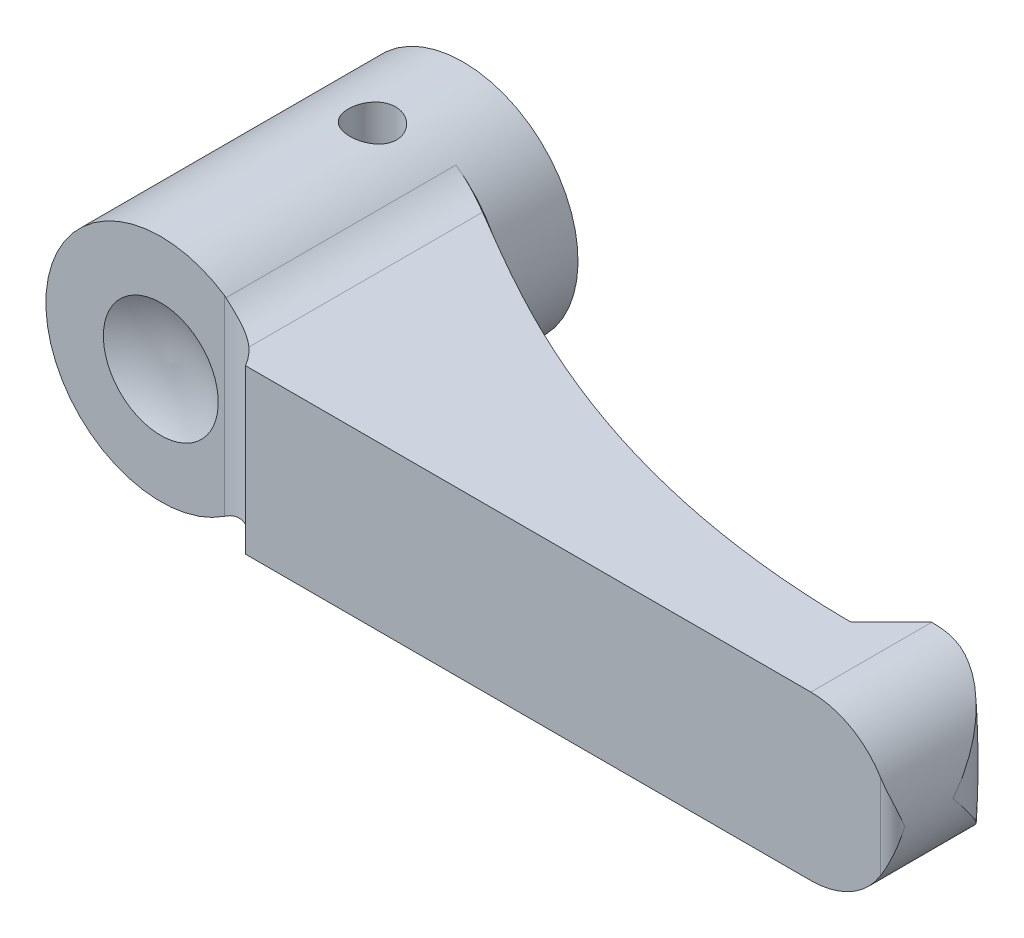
ISO-10303-21;
HEADER;
FILE_DESCRIPTION(('STEP AP214'),'2;1');
FILE_NAME('part.step','',(''),(''),'','','');
FILE_SCHEMA(('AUTOMOTIVE_DESIGN { 1 0 10303 214 1 1 1 1 }'));
ENDSEC;
DATA;
#1=APPLICATION_CONTEXT('core data for automotive mechanical design processes');
#2=APPLICATION_PROTOCOL_DEFINITION('international standard','automotive_design',2000,#1);
#3=PRODUCT_CONTEXT('',#1,'mechanical');
#4=PRODUCT('Part','Part','',(#3));
#5=PRODUCT_RELATED_PRODUCT_CATEGORY('part','',(#4));
#6=PRODUCT_DEFINITION_FORMATION('','',#4);
#7=PRODUCT_DEFINITION_CONTEXT('part definition',#1,'design');
#8=PRODUCT_DEFINITION('design','',#6,#7);
#9=PRODUCT_DEFINITION_SHAPE('','',#8);
#10=(LENGTH_UNIT() NAMED_UNIT(*) SI_UNIT(.MILLI.,.METRE.));
#11=(NAMED_UNIT(*) PLANE_ANGLE_UNIT() SI_UNIT($,.RADIAN.));
#12=(NAMED_UNIT(*) SI_UNIT($,.STERADIAN.) SOLID_ANGLE_UNIT());
#13=UNCERTAINTY_MEASURE_WITH_UNIT(LENGTH_MEASURE(1.E-05),#10,'distance_accuracy_value','');
#14=(GEOMETRIC_REPRESENTATION_CONTEXT(3) GLOBAL_UNCERTAINTY_ASSIGNED_CONTEXT((#13)) GLOBAL_UNIT_ASSIGNED_CONTEXT((#10,
#11,#12)) REPRESENTATION_CONTEXT('',''));
#15=CARTESIAN_POINT('',(0.,0.,0.));
#16=DIRECTION('',(0.,0.,1.));
#17=DIRECTION('',(1.,0.,0.));
#18=AXIS2_PLACEMENT_3D('',#15,#16,#17);
#19=CARTESIAN_POINT('',(56.25,0.,0.));
#20=DIRECTION('',(0.,0.,1.));
#21=DIRECTION('',(0.,-1.,0.));
#22=AXIS2_PLACEMENT_3D('',#19,#20,#21);
#23=CYLINDRICAL_SURFACE('',#22,6.75);
#24=CARTESIAN_POINT('',(63.0000000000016,0.,22.9999999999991));
#25=CARTESIAN_POINT('',(63.0000000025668,-0.00449405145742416,22.9963434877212));
#26=CARTESIAN_POINT('',(62.9999955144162,-0.00898821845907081,22.9926868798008));
#27=CARTESIAN_POINT('',(62.9990295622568,-0.492454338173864,22.5993222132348));
#28=CARTESIAN_POINT('',(62.9470606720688,-0.972658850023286,22.2086004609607));
#29=CARTESIAN_POINT('',(62.7913590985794,-1.68293621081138,21.6318928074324));
#30=CARTESIAN_POINT('',(62.7263122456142,-1.91844017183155,21.4408828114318));
#31=CARTESIAN_POINT('',(62.5695954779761,-2.38443626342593,21.063639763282));
#32=CARTESIAN_POINT('',(62.4779383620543,-2.61493074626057,20.8774044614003));
#33=CARTESIAN_POINT('',(62.2934553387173,-3.0123915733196,20.5572576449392));
#34=CARTESIAN_POINT('',(62.2065728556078,-3.1809188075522,20.421838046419));
#35=CARTESIAN_POINT('',(62.0170314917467,-3.51289184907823,20.1559922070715));
#36=CARTESIAN_POINT('',(61.9143726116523,-3.6763376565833,20.0255659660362));
#37=CARTESIAN_POINT('',(61.5824383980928,-4.15677568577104,19.6440366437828));
#38=CARTESIAN_POINT('',(61.3287574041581,-4.46485752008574,19.4018831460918));
#39=CARTESIAN_POINT('',(60.8284121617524,-4.96912949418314,19.0136337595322));
#40=CARTESIAN_POINT('',(60.5968353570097,-5.1736760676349,18.8588764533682));
#41=CARTESIAN_POINT('',(60.0965103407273,-5.55568025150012,18.5785040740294));
#42=CARTESIAN_POINT('',(59.8278138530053,-5.73317484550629,18.4528490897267));
#43=CARTESIAN_POINT('',(59.3159701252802,-6.01905814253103,18.2634976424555));
#44=CARTESIAN_POINT('',(59.0793963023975,-6.13412584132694,18.1923220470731));
#45=CARTESIAN_POINT('',(58.7110846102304,-6.28675625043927,18.1087014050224));
#46=CARTESIAN_POINT('',(58.5860152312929,-6.33432077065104,18.0846796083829));
#47=CARTESIAN_POINT('',(58.332033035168,-6.42227946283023,18.0451340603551));
#48=CARTESIAN_POINT('',(58.2031203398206,-6.46267386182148,18.0296100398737));
#49=CARTESIAN_POINT('',(57.9411238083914,-6.53615248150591,18.0077187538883));
#50=CARTESIAN_POINT('',(57.808012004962,-6.56916372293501,18.0014397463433));
#51=CARTESIAN_POINT('',(57.5399365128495,-6.6270171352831,17.9990012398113));
#52=CARTESIAN_POINT('',(57.4049731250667,-6.65186061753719,18.0028401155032));
#53=CARTESIAN_POINT('',(57.1348207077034,-6.69314748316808,18.0211370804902));
#54=CARTESIAN_POINT('',(56.9996330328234,-6.70961122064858,18.0355692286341));
#55=CARTESIAN_POINT('',(56.7301870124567,-6.73425513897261,18.0753366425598));
#56=CARTESIAN_POINT('',(56.595927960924,-6.74244251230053,18.1006624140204));
#57=CARTESIAN_POINT('',(56.4271627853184,-6.74776972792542,18.1397214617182));
#58=CARTESIAN_POINT('',(56.3915323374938,-6.74860980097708,18.1483819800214));
#59=CARTESIAN_POINT('',(56.320500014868,-6.74972499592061,18.1664807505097));
#60=CARTESIAN_POINT('',(56.2850979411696,-6.75000070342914,18.1759181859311));
#61=CARTESIAN_POINT('',(56.2498,-6.74999999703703,18.1857479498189));
#62=B_SPLINE_CURVE_WITH_KNOTS('',3,(#24,#25,#26,#27,#28,#29,#30,#31,#32,#33,#34,#35,#36,#37,#38,
#39,#40,#41,#42,#43,#44,#45,#46,#47,#48,#49,#50,#51,#52,#53,#54,#55,#56,#57,#58,#59,#60,#61),
.UNSPECIFIED.,.F.,.F.,(4,2,2,2,2,2,2,2,2,2,2,2,2,2,2,2,2,2,4),(0.,0.017381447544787,
1.86978767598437,2.79935621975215,3.72847840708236,4.4268540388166,5.12522964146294,
6.51797465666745,7.55125947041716,8.58311872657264,9.3972360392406,9.80464714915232,
10.2120453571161,10.6233081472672,11.0345048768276,11.4446979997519,11.8545343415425,
11.9645585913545,12.0744686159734),.UNSPECIFIED.);
#63=CARTESIAN_POINT('',(57.6255506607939,-6.60835534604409,18.));
#64=VERTEX_POINT('',#63);
#65=CARTESIAN_POINT('',(63.,0.,23.));
#66=VERTEX_POINT('',#65);
#67=EDGE_CURVE('E388',#64,#66,#62,.F.);
#68=ORIENTED_EDGE('',*,*,#67,.T.);
#69=CARTESIAN_POINT('',(63.0000000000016,0.,22.9999999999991));
#70=CARTESIAN_POINT('',(63.0000000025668,0.00449405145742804,22.9963434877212));
#71=CARTESIAN_POINT('',(62.9999955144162,0.00898821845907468,22.9926868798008));
#72=CARTESIAN_POINT('',(62.9990295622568,0.492454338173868,22.5993222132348));
#73=CARTESIAN_POINT('',(62.9470606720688,0.97265885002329,22.2086004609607));
#74=CARTESIAN_POINT('',(62.7913590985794,1.68293621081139,21.6318928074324));
#75=CARTESIAN_POINT('',(62.7263122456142,1.91844017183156,21.4408828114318));
#76=CARTESIAN_POINT('',(62.5695954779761,2.38443626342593,21.063639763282));
#77=CARTESIAN_POINT('',(62.4779383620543,2.61493074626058,20.8774044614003));
#78=CARTESIAN_POINT('',(62.2934553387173,3.01239157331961,20.5572576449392));
#79=CARTESIAN_POINT('',(62.2065728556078,3.1809188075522,20.421838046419));
#80=CARTESIAN_POINT('',(62.0170314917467,3.51289184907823,20.1559922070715));
#81=CARTESIAN_POINT('',(61.9143726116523,3.6763376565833,20.0255659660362));
#82=CARTESIAN_POINT('',(61.5824383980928,4.15677568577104,19.6440366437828));
#83=CARTESIAN_POINT('',(61.3287574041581,4.46485752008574,19.4018831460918));
#84=CARTESIAN_POINT('',(60.8284121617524,4.96912949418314,19.0136337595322));
#85=CARTESIAN_POINT('',(60.5968353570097,5.1736760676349,18.8588764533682));
#86=CARTESIAN_POINT('',(60.0965103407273,5.55568025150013,18.5785040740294));
#87=CARTESIAN_POINT('',(59.8278138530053,5.7331748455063,18.4528490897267));
#88=CARTESIAN_POINT('',(59.3159701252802,6.01905814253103,18.2634976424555));
#89=CARTESIAN_POINT('',(59.0793963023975,6.13412584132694,18.1923220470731));
#90=CARTESIAN_POINT('',(58.7110846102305,6.28675625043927,18.1087014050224));
#91=CARTESIAN_POINT('',(58.5860152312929,6.33432077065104,18.0846796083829));
#92=CARTESIAN_POINT('',(58.332033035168,6.42227946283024,18.0451340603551));
#93=CARTESIAN_POINT('',(58.2031203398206,6.46267386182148,18.0296100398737));
#94=CARTESIAN_POINT('',(57.9411238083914,6.53615248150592,18.0077187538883));
#95=CARTESIAN_POINT('',(57.808012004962,6.56916372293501,18.0014397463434));
#96=CARTESIAN_POINT('',(57.5399365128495,6.6270171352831,17.9990012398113));
#97=CARTESIAN_POINT('',(57.4049731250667,6.65186061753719,18.0028401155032));
#98=CARTESIAN_POINT('',(57.1348207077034,6.69314748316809,18.0211370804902));
#99=CARTESIAN_POINT('',(56.9996330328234,6.70961122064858,18.0355692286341));
#100=CARTESIAN_POINT('',(56.7301870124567,6.73425513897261,18.0753366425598));
#101=CARTESIAN_POINT('',(56.595927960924,6.74244251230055,18.1006624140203));
#102=CARTESIAN_POINT('',(56.4271627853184,6.74776972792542,18.1397214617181));
#103=CARTESIAN_POINT('',(56.3915323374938,6.74860980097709,18.1483819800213));
#104=CARTESIAN_POINT('',(56.320500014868,6.74972499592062,18.1664807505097));
#105=CARTESIAN_POINT('',(56.2850979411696,6.75000070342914,18.1759181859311));
#106=CARTESIAN_POINT('',(56.2498,6.74999999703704,18.1857479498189));
#107=B_SPLINE_CURVE_WITH_KNOTS('',3,(#69,#70,#71,#72,#73,#74,#75,#76,#77,#78,#79,#80,#81,#82,
#83,#84,#85,#86,#87,#88,#89,#90,#91,#92,#93,#94,#95,#96,#97,#98,#99,#100,#101,#102,#103,#104,
#105,#106),.UNSPECIFIED.,.F.,.F.,(4,2,2,2,2,2,2,2,2,2,2,2,2,2,2,2,2,2,4),(0.,0.017381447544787,
1.86978767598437,2.79935621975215,3.72847840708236,4.4268540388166,5.12522964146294,
6.51797465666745,7.55125947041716,8.58311872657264,9.39723603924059,9.80464714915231,
10.2120453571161,10.6233081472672,11.0345048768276,11.4446979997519,11.8545343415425,
11.9645585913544,12.0744686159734),.UNSPECIFIED.);
#108=CARTESIAN_POINT('',(57.6255506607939,6.60835534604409,18.));
#109=VERTEX_POINT('',#108);
#110=EDGE_CURVE('E164',#66,#109,#107,.T.);
#111=ORIENTED_EDGE('',*,*,#110,.T.);
#112=CARTESIAN_POINT('',(56.25,0.,18.));
#113=DIRECTION('',(0.,0.,-1.));
#114=DIRECTION('',(0.,1.,0.));
#115=AXIS2_PLACEMENT_3D('',#112,#113,#114);
#116=CIRCLE('',#115,6.75);
#117=CARTESIAN_POINT('',(56.25,6.75,18.));
#118=VERTEX_POINT('',#117);
#119=EDGE_CURVE('E368',#109,#118,#116,.F.);
#120=ORIENTED_EDGE('',*,*,#119,.T.);
#121=DIRECTION('',(0.,0.,1.));
#122=VECTOR('',#121,1.);
#123=CARTESIAN_POINT('',(56.25,6.75,0.));
#124=LINE('',#123,#122);
#125=CARTESIAN_POINT('',(56.25,6.75,28.));
#126=VERTEX_POINT('',#125);
#127=EDGE_CURVE('E335',#118,#126,#124,.T.);
#128=ORIENTED_EDGE('',*,*,#127,.T.);
#129=CARTESIAN_POINT('',(56.25,0.,28.));
#130=DIRECTION('',(0.,0.,1.));
#131=DIRECTION('',(0.,-1.,0.));
#132=AXIS2_PLACEMENT_3D('',#129,#130,#131);
#133=CIRCLE('',#132,6.75);
#134=CARTESIAN_POINT('',(62.,3.53553390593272,28.));
#135=VERTEX_POINT('',#134);
#136=EDGE_CURVE('E355',#135,#126,#133,.T.);
#137=ORIENTED_EDGE('',*,*,#136,.F.);
#138=CARTESIAN_POINT('',(62.,3.53553390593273,28.));
#139=CARTESIAN_POINT('',(62.0299932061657,3.48675666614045,27.9999933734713));
#140=CARTESIAN_POINT('',(62.0593538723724,3.4376127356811,27.9986515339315));
#141=CARTESIAN_POINT('',(62.1167538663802,3.3387069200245,27.9935798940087));
#142=CARTESIAN_POINT('',(62.144793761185,3.28894531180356,27.9898511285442));
#143=CARTESIAN_POINT('',(62.2267562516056,3.13908056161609,27.9755285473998));
#144=CARTESIAN_POINT('',(62.2786643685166,3.03816514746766,27.9617957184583));
#145=CARTESIAN_POINT('',(62.3766467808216,2.83536966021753,27.9277987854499));
#146=CARTESIAN_POINT('',(62.4227515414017,2.73349792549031,27.907570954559));
#147=CARTESIAN_POINT('',(62.5095025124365,2.52854152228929,27.8618646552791));
#148=CARTESIAN_POINT('',(62.5501444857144,2.42545597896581,27.8363821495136));
#149=CARTESIAN_POINT('',(62.6493297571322,2.15471359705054,27.7642737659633));
#150=CARTESIAN_POINT('',(62.7035065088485,1.98634279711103,27.7142841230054));
#151=CARTESIAN_POINT('',(62.7980553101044,1.64812969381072,27.6068184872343));
#152=CARTESIAN_POINT('',(62.8384218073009,1.47828682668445,27.5493394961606));
#153=CARTESIAN_POINT('',(62.9057483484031,1.13742664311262,27.4293690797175));
#154=CARTESIAN_POINT('',(62.9326868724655,0.966407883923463,27.3668697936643));
#155=CARTESIAN_POINT('',(62.9733111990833,0.623942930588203,27.239076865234));
#156=CARTESIAN_POINT('',(62.9870036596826,0.452496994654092,27.1737846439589));
#157=CARTESIAN_POINT('',(62.9978376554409,0.192449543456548,27.0740662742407));
#158=CARTESIAN_POINT('',(62.999781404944,0.103891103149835,27.0399873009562));
#159=CARTESIAN_POINT('',(62.9999941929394,0.0102233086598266,27.0039349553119));
#160=CARTESIAN_POINT('',(62.9999999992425,0.005111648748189,27.0019674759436));
#161=CARTESIAN_POINT('',(63.,0.,27.0000000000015));
#162=B_SPLINE_CURVE_WITH_KNOTS('',3,(#138,#139,#140,#141,#142,#143,#144,#145,#146,#147,#148,
#149,#150,#151,#152,#153,#154,#155,#156,#157,#158,#159,#160,#161),.UNSPECIFIED.,.F.,.F.,(4,2,2,
2,2,2,2,2,2,2,2,4),(0.,0.171732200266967,0.343389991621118,0.68589070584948,1.0265109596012,
1.36739390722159,1.91796289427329,2.46875297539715,3.02042294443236,3.57181547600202,
3.85648313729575,3.87291482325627),.UNSPECIFIED.);
#163=CARTESIAN_POINT('',(63.,0.,27.0000000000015));
#164=VERTEX_POINT('',#163);
#165=EDGE_CURVE('E174',#164,#135,#162,.F.);
#166=ORIENTED_EDGE('',*,*,#165,.F.);
#167=CARTESIAN_POINT('',(62.,-3.53553390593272,28.));
#168=CARTESIAN_POINT('',(62.0299932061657,-3.48675666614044,27.9999933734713));
#169=CARTESIAN_POINT('',(62.0593538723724,-3.4376127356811,27.9986515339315));
#170=CARTESIAN_POINT('',(62.1167538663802,-3.33870692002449,27.9935798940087));
#171=CARTESIAN_POINT('',(62.144793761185,-3.28894531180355,27.9898511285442));
#172=CARTESIAN_POINT('',(62.2267562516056,-3.13908056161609,27.9755285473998));
#173=CARTESIAN_POINT('',(62.2786643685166,-3.03816514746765,27.9617957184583));
#174=CARTESIAN_POINT('',(62.3766467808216,-2.83536966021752,27.9277987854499));
#175=CARTESIAN_POINT('',(62.4227515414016,-2.7334979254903,27.907570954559));
#176=CARTESIAN_POINT('',(62.5095025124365,-2.52854152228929,27.8618646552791));
#177=CARTESIAN_POINT('',(62.5501444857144,-2.4254559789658,27.8363821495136));
#178=CARTESIAN_POINT('',(62.6493297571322,-2.15471359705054,27.7642737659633));
#179=CARTESIAN_POINT('',(62.7035065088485,-1.98634279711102,27.7142841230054));
#180=CARTESIAN_POINT('',(62.7980553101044,-1.64812969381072,27.6068184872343));
#181=CARTESIAN_POINT('',(62.8384218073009,-1.47828682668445,27.5493394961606));
#182=CARTESIAN_POINT('',(62.9057483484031,-1.13742664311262,27.4293690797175));
#183=CARTESIAN_POINT('',(62.9326868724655,-0.96640788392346,27.3668697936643));
#184=CARTESIAN_POINT('',(62.9733111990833,-0.623942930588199,27.239076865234));
#185=CARTESIAN_POINT('',(62.9870036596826,-0.452496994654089,27.1737846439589));
#186=CARTESIAN_POINT('',(62.9978376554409,-0.192449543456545,27.0740662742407));
#187=CARTESIAN_POINT('',(62.999781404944,-0.103891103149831,27.0399873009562));
#188=CARTESIAN_POINT('',(62.9999941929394,-0.0102233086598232,27.0039349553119));
#189=CARTESIAN_POINT('',(62.9999999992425,-0.00511164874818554,27.0019674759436));
#190=CARTESIAN_POINT('',(63.,0.,27.0000000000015));
#191=B_SPLINE_CURVE_WITH_KNOTS('',3,(#167,#168,#169,#170,#171,#172,#173,#174,#175,#176,#177,
#178,#179,#180,#181,#182,#183,#184,#185,#186,#187,#188,#189,#190),.UNSPECIFIED.,.F.,.F.,(4,2,2,
2,2,2,2,2,2,2,2,4),(0.,0.171732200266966,0.343389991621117,0.685890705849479,1.0265109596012,
1.36739390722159,1.91796289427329,2.46875297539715,3.02042294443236,3.57181547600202,
3.85648313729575,3.87291482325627),.UNSPECIFIED.);
#192=CARTESIAN_POINT('',(62.,-3.53553390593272,28.));
#193=VERTEX_POINT('',#192);
#194=EDGE_CURVE('E9',#193,#164,#191,.T.);
#195=ORIENTED_EDGE('',*,*,#194,.F.);
#196=CARTESIAN_POINT('',(56.25,-6.75,28.));
#197=VERTEX_POINT('',#196);
#198=EDGE_CURVE('E356',#197,#193,#133,.T.);
#199=ORIENTED_EDGE('',*,*,#198,.F.);
#200=DIRECTION('',(0.,0.,1.));
#201=VECTOR('',#200,1.);
#202=CARTESIAN_POINT('',(56.25,-6.75,0.));
#203=LINE('',#202,#201);
#204=CARTESIAN_POINT('',(56.25,-6.75,18.));
#205=VERTEX_POINT('',#204);
#206=EDGE_CURVE('E341',#205,#197,#203,.T.);
#207=ORIENTED_EDGE('',*,*,#206,.F.);
#208=EDGE_CURVE('E28',#205,#64,#116,.F.);
#209=ORIENTED_EDGE('',*,*,#208,.T.);
#210=EDGE_LOOP('',(#68,#111,#120,#128,#137,#166,#195,#199,#207,#209));
#211=FACE_BOUND('',#210,.T.);
#212=ADVANCED_FACE('F14',(#211),#23,.T.);
#213=CARTESIAN_POINT('',(54.2774302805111,-13.5,-51.6539828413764));
#214=DIRECTION('',(0.,1.,0.));
#215=DIRECTION('',(-1.,0.,0.));
#216=AXIS2_PLACEMENT_3D('',#213,#214,#215);
#217=CYLINDRICAL_SURFACE('',#216,72.9999999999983);
#218=CARTESIAN_POINT('',(52.3128476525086,8.1002,21.3195768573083));
#219=CARTESIAN_POINT('',(52.4131897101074,7.42828656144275,21.3222651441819));
#220=CARTESIAN_POINT('',(52.5012129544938,6.75452314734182,21.324440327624));
#221=CARTESIAN_POINT('',(52.6523237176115,5.40419146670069,21.3279687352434));
#222=CARTESIAN_POINT('',(52.7154107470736,4.72762314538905,21.3293219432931));
#223=CARTESIAN_POINT('',(52.8160690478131,3.37633482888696,21.3314048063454));
#224=CARTESIAN_POINT('',(52.8537789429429,2.70162517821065,21.3321378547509));
#225=CARTESIAN_POINT('',(52.9040776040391,1.35127701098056,21.3331021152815));
#226=CARTESIAN_POINT('',(52.916666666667,0.675638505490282,21.333333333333));
#227=CARTESIAN_POINT('',(52.916666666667,-0.675638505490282,21.333333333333));
#228=CARTESIAN_POINT('',(52.9040776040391,-1.35127701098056,21.3331021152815));
#229=CARTESIAN_POINT('',(52.8537789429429,-2.70162517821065,21.3321378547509));
#230=CARTESIAN_POINT('',(52.8160690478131,-3.37633482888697,21.3314048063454));
#231=CARTESIAN_POINT('',(52.7154107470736,-4.72762314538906,21.3293219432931));
#232=CARTESIAN_POINT('',(52.6523237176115,-5.40419146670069,21.3279687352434));
#233=CARTESIAN_POINT('',(52.5012129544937,-6.75452314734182,21.324440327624));
#234=CARTESIAN_POINT('',(52.4131897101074,-7.42828656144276,21.3222651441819));
#235=CARTESIAN_POINT('',(52.3128476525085,-8.1002,21.3195768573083));
#236=B_SPLINE_CURVE_WITH_KNOTS('',3,(#218,#219,#220,#221,#222,#223,#224,#225,#226,#227,#228,
#229,#230,#231,#232,#233,#234,#235),.UNSPECIFIED.,.F.,.F.,(4,2,2,2,2,2,2,2,4),(0.,
2.03800787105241,4.07605572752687,6.10287826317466,8.12967686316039,10.1564754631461,
12.1832979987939,14.2213458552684,16.2593537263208),.UNSPECIFIED.);
#237=CARTESIAN_POINT('',(52.4975588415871,6.75,21.3243156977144));
#238=VERTEX_POINT('',#237);
#239=CARTESIAN_POINT('',(52.916666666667,0.,21.333333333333));
#240=VERTEX_POINT('',#239);
#241=EDGE_CURVE('E293',#238,#240,#236,.T.);
#242=ORIENTED_EDGE('',*,*,#241,.F.);
#243=CARTESIAN_POINT('',(54.2774302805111,6.75,-51.6539828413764));
#244=DIRECTION('',(0.,-1.,0.));
#245=DIRECTION('',(1.,0.,0.));
#246=AXIS2_PLACEMENT_3D('',#243,#244,#245);
#247=CIRCLE('',#246,72.9999999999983);
#248=CARTESIAN_POINT('',(52.916666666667,6.75,21.333333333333));
#249=VERTEX_POINT('',#248);
#250=EDGE_CURVE('E331',#238,#249,#247,.F.);
#251=ORIENTED_EDGE('',*,*,#250,.T.);
#252=DIRECTION('',(0.,1.,0.));
#253=VECTOR('',#252,1.);
#254=CARTESIAN_POINT('',(52.916666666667,-13.5,21.333333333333));
#255=LINE('',#254,#253);
#256=EDGE_CURVE('E254',#240,#249,#255,.T.);
#257=ORIENTED_EDGE('',*,*,#256,.F.);
#258=EDGE_LOOP('',(#242,#251,#257));
#259=FACE_BOUND('',#258,.T.);
#260=ADVANCED_FACE('F141',(#259),#217,.F.);
#261=CARTESIAN_POINT('',(58.,-13.5,18.));
#262=DIRECTION('',(0.,0.,-1.));
#263=DIRECTION('',(0.,1.,0.));
#264=AXIS2_PLACEMENT_3D('',#261,#262,#263);
#265=PLANE('',#264);
#266=ORIENTED_EDGE('',*,*,#119,.F.);
#267=CARTESIAN_POINT('',(-0.5,0.,18.));
#268=DIRECTION('',(0.,0.,-1.));
#269=DIRECTION('',(0.,1.,0.));
#270=AXIS2_PLACEMENT_3D('',#267,#268,#269);
#271=CIRCLE('',#270,58.5000000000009);
#272=EDGE_CURVE('E43',#109,#64,#271,.T.);
#273=ORIENTED_EDGE('',*,*,#272,.T.);
#274=ORIENTED_EDGE('',*,*,#208,.F.);
#275=DIRECTION('',(0.,1.,0.));
#276=VECTOR('',#275,1.);
#277=CARTESIAN_POINT('',(56.25,-13.5,18.));
#278=LINE('',#277,#276);
#279=EDGE_CURVE('E326',#205,#118,#278,.T.);
#280=ORIENTED_EDGE('',*,*,#279,.T.);
#281=EDGE_LOOP('',(#266,#273,#274,#280));
#282=FACE_BOUND('',#281,.T.);
#283=ADVANCED_FACE('F147',(#282),#265,.T.);
#284=CARTESIAN_POINT('',(9.,0.,0.));
#285=DIRECTION('',(0.,0.,1.));
#286=DIRECTION('',(0.,-1.,0.));
#287=AXIS2_PLACEMENT_3D('',#284,#285,#286);
#288=PLANE('',#287);
#289=CARTESIAN_POINT('',(0.,0.,0.));
#290=DIRECTION('',(0.,0.,-1.));
#291=DIRECTION('',(0.,1.,0.));
#292=AXIS2_PLACEMENT_3D('',#289,#290,#291);
#293=CIRCLE('',#292,4.);
#294=CARTESIAN_POINT('',(0.,4.,0.));
#295=VERTEX_POINT('',#294);
#296=EDGE_CURVE('E577',#295,#295,#293,.T.);
#297=ORIENTED_EDGE('',*,*,#296,.F.);
#298=EDGE_LOOP('',(#297));
#299=FACE_BOUND('',#298,.T.);
#300=CARTESIAN_POINT('',(-0.5,0.,0.));
#301=DIRECTION('',(0.,0.,-1.));
#302=DIRECTION('',(0.,1.,0.));
#303=AXIS2_PLACEMENT_3D('',#300,#301,#302);
#304=CIRCLE('',#303,9.5);
#305=CARTESIAN_POINT('',(-0.5,9.5,0.));
#306=VERTEX_POINT('',#305);
#307=EDGE_CURVE('E350',#306,#306,#304,.T.);
#308=ORIENTED_EDGE('',*,*,#307,.T.);
#309=EDGE_LOOP('',(#308));
#310=FACE_BOUND('',#309,.T.);
#311=ADVANCED_FACE('F449',(#299,#310),#288,.F.);
#312=CARTESIAN_POINT('',(0.,0.,28.));
#313=DIRECTION('',(0.,0.,1.));
#314=DIRECTION('',(0.,-1.,0.));
#315=AXIS2_PLACEMENT_3D('',#312,#313,#314);
#316=PLANE('',#315);
#317=DIRECTION('',(1.,0.,0.));
#318=VECTOR('',#317,1.);
#319=CARTESIAN_POINT('',(8.3140512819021,6.75,28.));
#320=LINE('',#319,#318);
#321=CARTESIAN_POINT('',(9.5,6.75,28.));
#322=VERTEX_POINT('',#321);
#323=EDGE_CURVE('E330',#322,#126,#320,.T.);
#324=ORIENTED_EDGE('',*,*,#323,.F.);
#325=DIRECTION('',(0.,1.,0.));
#326=VECTOR('',#325,1.);
#327=CARTESIAN_POINT('',(9.5,-13.5,28.));
#328=LINE('',#327,#326);
#329=CARTESIAN_POINT('',(9.5,-6.75,28.));
#330=VERTEX_POINT('',#329);
#331=EDGE_CURVE('E394',#330,#322,#328,.T.);
#332=ORIENTED_EDGE('',*,*,#331,.F.);
#333=DIRECTION('',(-1.,0.,0.));
#334=VECTOR('',#333,1.);
#335=CARTESIAN_POINT('',(56.25,-6.75,28.));
#336=LINE('',#335,#334);
#337=EDGE_CURVE('E416',#197,#330,#336,.T.);
#338=ORIENTED_EDGE('',*,*,#337,.F.);
#339=ORIENTED_EDGE('',*,*,#198,.T.);
#340=DIRECTION('',(0.,1.,0.));
#341=VECTOR('',#340,1.);
#342=CARTESIAN_POINT('',(62.,-13.5,28.));
#343=LINE('',#342,#341);
#344=EDGE_CURVE('E365',#193,#135,#343,.T.);
#345=ORIENTED_EDGE('',*,*,#344,.T.);
#346=ORIENTED_EDGE('',*,*,#136,.T.);
#347=EDGE_LOOP('',(#324,#332,#338,#339,#345,#346));
#348=FACE_BOUND('',#347,.T.);
#349=ADVANCED_FACE('F241',(#348),#316,.T.);
#350=CARTESIAN_POINT('',(-0.5,0.,0.));
#351=DIRECTION('',(0.,0.,-1.));
#352=DIRECTION('',(0.,1.,0.));
#353=AXIS2_PLACEMENT_3D('',#350,#351,#352);
#354=CYLINDRICAL_SURFACE('',#353,9.5);
#355=CARTESIAN_POINT('',(-0.5,9.5,9.93649167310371));
#356=CARTESIAN_POINT('',(-0.608068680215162,9.49999836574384,9.90858436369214));
#357=CARTESIAN_POINT('',(-0.713844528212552,9.49813861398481,9.8715952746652));
#358=CARTESIAN_POINT('',(-0.917722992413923,9.49136170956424,9.78052567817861));
#359=CARTESIAN_POINT('',(-1.01581904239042,9.48644197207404,9.7264307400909));
#360=CARTESIAN_POINT('',(-1.20145489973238,9.47452435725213,9.60278782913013));
#361=CARTESIAN_POINT('',(-1.28900463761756,9.46752845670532,9.53325457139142));
#362=CARTESIAN_POINT('',(-1.451270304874,9.45260481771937,9.38065916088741));
#363=CARTESIAN_POINT('',(-1.52598751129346,9.44467717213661,9.29759835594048));
#364=CARTESIAN_POINT('',(-1.66127658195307,9.42900494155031,9.11928990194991));
#365=CARTESIAN_POINT('',(-1.7216966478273,9.42126304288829,9.02392676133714));
#366=CARTESIAN_POINT('',(-1.82569433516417,9.40719412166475,8.82432030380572));
#367=CARTESIAN_POINT('',(-1.86927203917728,9.40086709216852,8.72007703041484));
#368=CARTESIAN_POINT('',(-1.93825948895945,9.3905609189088,8.50577111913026));
#369=CARTESIAN_POINT('',(-1.9636920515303,9.38657882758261,8.39571597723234));
#370=CARTESIAN_POINT('',(-1.99569562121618,9.38153308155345,8.17283415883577));
#371=CARTESIAN_POINT('',(-2.00226811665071,9.38046919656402,8.06000770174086));
#372=CARTESIAN_POINT('',(-1.99638415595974,9.38140929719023,7.83615773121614));
#373=CARTESIAN_POINT('',(-1.98414367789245,9.38337846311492,7.72512832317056));
#374=CARTESIAN_POINT('',(-1.94140778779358,9.39003754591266,7.50672736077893));
#375=CARTESIAN_POINT('',(-1.91091210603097,9.39472750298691,7.39935586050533));
#376=CARTESIAN_POINT('',(-1.8325398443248,9.4061626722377,7.19118768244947));
#377=CARTESIAN_POINT('',(-1.78465026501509,9.41290942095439,7.09039598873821));
#378=CARTESIAN_POINT('',(-1.67284924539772,9.42749121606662,6.89821217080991));
#379=CARTESIAN_POINT('',(-1.60893645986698,9.43532635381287,6.80682083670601));
#380=CARTESIAN_POINT('',(-1.46600955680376,9.45103378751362,6.63491635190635));
#381=CARTESIAN_POINT('',(-1.38682989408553,9.4589054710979,6.55454070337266));
#382=CARTESIAN_POINT('',(-1.21603046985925,9.47336429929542,6.40817137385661));
#383=CARTESIAN_POINT('',(-1.12441072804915,9.47995144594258,6.34217767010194));
#384=CARTESIAN_POINT('',(-0.931287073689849,9.49069699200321,6.22648052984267));
#385=CARTESIAN_POINT('',(-0.829784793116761,9.49485579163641,6.17677440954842));
#386=CARTESIAN_POINT('',(-0.619796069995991,9.49982443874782,6.09512750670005));
#387=CARTESIAN_POINT('',(-0.511310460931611,9.50063468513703,6.0631846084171));
#388=CARTESIAN_POINT('',(-0.292244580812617,9.49834982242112,6.01835877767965));
#389=CARTESIAN_POINT('',(-0.181721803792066,9.49531431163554,6.00519153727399));
#390=CARTESIAN_POINT('',(0.0397945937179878,9.48529977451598,5.99732717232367));
#391=CARTESIAN_POINT('',(0.150788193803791,9.4783209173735,6.00262925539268));
#392=CARTESIAN_POINT('',(0.369434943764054,9.46076358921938,6.03134398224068));
#393=CARTESIAN_POINT('',(0.477103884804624,9.45020650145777,6.0546500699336));
#394=CARTESIAN_POINT('',(0.68687413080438,9.42615965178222,6.1184510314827));
#395=CARTESIAN_POINT('',(0.788974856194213,9.41266958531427,6.15894769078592));
#396=CARTESIAN_POINT('',(0.986718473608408,9.38348773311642,6.25679269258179));
#397=CARTESIAN_POINT('',(1.08221405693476,9.3677610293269,6.31442817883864));
#398=CARTESIAN_POINT('',(1.26225545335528,9.33556818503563,6.44466720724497));
#399=CARTESIAN_POINT('',(1.34679954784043,9.3191019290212,6.51727309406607));
#400=CARTESIAN_POINT('',(1.504375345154,9.28650086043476,6.67723105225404));
#401=CARTESIAN_POINT('',(1.57713056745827,9.27038009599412,6.76485877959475));
#402=CARTESIAN_POINT('',(1.70687962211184,9.24035345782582,6.9514431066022));
#403=CARTESIAN_POINT('',(1.7638740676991,9.22644749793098,7.05039926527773));
#404=CARTESIAN_POINT('',(1.85996002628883,9.20233863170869,7.25613467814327));
#405=CARTESIAN_POINT('',(1.89918754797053,9.19210772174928,7.36284698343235));
#406=CARTESIAN_POINT('',(1.95904958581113,9.17627631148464,7.58168808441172));
#407=CARTESIAN_POINT('',(1.97968860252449,9.17067469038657,7.69381556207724));
#408=CARTESIAN_POINT('',(2.00128740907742,9.16480670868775,7.91651456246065));
#409=CARTESIAN_POINT('',(2.00284609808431,9.16437798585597,8.02702399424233));
#410=CARTESIAN_POINT('',(1.98777765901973,9.16847979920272,8.24669489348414));
#411=CARTESIAN_POINT('',(1.97115183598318,9.17300997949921,8.35585645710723));
#412=CARTESIAN_POINT('',(1.9206225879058,9.18647104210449,8.56831545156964));
#413=CARTESIAN_POINT('',(1.88694356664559,9.19534471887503,8.67167014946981));
#414=CARTESIAN_POINT('',(1.80349360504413,9.21660246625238,8.87127297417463));
#415=CARTESIAN_POINT('',(1.75372064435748,9.22898697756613,8.9675202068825));
#416=CARTESIAN_POINT('',(1.6381737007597,9.2564468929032,9.15263523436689));
#417=CARTESIAN_POINT('',(1.57205348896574,9.27157833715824,9.24127846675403));
#418=CARTESIAN_POINT('',(1.42625736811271,9.30296096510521,9.40638692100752));
#419=CARTESIAN_POINT('',(1.34657938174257,9.31921232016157,9.48285027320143));
#420=CARTESIAN_POINT('',(1.17331402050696,9.35189786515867,9.62361822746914));
#421=CARTESIAN_POINT('',(1.07940026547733,9.36832448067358,9.68752350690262));
#422=CARTESIAN_POINT('',(0.881885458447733,9.39948804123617,9.7986432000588));
#423=CARTESIAN_POINT('',(0.778283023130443,9.41422474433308,9.84585522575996));
#424=CARTESIAN_POINT('',(0.5644080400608,9.44079577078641,9.92205941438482));
#425=CARTESIAN_POINT('',(0.454146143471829,9.45263458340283,9.95107986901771));
#426=CARTESIAN_POINT('',(0.230030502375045,9.47257477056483,9.98997358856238));
#427=CARTESIAN_POINT('',(0.116180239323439,9.48067965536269,9.99986486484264));
#428=CARTESIAN_POINT('',(-0.0822799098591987,9.4911913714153,10.0000980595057));
#429=CARTESIAN_POINT('',(-0.166861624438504,9.49452849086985,9.99482230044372));
#430=CARTESIAN_POINT('',(-0.334735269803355,9.49893339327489,9.97360315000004));
#431=CARTESIAN_POINT('',(-0.418027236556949,9.50000123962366,9.95766005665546));
#432=CARTESIAN_POINT('',(-0.5,9.5,9.93649167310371));
#433=B_SPLINE_CURVE_WITH_KNOTS('',3,(#355,#356,#357,#358,#359,#360,#361,#362,#363,#364,#365,
#366,#367,#368,#369,#370,#371,#372,#373,#374,#375,#376,#377,#378,#379,#380,#381,#382,#383,#384,
#385,#386,#387,#388,#389,#390,#391,#392,#393,#394,#395,#396,#397,#398,#399,#400,#401,#402,#403,
#404,#405,#406,#407,#408,#409,#410,#411,#412,#413,#414,#415,#416,#417,#418,#419,#420,#421,#422,
#423,#424,#425,#426,#427,#428,#429,#430,#431,#432),.UNSPECIFIED.,.T.,.F.,(4,2,2,2,2,2,2,2,2,2,2,
2,2,2,2,2,2,2,2,2,2,2,2,2,2,2,2,2,2,2,2,2,2,2,2,2,2,2,4),(0.,0.334530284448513,
0.669343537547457,1.00383902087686,1.33830119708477,1.67616938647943,2.01403591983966,
2.35147684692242,2.68889114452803,3.02246066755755,3.35603511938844,3.68985938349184,
4.023711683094,4.36141142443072,4.69911063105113,5.03675416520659,5.374357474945,
5.70679231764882,6.03921289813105,6.36968099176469,6.70018341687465,7.03656910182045,
7.3730075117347,7.71645381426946,8.0598867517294,8.40064427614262,8.7413192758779,
9.07127260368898,9.40120225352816,9.72689899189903,10.0526366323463,10.3859741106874,
10.7193627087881,11.0620644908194,11.404815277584,11.747031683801,12.0889257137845,
12.342682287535,12.596431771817),.UNSPECIFIED.);
#434=CARTESIAN_POINT('',(-0.5,9.5,9.93649167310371));
#435=VERTEX_POINT('',#434);
#436=EDGE_CURVE('E584',#435,#435,#433,.T.);
#437=ORIENTED_EDGE('',*,*,#436,.T.);
#438=EDGE_LOOP('',(#437));
#439=FACE_BOUND('',#438,.T.);
#440=CARTESIAN_POINT('',(-0.5,0.,6.));
#441=DIRECTION('',(0.,0.,-1.));
#442=DIRECTION('',(0.,1.,0.));
#443=AXIS2_PLACEMENT_3D('',#440,#441,#442);
#444=CIRCLE('',#443,9.5);
#445=CARTESIAN_POINT('',(4.9021604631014,7.81451612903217,6.));
#446=VERTEX_POINT('',#445);
#447=CARTESIAN_POINT('',(4.90216046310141,-7.81451612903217,6.));
#448=VERTEX_POINT('',#447);
#449=EDGE_CURVE('E381',#446,#448,#444,.T.);
#450=ORIENTED_EDGE('',*,*,#449,.T.);
#451=DIRECTION('',(0.,0.,1.));
#452=VECTOR('',#451,1.);
#453=CARTESIAN_POINT('',(4.9021604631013,-7.8145161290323,0.));
#454=LINE('',#453,#452);
#455=CARTESIAN_POINT('',(4.9021604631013,-7.8145161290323,25.0135516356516));
#456=VERTEX_POINT('',#455);
#457=EDGE_CURVE('E419',#448,#456,#454,.T.);
#458=ORIENTED_EDGE('',*,*,#457,.T.);
#459=CARTESIAN_POINT('',(4.75,-7.91754381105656,25.));
#460=CARTESIAN_POINT('',(4.77554501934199,-7.90060503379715,25.0019496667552));
#461=CARTESIAN_POINT('',(4.80099756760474,-7.88355000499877,25.0040538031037));
#462=CARTESIAN_POINT('',(4.85171772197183,-7.84920744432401,25.0085710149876));
#463=CARTESIAN_POINT('',(4.87698532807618,-7.83191991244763,25.0109840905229));
#464=CARTESIAN_POINT('',(4.90216046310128,-7.81451612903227,25.0135516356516));
#465=B_SPLINE_CURVE_WITH_KNOTS('',3,(#459,#460,#461,#462,#463,#464),.UNSPECIFIED.,.F.,.F.,(4,2,
4),(0.,0.0921314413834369,0.184262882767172),.UNSPECIFIED.);
#466=CARTESIAN_POINT('',(4.75,-7.91754381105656,25.));
#467=VERTEX_POINT('',#466);
#468=EDGE_CURVE('E214',#467,#456,#465,.T.);
#469=ORIENTED_EDGE('',*,*,#468,.F.);
#470=CARTESIAN_POINT('',(-0.5,0.,25.));
#471=DIRECTION('',(0.,0.,-1.));
#472=DIRECTION('',(0.,1.,0.));
#473=AXIS2_PLACEMENT_3D('',#470,#471,#472);
#474=CIRCLE('',#473,9.5);
#475=CARTESIAN_POINT('',(4.75,7.91754381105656,25.));
#476=VERTEX_POINT('',#475);
#477=EDGE_CURVE('E353',#467,#476,#474,.T.);
#478=ORIENTED_EDGE('',*,*,#477,.T.);
#479=CARTESIAN_POINT('',(4.90216046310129,7.81451612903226,25.0135516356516));
#480=CARTESIAN_POINT('',(4.87698532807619,7.83191991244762,25.0109840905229));
#481=CARTESIAN_POINT('',(4.85171772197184,7.849207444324,25.0085710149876));
#482=CARTESIAN_POINT('',(4.80099756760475,7.88355000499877,25.0040538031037));
#483=CARTESIAN_POINT('',(4.77554501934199,7.90060503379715,25.0019496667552));
#484=CARTESIAN_POINT('',(4.75,7.91754381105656,25.));
#485=B_SPLINE_CURVE_WITH_KNOTS('',3,(#479,#480,#481,#482,#483,#484),.UNSPECIFIED.,.F.,.F.,(4,2,
4),(0.,0.0921314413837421,0.184262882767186),.UNSPECIFIED.);
#486=CARTESIAN_POINT('',(4.9021604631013,7.8145161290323,25.0135516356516));
#487=VERTEX_POINT('',#486);
#488=EDGE_CURVE('E228',#487,#476,#485,.T.);
#489=ORIENTED_EDGE('',*,*,#488,.F.);
#490=DIRECTION('',(0.,0.,1.));
#491=VECTOR('',#490,1.);
#492=CARTESIAN_POINT('',(4.9021604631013,7.8145161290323,0.));
#493=LINE('',#492,#491);
#494=EDGE_CURVE('E343',#446,#487,#493,.T.);
#495=ORIENTED_EDGE('',*,*,#494,.F.);
#496=EDGE_LOOP('',(#450,#458,#469,#478,#489,#495));
#497=FACE_BOUND('',#496,.T.);
#498=ORIENTED_EDGE('',*,*,#307,.F.);
#499=EDGE_LOOP('',(#498));
#500=FACE_BOUND('',#499,.T.);
#501=ADVANCED_FACE('F239',(#439,#497,#500),#354,.T.);
#502=CARTESIAN_POINT('',(8.31405128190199,12.7499999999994,0.));
#503=DIRECTION('',(0.,0.,1.));
#504=DIRECTION('',(0.,-1.,0.));
#505=AXIS2_PLACEMENT_3D('',#502,#503,#504);
#506=CYLINDRICAL_SURFACE('',#505,5.99999999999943);
#507=DIRECTION('',(0.,0.,1.));
#508=VECTOR('',#507,1.);
#509=CARTESIAN_POINT('',(8.31405128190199,6.75,0.));
#510=LINE('',#509,#508);
#511=CARTESIAN_POINT('',(8.31405128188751,6.75,7.20869247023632));
#512=VERTEX_POINT('',#511);
#513=CARTESIAN_POINT('',(8.31405128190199,6.75,26.5286412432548));
#514=VERTEX_POINT('',#513);
#515=EDGE_CURVE('E340',#512,#514,#510,.T.);
#516=ORIENTED_EDGE('',*,*,#515,.F.);
#517=CARTESIAN_POINT('',(8.314251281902,6.75000000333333,7.20880889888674));
#518=CARTESIAN_POINT('',(8.1854499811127,6.75000978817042,7.13385649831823));
#519=CARTESIAN_POINT('',(8.05574357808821,6.75414053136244,7.06036717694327));
#520=CARTESIAN_POINT('',(7.79450788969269,6.77109651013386,6.91724572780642));
#521=CARTESIAN_POINT('',(7.66297592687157,6.78393622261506,6.84762023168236));
#522=CARTESIAN_POINT('',(7.39667564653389,6.81900682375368,6.71248492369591));
#523=CARTESIAN_POINT('',(7.26188773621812,6.84136531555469,6.64704546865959));
#524=CARTESIAN_POINT('',(6.99139798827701,6.89597151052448,6.52280692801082));
#525=CARTESIAN_POINT('',(6.85569680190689,6.9282127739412,6.46400355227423));
#526=CARTESIAN_POINT('',(6.50422295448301,7.02511420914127,6.32258928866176));
#527=CARTESIAN_POINT('',(6.28795071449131,7.09771225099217,6.24611887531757));
#528=CARTESIAN_POINT('',(5.96665490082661,7.22704821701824,6.15260738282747));
#529=CARTESIAN_POINT('',(5.86039071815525,7.27339654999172,6.12502082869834));
#530=CARTESIAN_POINT('',(5.6493587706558,7.37291919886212,6.0775890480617));
#531=CARTESIAN_POINT('',(5.54459023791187,7.42608986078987,6.05773970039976));
#532=CARTESIAN_POINT('',(5.34902156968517,7.53276252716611,6.02824703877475));
#533=CARTESIAN_POINT('',(5.25797135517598,7.58556023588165,6.01770953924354));
#534=CARTESIAN_POINT('',(5.07806250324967,7.69632487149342,6.00355247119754));
#535=CARTESIAN_POINT('',(4.98921299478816,7.75430982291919,5.99995808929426));
#536=CARTESIAN_POINT('',(4.9019604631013,7.81465439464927,6.00000000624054));
#537=B_SPLINE_CURVE_WITH_KNOTS('',3,(#517,#518,#519,#520,#521,#522,#523,#524,#525,#526,#527,
#528,#529,#530,#531,#532,#533,#534,#535,#536),.UNSPECIFIED.,.F.,.F.,(4,2,2,2,2,2,2,2,2,4),(0.,
0.447065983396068,0.894876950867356,1.34889001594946,1.80260786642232,2.52118384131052,
2.87832524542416,3.23527616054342,3.55224237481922,3.8703562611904),.UNSPECIFIED.);
#538=EDGE_CURVE('E245',#512,#446,#537,.T.);
#539=ORIENTED_EDGE('',*,*,#538,.T.);
#540=ORIENTED_EDGE('',*,*,#494,.T.);
#541=CARTESIAN_POINT('',(8.31405128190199,6.75,26.5286412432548));
#542=CARTESIAN_POINT('',(8.21611424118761,6.7499905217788,26.4402150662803));
#543=CARTESIAN_POINT('',(8.11520843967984,6.75239786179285,26.3550277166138));
#544=CARTESIAN_POINT('',(7.90813078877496,6.76285094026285,26.1915611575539));
#545=CARTESIAN_POINT('',(7.80195572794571,6.77090015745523,26.1132862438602));
#546=CARTESIAN_POINT('',(7.58511460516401,6.79344573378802,25.9641722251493));
#547=CARTESIAN_POINT('',(7.47444775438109,6.80794322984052,25.8933344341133));
#548=CARTESIAN_POINT('',(7.24959934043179,6.84407918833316,25.759541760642));
#549=CARTESIAN_POINT('',(7.13541864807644,6.86571589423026,25.6965849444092));
#550=CARTESIAN_POINT('',(6.90402450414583,6.9168252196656,25.5785641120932));
#551=CARTESIAN_POINT('',(6.78679909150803,6.94633508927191,25.5235395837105));
#552=CARTESIAN_POINT('',(6.55105235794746,7.01355019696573,25.4219202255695));
#553=CARTESIAN_POINT('',(6.43253108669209,7.05125512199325,25.3753250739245));
#554=CARTESIAN_POINT('',(6.19565405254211,7.13500718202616,25.2906262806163));
#555=CARTESIAN_POINT('',(6.07729835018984,7.18104004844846,25.2525083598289));
#556=CARTESIAN_POINT('',(5.84185117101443,7.28148917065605,25.1844689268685));
#557=CARTESIAN_POINT('',(5.72475926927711,7.33590250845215,25.1545445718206));
#558=CARTESIAN_POINT('',(5.48760207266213,7.45569981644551,25.1012746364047));
#559=CARTESIAN_POINT('',(5.36765221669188,7.52147665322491,25.0783002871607));
#560=CARTESIAN_POINT('',(5.13167917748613,7.66163603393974,25.0402111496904));
#561=CARTESIAN_POINT('',(5.01565387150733,7.73601382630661,25.0250920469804));
#562=CARTESIAN_POINT('',(4.9021604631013,7.8145161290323,25.0135516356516));
#563=B_SPLINE_CURVE_WITH_KNOTS('',3,(#541,#542,#543,#544,#545,#546,#547,#548,#549,#550,#551,
#552,#553,#554,#555,#556,#557,#558,#559,#560,#561,#562),.UNSPECIFIED.,.F.,.F.,(4,2,2,2,2,2,2,2,
2,2,4),(0.,0.395806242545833,0.791856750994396,1.18797711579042,1.58400009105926,
1.9819310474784,2.37984680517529,2.77708714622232,3.17418948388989,3.58978312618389,
4.00514826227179),.UNSPECIFIED.);
#564=EDGE_CURVE('E222',#514,#487,#563,.T.);
#565=ORIENTED_EDGE('',*,*,#564,.F.);
#566=EDGE_LOOP('',(#516,#539,#540,#565));
#567=FACE_BOUND('',#566,.T.);
#568=ADVANCED_FACE('F235',(#567),#506,.F.);
#569=CARTESIAN_POINT('',(8.3140512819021,6.75,0.));
#570=DIRECTION('',(0.,-1.,0.));
#571=DIRECTION('',(1.,0.,0.));
#572=AXIS2_PLACEMENT_3D('',#569,#570,#571);
#573=PLANE('',#572);
#574=ORIENTED_EDGE('',*,*,#250,.F.);
#575=CARTESIAN_POINT('',(96.3067744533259,6.75,-22.2918161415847));
#576=CARTESIAN_POINT('',(94.4705537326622,6.75,-20.4600445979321));
#577=CARTESIAN_POINT('',(92.6342092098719,6.75,-18.6283971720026));
#578=CARTESIAN_POINT('',(88.9612185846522,6.75,-14.9654046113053));
#579=CARTESIAN_POINT('',(87.1245724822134,6.75,-13.134059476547));
#580=CARTESIAN_POINT('',(81.6142633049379,6.75,-7.640720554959));
#581=CARTESIAN_POINT('',(77.9400671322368,6.75,-3.97926139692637));
#582=CARTESIAN_POINT('',(72.4273815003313,6.75,1.51108576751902));
#583=CARTESIAN_POINT('',(70.5896989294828,6.75,3.34078393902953));
#584=CARTESIAN_POINT('',(66.91365377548,6.75,6.99949232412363));
#585=CARTESIAN_POINT('',(65.0752911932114,6.75,8.82850253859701));
#586=CARTESIAN_POINT('',(61.3976192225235,6.75,12.4857225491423));
#587=CARTESIAN_POINT('',(59.5583097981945,6.75,14.3139323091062));
#588=CARTESIAN_POINT('',(55.8785433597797,6.75,17.9692140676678));
#589=CARTESIAN_POINT('',(54.038086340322,6.75,19.7962860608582));
#590=CARTESIAN_POINT('',(50.3551831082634,6.75,23.4493434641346));
#591=CARTESIAN_POINT('',(48.5127365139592,6.75,25.2753284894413));
#592=CARTESIAN_POINT('',(44.82576065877,6.75,28.9251329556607));
#593=CARTESIAN_POINT('',(42.9812314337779,6.75,30.7489524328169));
#594=CARTESIAN_POINT('',(40.2122564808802,6.75,33.482231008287));
#595=CARTESIAN_POINT('',(39.2889616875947,6.75,34.3928560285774));
#596=CARTESIAN_POINT('',(37.4414264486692,6.75,36.2131439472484));
#597=CARTESIAN_POINT('',(36.5171860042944,6.75,37.1228068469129));
#598=CARTESIAN_POINT('',(34.6674768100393,6.75,38.9409926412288));
#599=CARTESIAN_POINT('',(33.7420079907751,6.75,39.8495154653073));
#600=CARTESIAN_POINT('',(31.8895828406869,6.75,41.6650530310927));
#601=CARTESIAN_POINT('',(30.9626265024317,6.75,42.5720677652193));
#602=CARTESIAN_POINT('',(29.1063801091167,6.75,44.3845587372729));
#603=CARTESIAN_POINT('',(28.1770891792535,6.75,45.2900340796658));
#604=CARTESIAN_POINT('',(26.3160049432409,6.75,47.0983778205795));
#605=CARTESIAN_POINT('',(25.384211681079,6.75,48.0012462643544));
#606=CARTESIAN_POINT('',(23.5174085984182,6.75,49.8032828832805));
#607=CARTESIAN_POINT('',(22.5823994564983,6.75,50.7024517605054));
#608=CARTESIAN_POINT('',(21.1762636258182,6.75,52.0474800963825));
#609=CARTESIAN_POINT('',(20.7069325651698,6.75,52.4952166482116));
#610=CARTESIAN_POINT('',(19.7668205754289,6.75,53.3891645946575));
#611=CARTESIAN_POINT('',(19.2960396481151,6.75,53.8353759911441));
#612=CARTESIAN_POINT('',(18.3523770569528,6.75,54.7262543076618));
#613=CARTESIAN_POINT('',(17.879494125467,6.75,55.1709198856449));
#614=CARTESIAN_POINT('',(16.9315570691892,6.75,56.0579240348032));
#615=CARTESIAN_POINT('',(16.456502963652,6.75,56.5002626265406));
#616=CARTESIAN_POINT('',(15.5037603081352,6.75,57.3819194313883));
#617=CARTESIAN_POINT('',(15.0260722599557,6.75,57.821238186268));
#618=CARTESIAN_POINT('',(14.0672157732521,6.75,58.6960999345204));
#619=CARTESIAN_POINT('',(13.5860472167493,6.75,59.1316427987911));
#620=CARTESIAN_POINT('',(12.6188196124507,6.75,59.9980628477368));
#621=CARTESIAN_POINT('',(12.1327569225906,6.75,60.4289359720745));
#622=CARTESIAN_POINT('',(11.1546965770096,6.75,61.2838295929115));
#623=CARTESIAN_POINT('',(10.6626994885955,6.75,61.7078507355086));
#624=CARTESIAN_POINT('',(9.91841065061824,6.75,62.3367682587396));
#625=CARTESIAN_POINT('',(9.66918230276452,6.75,62.5452893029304));
#626=CARTESIAN_POINT('',(9.16829862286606,6.75,62.959385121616));
#627=CARTESIAN_POINT('',(8.91664336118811,6.75,63.1649599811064));
#628=CARTESIAN_POINT('',(8.41035979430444,6.75,63.572591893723));
#629=CARTESIAN_POINT('',(8.15573056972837,6.75,63.7746478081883));
#630=CARTESIAN_POINT('',(7.77117286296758,6.75,64.0744033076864));
#631=CARTESIAN_POINT('',(7.64254472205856,6.75,64.173772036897));
#632=CARTESIAN_POINT('',(7.38432894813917,6.75,64.3712600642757));
#633=CARTESIAN_POINT('',(7.25474129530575,6.75,64.4693793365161));
#634=CARTESIAN_POINT('',(7.12463036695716,6.75,64.5668036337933));
#635=B_SPLINE_CURVE_WITH_KNOTS('',3,(#575,#576,#577,#578,#579,#580,#581,#582,#583,#584,#585,
#586,#587,#588,#589,#590,#591,#592,#593,#594,#595,#596,#597,#598,#599,#600,#601,#602,#603,#604,
#605,#606,#607,#608,#609,#610,#611,#612,#613,#614,#615,#616,#617,#618,#619,#620,#621,#622,#623,
#624,#625,#626,#627,#628,#629,#630,#631,#632,#633,#634),.UNSPECIFIED.,.F.,.F.,(4,2,2,2,2,2,2,2,
2,2,2,2,2,2,2,2,2,2,2,2,2,2,2,2,2,2,2,2,2,4),(0.,7.78099230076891,15.561984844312,
31.1232824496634,38.9029901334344,46.6826877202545,54.4627060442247,62.2427610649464,
70.0247569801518,77.8066207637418,81.6970444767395,85.5874629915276,89.478111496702,
93.3687794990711,97.2612304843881,101.153613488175,105.045220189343,106.991151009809,
108.937079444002,110.884407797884,112.831718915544,114.778671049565,116.725689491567,
118.674283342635,120.622692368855,121.597539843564,122.572359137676,123.547488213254,
124.035102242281,124.522726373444),.UNSPECIFIED.);
#636=CARTESIAN_POINT('',(52.4884683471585,6.75,21.333333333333));
#637=VERTEX_POINT('',#636);
#638=EDGE_CURVE('E289',#238,#637,#635,.T.);
#639=ORIENTED_EDGE('',*,*,#638,.T.);
#640=CARTESIAN_POINT('',(29.3624347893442,6.75,17.4005693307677));
#641=CARTESIAN_POINT('',(28.1964361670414,6.75,17.0110752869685));
#642=CARTESIAN_POINT('',(27.0395358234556,6.75,16.5943167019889));
#643=CARTESIAN_POINT('',(24.745840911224,6.75,15.7087125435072));
#644=CARTESIAN_POINT('',(23.6090464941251,6.75,15.2398665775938));
#645=CARTESIAN_POINT('',(21.9200837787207,6.75,14.5001554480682));
#646=CARTESIAN_POINT('',(21.3598462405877,6.75,14.2475335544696));
#647=CARTESIAN_POINT('',(20.2447595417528,6.75,13.7306699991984));
#648=CARTESIAN_POINT('',(19.689910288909,6.75,13.4664285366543));
#649=CARTESIAN_POINT('',(18.5855951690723,6.75,12.9269811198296));
#650=CARTESIAN_POINT('',(18.0361291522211,6.75,12.6517754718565));
#651=CARTESIAN_POINT('',(16.9424133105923,6.75,12.0912102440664));
#652=CARTESIAN_POINT('',(16.3981634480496,6.75,11.8058507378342));
#653=CARTESIAN_POINT('',(15.1934344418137,6.75,11.1611656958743));
#654=CARTESIAN_POINT('',(14.5341724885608,6.75,10.7995664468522));
#655=CARTESIAN_POINT('',(13.5499610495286,6.75,10.2488540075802));
#656=CARTESIAN_POINT('',(13.2226713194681,6.75,10.0638978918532));
#657=CARTESIAN_POINT('',(12.5694195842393,6.75,9.69165495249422));
#658=CARTESIAN_POINT('',(12.2434575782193,6.75,9.50436813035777));
#659=CARTESIAN_POINT('',(11.5922035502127,6.75,9.12777500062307));
#660=CARTESIAN_POINT('',(11.2669127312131,6.75,8.93846661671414));
#661=CARTESIAN_POINT('',(10.6169958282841,6.75,8.55871282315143));
#662=CARTESIAN_POINT('',(10.2923697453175,6.75,8.36826741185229));
#663=CARTESIAN_POINT('',(9.64331702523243,6.75,7.9871204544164));
#664=CARTESIAN_POINT('',(9.31889036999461,6.75,7.79641893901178));
#665=CARTESIAN_POINT('',(8.66954346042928,6.75,7.41585821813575));
#666=CARTESIAN_POINT('',(8.34462320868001,6.75,7.22599900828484));
#667=CARTESIAN_POINT('',(7.80401571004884,6.75,6.91273088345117));
#668=CARTESIAN_POINT('',(7.5887146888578,6.75,6.78865677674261));
#669=CARTESIAN_POINT('',(7.15720011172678,6.75,6.54210726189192));
#670=CARTESIAN_POINT('',(6.94098656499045,6.75,6.41963183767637));
#671=CARTESIAN_POINT('',(6.50716069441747,6.75,6.17691132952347));
#672=CARTESIAN_POINT('',(6.2895477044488,6.75,6.05666743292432));
#673=CARTESIAN_POINT('',(5.85259556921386,6.75,5.8193535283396));
#674=CARTESIAN_POINT('',(5.6332564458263,6.75,5.70228348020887));
#675=CARTESIAN_POINT('',(5.19234404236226,6.75,5.47242683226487));
#676=CARTESIAN_POINT('',(4.97077083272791,6.75,5.35964009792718));
#677=CARTESIAN_POINT('',(4.52478774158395,6.75,5.13974496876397));
#678=CARTESIAN_POINT('',(4.30037764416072,6.75,5.03263700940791));
#679=CARTESIAN_POINT('',(3.84829123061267,6.75,4.82597641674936));
#680=CARTESIAN_POINT('',(3.62061760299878,6.75,4.72641794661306));
#681=CARTESIAN_POINT('',(3.16128457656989,6.75,4.53702983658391));
#682=CARTESIAN_POINT('',(2.92962608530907,6.75,4.44719801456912));
#683=CARTESIAN_POINT('',(2.44508728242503,6.75,4.27400675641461));
#684=CARTESIAN_POINT('',(2.19187296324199,6.75,4.19156780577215));
#685=CARTESIAN_POINT('',(1.68014784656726,6.75,4.04492485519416));
#686=CARTESIAN_POINT('',(1.42163753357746,6.75,3.98071919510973));
#687=CARTESIAN_POINT('',(0.901983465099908,6.75,3.87505427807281));
#688=CARTESIAN_POINT('',(0.640875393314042,6.75,3.83342342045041));
#689=CARTESIAN_POINT('',(0.115844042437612,6.75,3.77546550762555));
#690=CARTESIAN_POINT('',(-0.148078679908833,6.75,3.75913353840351));
#691=CARTESIAN_POINT('',(-0.677962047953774,6.75,3.75322400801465));
#692=CARTESIAN_POINT('',(-0.943924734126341,6.75,3.76382210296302));
#693=CARTESIAN_POINT('',(-1.47349079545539,6.75,3.81115911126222));
#694=CARTESIAN_POINT('',(-1.73709373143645,6.75,3.84790279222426));
#695=CARTESIAN_POINT('',(-2.26200086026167,6.75,3.94485108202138));
#696=CARTESIAN_POINT('',(-2.52327099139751,6.75,4.00523678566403));
#697=CARTESIAN_POINT('',(-2.91112451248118,6.75,4.1102861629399));
#698=CARTESIAN_POINT('',(-3.03973866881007,6.75,4.147716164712));
#699=CARTESIAN_POINT('',(-3.29563106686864,6.75,4.22688429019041));
#700=CARTESIAN_POINT('',(-3.42290937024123,6.75,4.26862221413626));
#701=CARTESIAN_POINT('',(-3.75954582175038,6.75,4.3846519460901));
#702=CARTESIAN_POINT('',(-3.96775406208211,6.75,4.46227969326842));
#703=CARTESIAN_POINT('',(-4.38085055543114,6.75,4.62596303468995));
#704=CARTESIAN_POINT('',(-4.58573800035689,6.75,4.71202064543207));
#705=CARTESIAN_POINT('',(-4.99275312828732,6.75,4.8909018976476));
#706=CARTESIAN_POINT('',(-5.19487800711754,6.75,4.98373188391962));
#707=CARTESIAN_POINT('',(-5.59659737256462,6.75,5.17464870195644));
#708=CARTESIAN_POINT('',(-5.79619204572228,6.75,5.27273514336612));
#709=CARTESIAN_POINT('',(-6.19397142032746,6.75,5.47335187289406));
#710=CARTESIAN_POINT('',(-6.39214910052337,6.75,5.57589602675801));
#711=CARTESIAN_POINT('',(-6.78682178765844,6.75,5.78417952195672));
#712=CARTESIAN_POINT('',(-6.98331673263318,6.75,5.8899189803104));
#713=CARTESIAN_POINT('',(-7.37487668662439,6.75,6.10377277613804));
#714=CARTESIAN_POINT('',(-7.56994237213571,6.75,6.2118858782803));
#715=CARTESIAN_POINT('',(-7.95905744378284,6.75,6.42992809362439));
#716=CARTESIAN_POINT('',(-8.15310681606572,6.75,6.53985723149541));
#717=CARTESIAN_POINT('',(-8.73714026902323,6.75,6.87329834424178));
#718=CARTESIAN_POINT('',(-9.1259897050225,6.75,7.09879320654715));
#719=CARTESIAN_POINT('',(-9.90245882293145,6.75,7.55194777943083));
#720=CARTESIAN_POINT('',(-10.2900783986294,6.75,7.7796076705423));
#721=CARTESIAN_POINT('',(-11.0645550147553,6.75,8.23450923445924));
#722=CARTESIAN_POINT('',(-11.4514120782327,6.75,8.46175086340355));
#723=CARTESIAN_POINT('',(-12.2260147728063,6.75,8.91472997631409));
#724=CARTESIAN_POINT('',(-12.6137604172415,6.75,9.140467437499));
#725=CARTESIAN_POINT('',(-13.5704454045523,6.75,9.69305330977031));
#726=CARTESIAN_POINT('',(-14.1402622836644,6.75,10.0183889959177));
#727=CARTESIAN_POINT('',(-15.2845459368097,6.75,10.6607981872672));
#728=CARTESIAN_POINT('',(-15.8590127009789,6.75,10.9778717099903));
#729=CARTESIAN_POINT('',(-17.013386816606,6.75,11.6019641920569));
#730=CARTESIAN_POINT('',(-17.5932941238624,6.75,11.9089832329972));
#731=CARTESIAN_POINT('',(-18.7589957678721,6.75,12.5116315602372));
#732=CARTESIAN_POINT('',(-19.3447900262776,6.75,12.8072609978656));
#733=CARTESIAN_POINT('',(-20.5227844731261,6.75,13.3862619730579));
#734=CARTESIAN_POINT('',(-21.1149877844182,6.75,13.6696271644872));
#735=CARTESIAN_POINT('',(-22.305548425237,6.75,14.2231290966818));
#736=CARTESIAN_POINT('',(-22.9039057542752,6.75,14.4932658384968));
#737=CARTESIAN_POINT('',(-24.1067318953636,6.75,15.0196659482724));
#738=CARTESIAN_POINT('',(-24.711200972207,6.75,15.2759287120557));
#739=CARTESIAN_POINT('',(-25.926058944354,6.75,15.7740259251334));
#740=CARTESIAN_POINT('',(-26.536447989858,6.75,16.0158600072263));
#741=CARTESIAN_POINT('',(-28.3730777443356,6.75,16.7178245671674));
#742=CARTESIAN_POINT('',(-29.6078920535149,6.75,17.155782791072));
#743=CARTESIAN_POINT('',(-32.0978419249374,6.75,17.9694379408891));
#744=CARTESIAN_POINT('',(-33.3529775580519,6.75,18.345134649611));
#745=CARTESIAN_POINT('',(-35.8809592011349,6.75,19.0321485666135));
#746=CARTESIAN_POINT('',(-37.1538076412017,6.75,19.3434568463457));
#747=CARTESIAN_POINT('',(-39.7138531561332,6.75,19.8999152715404));
#748=CARTESIAN_POINT('',(-41.0010494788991,6.75,20.1450688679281));
#749=CARTESIAN_POINT('',(-43.3220902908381,6.75,20.524710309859));
#750=CARTESIAN_POINT('',(-44.3539279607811,6.75,20.6715763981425));
#751=CARTESIAN_POINT('',(-46.4229187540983,6.75,20.9221592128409));
#752=CARTESIAN_POINT('',(-47.4600722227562,6.75,21.0258730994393));
#753=CARTESIAN_POINT('',(-49.5374413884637,6.75,21.1897281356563));
#754=CARTESIAN_POINT('',(-50.5776558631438,6.75,21.2498847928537));
#755=CARTESIAN_POINT('',(-52.6597911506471,6.75,21.326428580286));
#756=CARTESIAN_POINT('',(-53.7017121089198,6.75,21.342811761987));
#757=CARTESIAN_POINT('',(-55.7851816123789,6.75,21.3316413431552));
#758=CARTESIAN_POINT('',(-56.8267301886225,6.75,21.3040935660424));
#759=CARTESIAN_POINT('',(-58.9078313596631,6.75,21.205012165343));
#760=CARTESIAN_POINT('',(-59.9473837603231,6.75,21.1334744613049));
#761=CARTESIAN_POINT('',(-62.0225228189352,6.75,20.9464514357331));
#762=CARTESIAN_POINT('',(-63.0581095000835,6.75,20.8309663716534));
#763=CARTESIAN_POINT('',(-65.1235515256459,6.75,20.5561709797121));
#764=CARTESIAN_POINT('',(-66.1534063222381,6.75,20.396856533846));
#765=CARTESIAN_POINT('',(-68.2058807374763,6.75,20.0345517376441));
#766=CARTESIAN_POINT('',(-69.2284969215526,6.75,19.8315419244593));
#767=CARTESIAN_POINT('',(-71.2642601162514,6.75,19.382185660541));
#768=CARTESIAN_POINT('',(-72.2774062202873,6.75,19.1358351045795));
#769=CARTESIAN_POINT('',(-74.2921905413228,6.75,18.6002334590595));
#770=CARTESIAN_POINT('',(-75.2938300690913,6.75,18.3109873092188));
#771=CARTESIAN_POINT('',(-77.2839007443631,6.75,17.6900723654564));
#772=CARTESIAN_POINT('',(-78.2723306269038,6.75,17.3583995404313));
#773=CARTESIAN_POINT('',(-81.2151737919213,6.75,16.3005003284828));
#774=CARTESIAN_POINT('',(-83.1473959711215,6.75,15.5113253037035));
#775=CARTESIAN_POINT('',(-86.9371711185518,6.75,13.7710473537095));
#776=CARTESIAN_POINT('',(-88.7947242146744,6.75,12.8199447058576));
#777=CARTESIAN_POINT('',(-92.4014775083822,6.75,10.7740754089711));
#778=CARTESIAN_POINT('',(-94.1516604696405,6.75,9.68104260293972));
#779=CARTESIAN_POINT('',(-97.5533440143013,6.75,7.350962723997));
#780=CARTESIAN_POINT('',(-99.2048455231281,6.75,6.11391700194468));
#781=CARTESIAN_POINT('',(-102.397166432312,6.75,3.50469883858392));
#782=CARTESIAN_POINT('',(-103.937995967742,6.75,2.13253879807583));
#783=CARTESIAN_POINT('',(-106.898038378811,6.75,-0.737227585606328));
#784=CARTESIAN_POINT('',(-108.317251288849,6.75,-2.23483389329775));
#785=CARTESIAN_POINT('',(-111.018807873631,6.75,-5.33901671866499));
#786=CARTESIAN_POINT('',(-112.30163979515,6.75,-6.94516834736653));
#787=CARTESIAN_POINT('',(-114.727254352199,6.75,-10.2599501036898));
#788=CARTESIAN_POINT('',(-115.870037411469,6.75,-11.9685799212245));
#789=CARTESIAN_POINT('',(-118.007390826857,6.75,-15.4761867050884));
#790=CARTESIAN_POINT('',(-119.001959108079,6.75,-17.2751649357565));
#791=CARTESIAN_POINT('',(-120.835742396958,6.75,-20.9506324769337));
#792=CARTESIAN_POINT('',(-121.674957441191,6.75,-22.8271217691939));
#793=CARTESIAN_POINT('',(-123.190930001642,6.75,-26.6414812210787));
#794=CARTESIAN_POINT('',(-123.867919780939,6.75,-28.5792590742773));
#795=CARTESIAN_POINT('',(-125.056164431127,6.75,-32.504978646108));
#796=CARTESIAN_POINT('',(-125.567419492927,6.75,-34.4929203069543));
#797=CARTESIAN_POINT('',(-126.420540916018,6.75,-38.5048131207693));
#798=CARTESIAN_POINT('',(-126.762408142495,6.75,-40.5287640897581));
#799=CARTESIAN_POINT('',(-127.27431556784,6.75,-44.5982806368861));
#800=CARTESIAN_POINT('',(-127.444355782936,6.75,-46.6438462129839));
#801=CARTESIAN_POINT('',(-127.611348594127,6.75,-50.7409040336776));
#802=CARTESIAN_POINT('',(-127.608396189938,6.75,-52.7923924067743));
#803=CARTESIAN_POINT('',(-127.429660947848,6.75,-56.8878256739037));
#804=CARTESIAN_POINT('',(-127.25387819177,6.75,-58.9317705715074));
#805=CARTESIAN_POINT('',(-126.730740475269,6.75,-62.9975551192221));
#806=CARTESIAN_POINT('',(-126.383387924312,6.75,-65.0193950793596));
#807=CARTESIAN_POINT('',(-125.519590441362,6.75,-69.0266253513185));
#808=CARTESIAN_POINT('',(-125.003145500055,6.75,-71.0120156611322));
#809=CARTESIAN_POINT('',(-123.804899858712,6.75,-74.9320670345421));
#810=CARTESIAN_POINT('',(-123.123113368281,6.75,-76.8667324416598));
#811=CARTESIAN_POINT('',(-121.59902515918,6.75,-80.6717686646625));
#812=CARTESIAN_POINT('',(-120.756723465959,6.75,-82.5421394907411));
#813=CARTESIAN_POINT('',(-118.917568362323,6.75,-86.2053964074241));
#814=CARTESIAN_POINT('',(-117.920707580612,6.75,-87.9982787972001));
#815=CARTESIAN_POINT('',(-115.779572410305,6.75,-91.4937454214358));
#816=CARTESIAN_POINT('',(-114.635297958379,6.75,-93.1963296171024));
#817=CARTESIAN_POINT('',(-112.206975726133,6.75,-96.4998382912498));
#818=CARTESIAN_POINT('',(-110.922868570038,6.75,-98.1007191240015));
#819=CARTESIAN_POINT('',(-108.224440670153,6.75,-101.188690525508));
#820=CARTESIAN_POINT('',(-106.810119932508,6.75,-102.675781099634));
#821=CARTESIAN_POINT('',(-103.861560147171,6.75,-105.525455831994));
#822=CARTESIAN_POINT('',(-102.327338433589,6.75,-106.888057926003));
#823=CARTESIAN_POINT('',(-99.1497344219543,6.75,-109.47939409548));
#824=CARTESIAN_POINT('',(-97.5063520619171,6.75,-110.708128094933));
#825=CARTESIAN_POINT('',(-94.1204654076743,6.75,-113.024230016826));
#826=CARTESIAN_POINT('',(-92.3778669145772,6.75,-114.111460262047));
#827=CARTESIAN_POINT('',(-88.8075027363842,6.75,-116.135532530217));
#828=CARTESIAN_POINT('',(-86.9797370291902,6.75,-117.072374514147));
#829=CARTESIAN_POINT('',(-83.251071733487,6.75,-118.789578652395));
#830=CARTESIAN_POINT('',(-81.3501475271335,6.75,-119.569887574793));
#831=CARTESIAN_POINT('',(-78.4551710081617,6.75,-120.618503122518));
#832=CARTESIAN_POINT('',(-77.4827805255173,6.75,-120.947769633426));
#833=CARTESIAN_POINT('',(-75.5250625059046,6.75,-121.565198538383));
#834=CARTESIAN_POINT('',(-74.5397361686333,6.75,-121.85336471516));
#835=CARTESIAN_POINT('',(-72.5551468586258,6.75,-122.38885653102));
#836=CARTESIAN_POINT('',(-71.5558529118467,6.75,-122.636067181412));
#837=CARTESIAN_POINT('',(-69.5478507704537,6.75,-123.088273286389));
#838=CARTESIAN_POINT('',(-68.5391434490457,6.75,-123.29327261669));
#839=CARTESIAN_POINT('',(-66.5139241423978,6.75,-123.660786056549));
#840=CARTESIAN_POINT('',(-65.4974114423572,6.75,-123.823296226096));
#841=CARTESIAN_POINT('',(-63.458563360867,6.75,-124.105565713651));
#842=CARTESIAN_POINT('',(-62.4362285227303,6.75,-124.225328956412));
#843=CARTESIAN_POINT('',(-60.387785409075,6.75,-124.42195066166));
#844=CARTESIAN_POINT('',(-59.3616785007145,6.75,-124.498823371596));
#845=CARTESIAN_POINT('',(-57.3072446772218,6.75,-124.609667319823));
#846=CARTESIAN_POINT('',(-56.2789179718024,6.75,-124.643642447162));
#847=CARTESIAN_POINT('',(-54.2216651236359,6.75,-124.668743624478));
#848=CARTESIAN_POINT('',(-53.1927389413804,6.75,-124.659866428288));
#849=CARTESIAN_POINT('',(-51.1362362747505,6.75,-124.599392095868));
#850=CARTESIAN_POINT('',(-50.1086596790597,6.75,-124.547798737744));
#851=CARTESIAN_POINT('',(-48.0473227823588,6.75,-124.40147693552));
#852=CARTESIAN_POINT('',(-47.0135896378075,6.75,-124.306365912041));
#853=CARTESIAN_POINT('',(-44.9510595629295,6.75,-124.073254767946));
#854=CARTESIAN_POINT('',(-43.9222622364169,6.75,-123.935258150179));
#855=CARTESIAN_POINT('',(-41.8711453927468,6.75,-123.616822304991));
#856=CARTESIAN_POINT('',(-40.8488265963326,6.75,-123.436378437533));
#857=CARTESIAN_POINT('',(-38.8124730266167,6.75,-123.033653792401));
#858=CARTESIAN_POINT('',(-37.7984382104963,6.75,-122.811373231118));
#859=CARTESIAN_POINT('',(-35.782319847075,6.75,-122.326213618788));
#860=CARTESIAN_POINT('',(-34.7802161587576,6.75,-122.063418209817));
#861=CARTESIAN_POINT('',(-32.7873684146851,6.75,-121.497811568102));
#862=CARTESIAN_POINT('',(-31.7966244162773,6.75,-121.195000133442));
#863=CARTESIAN_POINT('',(-29.8282268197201,6.75,-120.55059973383));
#864=CARTESIAN_POINT('',(-28.8505687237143,6.75,-120.209024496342));
#865=CARTESIAN_POINT('',(-26.9092374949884,6.75,-119.488427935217));
#866=CARTESIAN_POINT('',(-25.945563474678,6.75,-119.109409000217));
#867=CARTESIAN_POINT('',(-24.0084498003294,6.75,-118.305471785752));
#868=CARTESIAN_POINT('',(-23.0353966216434,6.75,-117.879623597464));
#869=CARTESIAN_POINT('',(-21.1051781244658,6.75,-116.992756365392));
#870=CARTESIAN_POINT('',(-20.1480167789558,6.75,-116.531728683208));
#871=CARTESIAN_POINT('',(-18.7196797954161,6.75,-115.81429249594));
#872=CARTESIAN_POINT('',(-18.2425650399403,6.75,-115.569612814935));
#873=CARTESIAN_POINT('',(-17.2922031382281,6.75,-115.072843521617));
#874=CARTESIAN_POINT('',(-16.8189560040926,6.75,-114.820753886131));
#875=CARTESIAN_POINT('',(-15.8767783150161,6.75,-114.310303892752));
#876=CARTESIAN_POINT('',(-15.4078423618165,6.75,-114.051953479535));
#877=CARTESIAN_POINT('',(-14.4731523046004,6.75,-113.529592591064));
#878=CARTESIAN_POINT('',(-14.0073981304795,6.75,-113.265582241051));
#879=CARTESIAN_POINT('',(-13.0738511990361,6.75,-112.730560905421));
#880=CARTESIAN_POINT('',(-12.6060833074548,6.75,-112.459506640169));
#881=CARTESIAN_POINT('',(-11.6720834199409,6.75,-111.914682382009));
#882=CARTESIAN_POINT('',(-11.2058515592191,6.75,-111.640912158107));
#883=CARTESIAN_POINT('',(-10.5051592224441,6.75,-111.229359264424));
#884=CARTESIAN_POINT('',(-10.2706749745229,6.75,-111.091616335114));
#885=CARTESIAN_POINT('',(-9.80145851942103,6.75,-110.816553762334));
#886=CARTESIAN_POINT('',(-9.56672631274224,6.75,-110.67923411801));
#887=CARTESIAN_POINT('',(-9.09676781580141,6.75,-110.405589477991));
#888=CARTESIAN_POINT('',(-8.86154167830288,6.75,-110.269264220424));
#889=CARTESIAN_POINT('',(-8.39015152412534,6.75,-109.998241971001));
#890=CARTESIAN_POINT('',(-8.1539875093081,6.75,-109.863544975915));
#891=CARTESIAN_POINT('',(-7.68647623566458,6.75,-109.600128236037));
#892=CARTESIAN_POINT('',(-7.45516519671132,6.75,-109.471344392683));
#893=CARTESIAN_POINT('',(-6.99070228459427,6.75,-109.217117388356));
#894=CARTESIAN_POINT('',(-6.75755037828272,6.75,-109.091674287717));
#895=CARTESIAN_POINT('',(-6.28846550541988,6.75,-108.845226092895));
#896=CARTESIAN_POINT('',(-6.05252896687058,6.75,-108.724227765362));
#897=CARTESIAN_POINT('',(-5.57752513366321,6.75,-108.488518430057));
#898=CARTESIAN_POINT('',(-5.33845793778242,6.75,-108.373807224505));
#899=CARTESIAN_POINT('',(-4.85902431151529,6.75,-108.153988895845));
#900=CARTESIAN_POINT('',(-4.61869944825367,6.75,-108.048791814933));
#901=CARTESIAN_POINT('',(-4.13348000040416,6.75,-107.849250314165));
#902=CARTESIAN_POINT('',(-3.88858453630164,6.75,-107.754908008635));
#903=CARTESIAN_POINT('',(-3.39446858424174,6.75,-107.580620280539));
#904=CARTESIAN_POINT('',(-3.14526277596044,6.75,-107.50063371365));
#905=CARTESIAN_POINT('',(-2.64186362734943,6.75,-107.358544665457));
#906=CARTESIAN_POINT('',(-2.38767404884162,6.75,-107.296429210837));
#907=CARTESIAN_POINT('',(-2.01458610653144,6.75,-107.2218028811));
#908=CARTESIAN_POINT('',(-1.89737720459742,6.75,-107.200697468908));
#909=CARTESIAN_POINT('',(-1.66217185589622,6.75,-107.163295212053));
#910=CARTESIAN_POINT('',(-1.54417531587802,6.75,-107.14699894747));
#911=CARTESIAN_POINT('',(-1.3074974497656,6.75,-107.119484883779));
#912=CARTESIAN_POINT('',(-1.1888156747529,6.75,-107.108270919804));
#913=CARTESIAN_POINT('',(-0.95106011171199,6.75,-107.091130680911));
#914=CARTESIAN_POINT('',(-0.831986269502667,6.75,-107.085205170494));
#915=CARTESIAN_POINT('',(-0.475605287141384,6.75,-107.075592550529));
#916=CARTESIAN_POINT('',(-0.238030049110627,6.75,-107.079938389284));
#917=CARTESIAN_POINT('',(0.235798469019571,6.75,-107.109853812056));
#918=CARTESIAN_POINT('',(0.472051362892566,6.75,-107.135429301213));
#919=CARTESIAN_POINT('',(0.867129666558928,6.75,-107.194804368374));
#920=CARTESIAN_POINT('',(1.02676201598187,6.75,-107.22342795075));
#921=CARTESIAN_POINT('',(1.34428633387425,6.75,-107.288893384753));
#922=CARTESIAN_POINT('',(1.5021787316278,6.75,-107.325733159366));
#923=CARTESIAN_POINT('',(1.81616439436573,6.75,-107.406753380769));
#924=CARTESIAN_POINT('',(1.97225638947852,6.75,-107.450938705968));
#925=CARTESIAN_POINT('',(2.28248583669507,6.75,-107.54570783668));
#926=CARTESIAN_POINT('',(2.43662315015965,6.75,-107.596292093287));
#927=CARTESIAN_POINT('',(2.74476477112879,6.75,-107.70359816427));
#928=CARTESIAN_POINT('',(2.89874630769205,6.75,-107.760385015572));
#929=CARTESIAN_POINT('',(3.2048408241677,6.75,-107.878763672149));
#930=CARTESIAN_POINT('',(3.35695381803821,6.75,-107.940355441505));
#931=CARTESIAN_POINT('',(3.65942495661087,6.75,-108.067584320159));
#932=CARTESIAN_POINT('',(3.80978355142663,6.75,-108.13322036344));
#933=CARTESIAN_POINT('',(4.10894702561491,6.75,-108.267906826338));
#934=CARTESIAN_POINT('',(4.25775199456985,6.75,-108.336957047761));
#935=CARTESIAN_POINT('',(4.7361518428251,6.75,-108.564558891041));
#936=CARTESIAN_POINT('',(5.06305758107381,6.75,-108.728759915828));
#937=CARTESIAN_POINT('',(5.71203880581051,6.75,-109.066479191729));
#938=CARTESIAN_POINT('',(6.03411322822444,6.75,-109.239999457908));
#939=CARTESIAN_POINT('',(6.67518818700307,6.75,-109.59311444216));
#940=CARTESIAN_POINT('',(6.99418645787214,6.75,-109.772713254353));
#941=CARTESIAN_POINT('',(7.63011353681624,6.75,-110.135456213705));
#942=CARTESIAN_POINT('',(7.94704251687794,6.75,-110.318600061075));
#943=CARTESIAN_POINT('',(8.58034218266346,6.75,-110.687007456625));
#944=CARTESIAN_POINT('',(8.89671116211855,6.75,-110.872273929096));
#945=CARTESIAN_POINT('',(9.529138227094,6.75,-111.243347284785));
#946=CARTESIAN_POINT('',(9.84519630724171,6.75,-111.429154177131));
#947=CARTESIAN_POINT('',(10.4774537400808,6.75,-111.800254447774));
#948=CARTESIAN_POINT('',(10.7936529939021,6.75,-111.985547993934));
#949=CARTESIAN_POINT('',(11.4267477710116,6.75,-112.354941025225));
#950=CARTESIAN_POINT('',(11.7436432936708,6.75,-112.539040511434));
#951=CARTESIAN_POINT('',(12.6924237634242,6.75,-113.08661797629));
#952=CARTESIAN_POINT('',(13.3258599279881,6.75,-113.447423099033));
#953=CARTESIAN_POINT('',(14.5987187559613,6.75,-114.158474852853));
#954=CARTESIAN_POINT('',(15.2381419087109,6.75,-114.508720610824));
#955=CARTESIAN_POINT('',(16.5236183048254,6.75,-115.196179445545));
#956=CARTESIAN_POINT('',(17.1696685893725,6.75,-115.533398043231));
#957=CARTESIAN_POINT('',(18.4691860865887,6.75,-116.193292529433));
#958=CARTESIAN_POINT('',(19.1226534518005,6.75,-116.515968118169));
#959=CARTESIAN_POINT('',(20.2905509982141,6.75,-117.075293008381));
#960=CARTESIAN_POINT('',(20.803480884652,6.75,-117.315076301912));
#961=CARTESIAN_POINT('',(21.8338949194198,6.75,-117.78462698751));
#962=CARTESIAN_POINT('',(22.3513790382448,6.75,-118.014394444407));
#963=CARTESIAN_POINT('',(23.9106418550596,6.75,-118.688080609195));
#964=CARTESIAN_POINT('',(24.9592300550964,6.75,-119.116382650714));
#965=CARTESIAN_POINT('',(27.0736304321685,6.75,-119.928801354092));
#966=CARTESIAN_POINT('',(28.1394462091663,6.75,-120.312908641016));
#967=CARTESIAN_POINT('',(30.2866206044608,6.75,-121.034919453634));
#968=CARTESIAN_POINT('',(31.3679789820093,6.75,-121.372823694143));
#969=CARTESIAN_POINT('',(33.5514137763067,6.75,-122.002912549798));
#970=CARTESIAN_POINT('',(34.6535783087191,6.75,-122.294792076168));
#971=CARTESIAN_POINT('',(36.8698679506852,6.75,-122.828992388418));
#972=CARTESIAN_POINT('',(37.9839931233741,6.75,-123.071312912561));
#973=CARTESIAN_POINT('',(40.2221169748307,6.75,-123.505428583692));
#974=CARTESIAN_POINT('',(41.3461162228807,6.75,-123.697220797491));
#975=CARTESIAN_POINT('',(43.6016742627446,6.75,-124.02949535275));
#976=CARTESIAN_POINT('',(44.7332330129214,6.75,-124.169977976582));
#977=CARTESIAN_POINT('',(46.9749416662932,6.75,-124.396363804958));
#978=CARTESIAN_POINT('',(48.0849700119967,6.75,-124.483471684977));
#979=CARTESIAN_POINT('',(50.3079333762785,6.75,-124.607830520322));
#980=CARTESIAN_POINT('',(51.4208686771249,6.75,-124.645076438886));
#981=CARTESIAN_POINT('',(53.6471347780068,6.75,-124.669448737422));
#982=CARTESIAN_POINT('',(54.7604655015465,6.75,-124.65658208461));
#983=CARTESIAN_POINT('',(56.9855310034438,6.75,-124.580630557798));
#984=CARTESIAN_POINT('',(58.0972656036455,6.75,-124.51754045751));
#985=CARTESIAN_POINT('',(60.3137171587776,6.75,-124.341393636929));
#986=CARTESIAN_POINT('',(61.4184449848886,6.75,-124.228473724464));
#987=CARTESIAN_POINT('',(63.6216757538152,6.75,-123.952838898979));
#988=CARTESIAN_POINT('',(64.7201786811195,6.75,-123.790123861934));
#989=CARTESIAN_POINT('',(66.9086603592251,6.75,-123.41516303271));
#990=CARTESIAN_POINT('',(67.9986393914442,6.75,-123.202918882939));
#991=CARTESIAN_POINT('',(70.1678623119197,6.75,-122.729268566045));
#992=CARTESIAN_POINT('',(71.2471062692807,6.75,-122.467862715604));
#993=CARTESIAN_POINT('',(73.3239930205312,6.75,-121.914657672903));
#994=CARTESIAN_POINT('',(74.3224398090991,6.75,-121.625871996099));
#995=CARTESIAN_POINT('',(76.3062474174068,6.75,-121.006112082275));
#996=CARTESIAN_POINT('',(77.2916071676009,6.75,-120.675134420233));
#997=CARTESIAN_POINT('',(79.2472229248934,6.75,-119.971626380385));
#998=CARTESIAN_POINT('',(80.2174810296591,6.75,-119.599101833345));
#999=CARTESIAN_POINT('',(82.141360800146,6.75,-118.813072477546));
#1000=CARTESIAN_POINT('',(83.0949808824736,6.75,-118.399563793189));
#1001=CARTESIAN_POINT('',(84.9842920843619,6.75,-117.532073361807));
#1002=CARTESIAN_POINT('',(85.919972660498,6.75,-117.078068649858));
#1003=CARTESIAN_POINT('',(87.7712192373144,6.75,-116.130551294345));
#1004=CARTESIAN_POINT('',(88.6867833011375,6.75,-115.637034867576));
#1005=CARTESIAN_POINT('',(90.4959700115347,6.75,-114.611441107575));
#1006=CARTESIAN_POINT('',(91.3895945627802,6.75,-114.079367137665));
#1007=CARTESIAN_POINT('',(93.1533626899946,6.75,-112.97758093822));
#1008=CARTESIAN_POINT('',(94.0235040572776,6.75,-112.407865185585));
#1009=CARTESIAN_POINT('',(96.5790686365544,6.75,-110.655541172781));
#1010=CARTESIAN_POINT('',(98.2281535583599,6.75,-109.419244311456));
#1011=CARTESIAN_POINT('',(101.415756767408,6.75,-106.811946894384));
#1012=CARTESIAN_POINT('',(102.954276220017,6.75,-105.440947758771));
#1013=CARTESIAN_POINT('',(105.909672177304,6.75,-102.574127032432));
#1014=CARTESIAN_POINT('',(107.326576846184,6.75,-101.078334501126));
#1015=CARTESIAN_POINT('',(110.028881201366,6.75,-97.9723558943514));
#1016=CARTESIAN_POINT('',(111.314280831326,6.75,-96.3621697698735));
#1017=CARTESIAN_POINT('',(113.740934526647,6.75,-93.0435640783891));
#1018=CARTESIAN_POINT('',(114.882583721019,6.75,-91.3354334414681));
#1019=CARTESIAN_POINT('',(117.017775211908,6.75,-87.8289891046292));
#1020=CARTESIAN_POINT('',(118.011317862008,6.75,-86.0306756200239));
#1021=CARTESIAN_POINT('',(119.843242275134,6.75,-82.3565596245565));
#1022=CARTESIAN_POINT('',(120.681615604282,6.75,-80.4807529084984));
#1023=CARTESIAN_POINT('',(122.197135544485,6.75,-76.6651016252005));
#1024=CARTESIAN_POINT('',(122.874282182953,6.75,-74.7252570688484));
#1025=CARTESIAN_POINT('',(124.061810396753,6.75,-70.7976452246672));
#1026=CARTESIAN_POINT('',(124.572385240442,6.75,-68.8099363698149));
#1027=CARTESIAN_POINT('',(125.424203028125,6.75,-64.7985619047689));
#1028=CARTESIAN_POINT('',(125.765446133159,6.75,-62.7748963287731));
#1029=CARTESIAN_POINT('',(126.276159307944,6.75,-58.7060419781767));
#1030=CARTESIAN_POINT('',(126.445632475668,6.75,-56.660853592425));
#1031=CARTESIAN_POINT('',(126.611606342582,6.75,-52.5634699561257));
#1032=CARTESIAN_POINT('',(126.60810705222,6.75,-50.5112747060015));
#1033=CARTESIAN_POINT('',(126.428198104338,6.75,-46.4153229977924));
#1034=CARTESIAN_POINT('',(126.251859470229,6.75,-44.3715634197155));
#1035=CARTESIAN_POINT('',(125.727635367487,6.75,-40.3061655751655));
#1036=CARTESIAN_POINT('',(125.379749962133,6.75,-38.2845273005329));
#1037=CARTESIAN_POINT('',(124.514912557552,6.75,-34.277733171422));
#1038=CARTESIAN_POINT('',(123.997959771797,6.75,-32.2925774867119));
#1039=CARTESIAN_POINT('',(122.798676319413,6.75,-28.372865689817));
#1040=CARTESIAN_POINT('',(122.116345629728,6.75,-26.4383095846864));
#1041=CARTESIAN_POINT('',(120.591146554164,6.75,-22.6334710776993));
#1042=CARTESIAN_POINT('',(119.748272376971,6.75,-20.7631909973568));
#1043=CARTESIAN_POINT('',(117.908014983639,6.75,-17.100257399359));
#1044=CARTESIAN_POINT('',(116.910631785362,6.75,-15.3076038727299));
#1045=CARTESIAN_POINT('',(114.768471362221,6.75,-11.8126443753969));
#1046=CARTESIAN_POINT('',(113.623694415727,6.75,-10.1103382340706));
#1047=CARTESIAN_POINT('',(111.19490755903,6.75,-6.80813383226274));
#1048=CARTESIAN_POINT('',(109.910897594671,6.75,-5.20823561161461));
#1049=CARTESIAN_POINT('',(107.212080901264,6.75,-2.12135224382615));
#1050=CARTESIAN_POINT('',(105.797205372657,6.75,-0.634427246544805));
#1051=CARTESIAN_POINT('',(102.847330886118,6.75,2.21505750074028));
#1052=CARTESIAN_POINT('',(101.312331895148,6.75,3.57761721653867));
#1053=CARTESIAN_POINT('',(98.1331741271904,6.75,6.16873670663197));
#1054=CARTESIAN_POINT('',(96.4890185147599,6.75,7.39730036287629));
#1055=CARTESIAN_POINT('',(93.1033069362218,6.75,9.71181047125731));
#1056=CARTESIAN_POINT('',(91.3617509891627,6.75,10.7977569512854));
#1057=CARTESIAN_POINT('',(87.7910957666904,6.75,12.8208342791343));
#1058=CARTESIAN_POINT('',(85.9618911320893,6.75,13.7577798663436));
#1059=CARTESIAN_POINT('',(83.1643634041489,6.75,15.045247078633));
#1060=CARTESIAN_POINT('',(82.2227689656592,6.75,15.4547919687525));
#1061=CARTESIAN_POINT('',(80.3232225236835,6.75,16.233935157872));
#1062=CARTESIAN_POINT('',(79.3652720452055,6.75,16.6035371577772));
#1063=CARTESIAN_POINT('',(77.434403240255,6.75,17.3022759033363));
#1064=CARTESIAN_POINT('',(76.4614802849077,6.75,17.6313998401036));
#1065=CARTESIAN_POINT('',(74.502759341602,6.75,18.2484792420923));
#1066=CARTESIAN_POINT('',(73.5169625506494,6.75,18.5364385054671));
#1067=CARTESIAN_POINT('',(71.5340852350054,6.75,19.0707688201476));
#1068=CARTESIAN_POINT('',(70.5370038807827,6.75,19.3171367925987));
#1069=CARTESIAN_POINT('',(68.5334839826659,6.75,19.7678464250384));
#1070=CARTESIAN_POINT('',(67.5270463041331,6.75,19.9721919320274));
#1071=CARTESIAN_POINT('',(65.5025539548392,6.75,20.3392898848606));
#1072=CARTESIAN_POINT('',(64.4844692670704,6.75,20.5018767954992));
#1073=CARTESIAN_POINT('',(62.4424679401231,6.75,20.7841688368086));
#1074=CARTESIAN_POINT('',(61.4185518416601,6.75,20.9038778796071));
#1075=CARTESIAN_POINT('',(59.3664292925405,6.75,21.1003096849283));
#1076=CARTESIAN_POINT('',(58.3382221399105,6.75,21.1770251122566));
#1077=CARTESIAN_POINT('',(56.2795941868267,6.75,21.2873806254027));
#1078=CARTESIAN_POINT('',(55.2491735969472,6.75,21.3210246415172));
#1079=CARTESIAN_POINT('',(53.1888441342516,6.75,21.3452780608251));
#1080=CARTESIAN_POINT('',(52.1589357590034,6.75,21.3359298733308));
#1081=CARTESIAN_POINT('',(50.1004917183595,6.75,21.274433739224));
#1082=CARTESIAN_POINT('',(49.0719559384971,6.75,21.2222896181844));
#1083=CARTESIAN_POINT('',(47.0181743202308,6.75,21.0754590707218));
#1084=CARTESIAN_POINT('',(45.9929277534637,6.75,20.9807828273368));
#1085=CARTESIAN_POINT('',(43.9473016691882,6.75,20.7492423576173));
#1086=CARTESIAN_POINT('',(42.9269217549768,6.75,20.6123816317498));
#1087=CARTESIAN_POINT('',(40.8446223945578,6.75,20.2894772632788));
#1088=CARTESIAN_POINT('',(39.7830152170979,6.75,20.1014172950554));
#1089=CARTESIAN_POINT('',(37.6689959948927,6.75,19.6802379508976));
#1090=CARTESIAN_POINT('',(36.6165822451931,6.75,19.4471271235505));
#1091=CARTESIAN_POINT('',(34.5231884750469,6.75,18.9368213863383));
#1092=CARTESIAN_POINT('',(33.4822018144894,6.75,18.659653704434));
#1093=CARTESIAN_POINT('',(31.4126263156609,6.75,18.0621591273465));
#1094=CARTESIAN_POINT('',(30.3840383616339,6.75,17.7418291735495));
#1095=CARTESIAN_POINT('',(29.3624347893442,6.75,17.4005693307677));
#1096=B_SPLINE_CURVE_WITH_KNOTS('',3,(#640,#641,#642,#643,#644,#645,#646,#647,#648,#649,#650,
#651,#652,#653,#654,#655,#656,#657,#658,#659,#660,#661,#662,#663,#664,#665,#666,#667,#668,#669,
#670,#671,#672,#673,#674,#675,#676,#677,#678,#679,#680,#681,#682,#683,#684,#685,#686,#687,#688,
#689,#690,#691,#692,#693,#694,#695,#696,#697,#698,#699,#700,#701,#702,#703,#704,#705,#706,#707,
#708,#709,#710,#711,#712,#713,#714,#715,#716,#717,#718,#719,#720,#721,#722,#723,#724,#725,#726,
#727,#728,#729,#730,#731,#732,#733,#734,#735,#736,#737,#738,#739,#740,#741,#742,#743,#744,#745,
#746,#747,#748,#749,#750,#751,#752,#753,#754,#755,#756,#757,#758,#759,#760,#761,#762,#763,#764,
#765,#766,#767,#768,#769,#770,#771,#772,#773,#774,#775,#776,#777,#778,#779,#780,#781,#782,#783,
#784,#785,#786,#787,#788,#789,#790,#791,#792,#793,#794,#795,#796,#797,#798,#799,#800,#801,#802,
#803,#804,#805,#806,#807,#808,#809,#810,#811,#812,#813,#814,#815,#816,#817,#818,#819,#820,#821,
#822,#823,#824,#825,#826,#827,#828,#829,#830,#831,#832,#833,#834,#835,#836,#837,#838,#839,#840,
#841,#842,#843,#844,#845,#846,#847,#848,#849,#850,#851,#852,#853,#854,#855,#856,#857,#858,#859,
#860,#861,#862,#863,#864,#865,#866,#867,#868,#869,#870,#871,#872,#873,#874,#875,#876,#877,#878,
#879,#880,#881,#882,#883,#884,#885,#886,#887,#888,#889,#890,#891,#892,#893,#894,#895,#896,#897,
#898,#899,#900,#901,#902,#903,#904,#905,#906,#907,#908,#909,#910,#911,#912,#913,#914,#915,#916,
#917,#918,#919,#920,#921,#922,#923,#924,#925,#926,#927,#928,#929,#930,#931,#932,#933,#934,#935,
#936,#937,#938,#939,#940,#941,#942,#943,#944,#945,#946,#947,#948,#949,#950,#951,#952,#953,#954,
#955,#956,#957,#958,#959,#960,#961,#962,#963,#964,#965,#966,#967,#968,#969,#970,#971,#972,#973,
#974,#975,#976,#977,#978,#979,#980,#981,#982,#983,#984,#985,#986,#987,#988,#989,#990,#991,#992,
#993,#994,#995,#996,#997,#998,#999,#1000,#1001,#1002,#1003,#1004,#1005,#1006,#1007,#1008,#1009,
#1010,#1011,#1012,#1013,#1014,#1015,#1016,#1017,#1018,#1019,#1020,#1021,#1022,#1023,#1024,#1025,
#1026,#1027,#1028,#1029,#1030,#1031,#1032,#1033,#1034,#1035,#1036,#1037,#1038,#1039,#1040,#1041,
#1042,#1043,#1044,#1045,#1046,#1047,#1048,#1049,#1050,#1051,#1052,#1053,#1054,#1055,#1056,#1057,
#1058,#1059,#1060,#1061,#1062,#1063,#1064,#1065,#1066,#1067,#1068,#1069,#1070,#1071,#1072,#1073,
#1074,#1075,#1076,#1077,#1078,#1079,#1080,#1081,#1082,#1083,#1084,#1085,#1086,#1087,#1088,#1089,
#1090,#1091,#1092,#1093,#1094,#1095),.UNSPECIFIED.,.T.,.F.,(4,2,2,2,2,2,2,2,2,2,2,2,2,2,2,2,2,2,
2,2,2,2,2,2,2,2,2,2,2,2,2,2,2,2,2,2,2,2,2,2,2,2,2,2,2,2,2,2,2,2,2,2,2,2,2,2,2,2,2,2,2,2,2,2,2,2,
2,2,2,2,2,2,2,2,2,2,2,2,2,2,2,2,2,2,2,2,2,2,2,2,2,2,2,2,2,2,2,2,2,2,2,2,2,2,2,2,2,2,2,2,2,2,2,2,
2,2,2,2,2,2,2,2,2,2,2,2,2,2,2,2,2,2,2,2,2,2,2,2,2,2,2,2,2,2,2,2,2,2,2,2,2,2,2,2,2,2,2,2,2,2,2,2,
2,2,2,2,2,2,2,2,2,2,2,2,2,2,2,2,2,2,2,2,2,2,2,2,2,2,2,2,2,2,2,2,2,2,2,2,2,2,2,2,2,2,2,2,2,2,2,2,
2,2,2,2,2,2,2,2,2,2,2,2,2,2,2,2,2,4),(0.,3.68771524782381,7.37545827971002,9.21902786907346,
11.0625658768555,12.9060524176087,14.7495256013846,17.0051300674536,18.1329288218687,
19.2607268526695,20.3898229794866,21.5189207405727,22.6478933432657,23.7768600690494,
24.5223355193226,25.2678034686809,26.0136573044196,26.7595017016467,27.5053226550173,
28.2512007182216,28.9964961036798,29.7416239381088,30.539969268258,31.3382418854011,
32.130358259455,32.922320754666,33.7194622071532,34.5167490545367,35.3202664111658,
35.7220563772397,36.123827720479,36.7902067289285,37.4567455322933,38.123917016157,
38.7910390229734,39.460409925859,40.129805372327,40.7988603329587,41.4679243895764,
42.8164055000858,44.1650000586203,45.5109830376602,46.8569863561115,48.8253897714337,
50.7937890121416,52.7621722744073,54.7305293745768,56.6998931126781,58.6692566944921,
60.638705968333,62.608205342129,66.537022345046,70.4658530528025,74.3952281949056,
78.324398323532,81.4502489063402,84.5763051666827,87.7012479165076,90.8264725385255,
93.9512829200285,97.0763831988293,100.201465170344,103.326840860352,106.453611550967,
109.580678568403,112.707385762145,115.834390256,122.087609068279,128.340817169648,
134.523780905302,140.706686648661,146.889025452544,153.07136250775,159.230763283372,
165.390145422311,171.549613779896,177.709080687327,183.859675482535,190.010263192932,
196.160819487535,202.311375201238,208.458553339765,214.605728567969,220.752817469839,
226.89990671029,233.046467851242,239.193028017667,245.339881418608,251.486737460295,
257.636213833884,263.785689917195,269.9342786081,276.082870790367,282.237401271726,
288.391933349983,294.548554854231,297.627691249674,300.706544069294,303.793899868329,
306.880972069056,309.968330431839,313.055405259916,316.141454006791,319.227222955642,
322.313225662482,325.398955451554,328.512350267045,331.625490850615,334.738971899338,
337.852436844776,340.959558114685,344.066695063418,347.172735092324,350.278577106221,
353.464313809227,356.650835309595,358.259370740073,359.867911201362,361.474045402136,
363.08014410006,364.702008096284,366.324011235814,367.139856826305,367.9557007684,
368.771321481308,369.586940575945,370.381157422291,371.175388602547,371.970782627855,
372.766151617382,373.552973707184,374.339948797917,375.124631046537,375.908742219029,
376.265941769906,376.623184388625,376.980696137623,377.338259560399,378.050049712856,
378.76203791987,379.248357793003,379.73455486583,380.221076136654,380.707631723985,
381.199894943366,381.692154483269,382.184284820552,382.676386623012,383.773597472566,
384.871046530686,385.969250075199,387.067361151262,388.167230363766,389.267118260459,
390.36658950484,391.466059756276,393.65294542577,395.840011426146,398.02614014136,
400.212313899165,401.910837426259,403.609349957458,407.006378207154,410.404125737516,
413.801820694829,417.221168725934,420.640534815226,424.06009935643,427.47964507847,
430.818857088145,434.158406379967,437.497491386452,440.836923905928,444.167244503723,
447.497573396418,450.827791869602,454.157988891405,457.275177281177,460.392618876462,
463.509623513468,466.626923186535,469.746002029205,472.865379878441,475.98448595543,
479.103884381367,485.278998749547,491.45404802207,497.627663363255,503.801281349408,
509.95754111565,516.113786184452,522.270365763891,528.426944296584,534.576353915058,
540.725757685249,546.87505054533,553.024343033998,559.1711097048,565.317874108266,
571.464667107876,577.611460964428,583.758476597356,589.905491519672,596.052494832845,
602.199500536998,608.349756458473,614.500014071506,620.650093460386,626.800171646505,
632.957837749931,636.037508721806,639.116894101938,642.19725142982,645.277324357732,
648.357625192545,651.437643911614,654.529689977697,657.621453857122,660.713745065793,
663.805754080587,666.894713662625,669.98339714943,673.071341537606,676.159029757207,
679.392439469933,682.62523623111,685.856042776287,689.087078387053),.UNSPECIFIED.);
#1097=EDGE_CURVE('E255',#637,#512,#1096,.T.);
#1098=ORIENTED_EDGE('',*,*,#1097,.T.);
#1099=ORIENTED_EDGE('',*,*,#515,.T.);
#1100=CARTESIAN_POINT('',(4.29386126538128,6.75,30.982636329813));
#1101=DIRECTION('',(0.,-1.,0.));
#1102=DIRECTION('',(1.,0.,0.));
#1103=AXIS2_PLACEMENT_3D('',#1100,#1101,#1102);
#1104=CIRCLE('',#1103,6.00000000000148);
#1105=EDGE_CURVE('E229',#322,#514,#1104,.F.);
#1106=ORIENTED_EDGE('',*,*,#1105,.F.);
#1107=ORIENTED_EDGE('',*,*,#323,.T.);
#1108=ORIENTED_EDGE('',*,*,#127,.F.);
#1109=DIRECTION('',(0.707106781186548,0.,-0.707106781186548));
#1110=VECTOR('',#1109,1.);
#1111=CARTESIAN_POINT('',(41.282025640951,6.75,32.967974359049));
#1112=LINE('',#1111,#1110);
#1113=EDGE_CURVE('E324',#249,#118,#1112,.T.);
#1114=ORIENTED_EDGE('',*,*,#1113,.F.);
#1115=EDGE_LOOP('',(#574,#639,#1098,#1099,#1106,#1107,#1108,#1114));
#1116=FACE_BOUND('',#1115,.T.);
#1117=ADVANCED_FACE('F158',(#1116),#573,.F.);
#1118=CARTESIAN_POINT('',(56.25,-6.75,0.));
#1119=DIRECTION('',(0.,1.,0.));
#1120=DIRECTION('',(-1.,0.,0.));
#1121=AXIS2_PLACEMENT_3D('',#1118,#1119,#1120);
#1122=PLANE('',#1121);
#1123=CARTESIAN_POINT('',(29.3624347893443,-6.75,17.4005693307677));
#1124=CARTESIAN_POINT('',(30.3812701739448,-6.75,17.7409012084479));
#1125=CARTESIAN_POINT('',(31.4070884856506,-6.75,18.0604333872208));
#1126=CARTESIAN_POINT('',(33.471156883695,-6.75,18.6565909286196));
#1127=CARTESIAN_POINT('',(34.5094074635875,-6.75,18.9332145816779));
#1128=CARTESIAN_POINT('',(36.5969047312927,-6.75,19.4425739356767));
#1129=CARTESIAN_POINT('',(37.6461541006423,-6.75,19.6752986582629));
#1130=CARTESIAN_POINT('',(39.7538575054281,-6.75,20.095987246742));
#1131=CARTESIAN_POINT('',(40.8123137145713,-6.75,20.2839402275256));
#1132=CARTESIAN_POINT('',(42.9355842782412,-6.75,20.6142341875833));
#1133=CARTESIAN_POINT('',(44.0003938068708,-6.75,20.7566061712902));
#1134=CARTESIAN_POINT('',(46.1352825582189,-6.75,20.9954111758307));
#1135=CARTESIAN_POINT('',(47.2053623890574,-6.75,21.0918387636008));
#1136=CARTESIAN_POINT('',(49.3486824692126,-6.75,21.2383485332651));
#1137=CARTESIAN_POINT('',(50.4219226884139,-6.75,21.2884311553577));
#1138=CARTESIAN_POINT('',(52.5694368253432,-6.75,21.341993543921));
#1139=CARTESIAN_POINT('',(53.6437106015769,-6.75,21.3454789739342));
#1140=CARTESIAN_POINT('',(55.7929731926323,-6.75,21.3056943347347));
#1141=CARTESIAN_POINT('',(56.8679607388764,-6.75,21.2623555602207));
#1142=CARTESIAN_POINT('',(59.0147381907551,-6.75,21.1288061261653));
#1143=CARTESIAN_POINT('',(60.0865288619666,-6.75,21.0386077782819));
#1144=CARTESIAN_POINT('',(62.2252794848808,-6.75,20.8114146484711));
#1145=CARTESIAN_POINT('',(63.2922387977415,-6.75,20.6744138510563));
#1146=CARTESIAN_POINT('',(65.4192053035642,-6.75,20.3537958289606));
#1147=CARTESIAN_POINT('',(66.4792120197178,-6.75,20.1701754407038));
#1148=CARTESIAN_POINT('',(68.5905654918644,-6.75,19.7565325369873));
#1149=CARTESIAN_POINT('',(69.6419086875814,-6.75,19.5264918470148));
#1150=CARTESIAN_POINT('',(71.7335820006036,-6.75,19.0204183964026));
#1151=CARTESIAN_POINT('',(72.7739109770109,-6.75,18.7443809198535));
#1152=CARTESIAN_POINT('',(74.8412863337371,-6.75,18.1468595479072));
#1153=CARTESIAN_POINT('',(75.8683344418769,-6.75,17.8253816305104));
#1154=CARTESIAN_POINT('',(77.9073863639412,-6.75,17.1375030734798));
#1155=CARTESIAN_POINT('',(78.919388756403,-6.75,16.7710982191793));
#1156=CARTESIAN_POINT('',(80.8877285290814,-6.75,16.0089940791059));
#1157=CARTESIAN_POINT('',(81.8447111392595,-6.75,15.6149601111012));
#1158=CARTESIAN_POINT('',(83.7412060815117,-6.75,14.7866502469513));
#1159=CARTESIAN_POINT('',(84.6807168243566,-6.75,14.3523707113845));
#1160=CARTESIAN_POINT('',(86.540365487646,-6.75,13.4444151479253));
#1161=CARTESIAN_POINT('',(87.4605057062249,-6.75,12.9707438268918));
#1162=CARTESIAN_POINT('',(89.2799501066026,-6.75,11.9847478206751));
#1163=CARTESIAN_POINT('',(90.179252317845,-6.75,11.4724194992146));
#1164=CARTESIAN_POINT('',(91.9549213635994,-6.75,10.4102831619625));
#1165=CARTESIAN_POINT('',(92.8312978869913,-6.75,9.86049134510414));
#1166=CARTESIAN_POINT('',(94.5600071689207,-6.75,8.72415975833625));
#1167=CARTESIAN_POINT('',(95.4123376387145,-6.75,8.1376165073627));
#1168=CARTESIAN_POINT('',(97.091263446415,-6.75,6.92891265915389));
#1169=CARTESIAN_POINT('',(97.9178611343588,-6.75,6.30675532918));
#1170=CARTESIAN_POINT('',(99.5439178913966,-6.75,5.02789229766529));
#1171=CARTESIAN_POINT('',(100.343374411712,-6.75,4.37118336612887));
#1172=CARTESIAN_POINT('',(102.689048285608,-6.75,2.35932523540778));
#1173=CARTESIAN_POINT('',(104.193337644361,-6.75,0.954686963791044));
#1174=CARTESIAN_POINT('',(107.077783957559,-6.75,-1.97634243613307));
#1175=CARTESIAN_POINT('',(108.457941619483,-6.75,-3.50273287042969));
#1176=CARTESIAN_POINT('',(111.084626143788,-6.75,-6.66676445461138));
#1177=CARTESIAN_POINT('',(112.331142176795,-6.75,-8.30441460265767));
#1178=CARTESIAN_POINT('',(114.681397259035,-6.75,-11.6791283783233));
#1179=CARTESIAN_POINT('',(115.785136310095,-6.75,-13.4161920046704));
#1180=CARTESIAN_POINT('',(117.839716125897,-6.75,-16.9735084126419));
#1181=CARTESIAN_POINT('',(118.790881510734,-6.75,-18.7935737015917));
#1182=CARTESIAN_POINT('',(120.536379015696,-6.75,-22.5074123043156));
#1183=CARTESIAN_POINT('',(121.330711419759,-6.75,-24.4011854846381));
#1184=CARTESIAN_POINT('',(122.756846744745,-6.75,-28.2489105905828));
#1185=CARTESIAN_POINT('',(123.388654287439,-6.75,-30.2028608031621));
#1186=CARTESIAN_POINT('',(124.485252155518,-6.75,-34.157079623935));
#1187=CARTESIAN_POINT('',(124.950042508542,-6.75,-36.1573482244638));
#1188=CARTESIAN_POINT('',(125.708961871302,-6.75,-40.1882511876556));
#1189=CARTESIAN_POINT('',(126.0032347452,-6.75,-42.218858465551));
#1190=CARTESIAN_POINT('',(126.419627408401,-6.75,-46.2976469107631));
#1191=CARTESIAN_POINT('',(126.541747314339,-6.75,-48.3458280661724));
#1192=CARTESIAN_POINT('',(126.612962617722,-6.75,-52.4452049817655));
#1193=CARTESIAN_POINT('',(126.562057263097,-6.75,-54.4964007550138));
#1194=CARTESIAN_POINT('',(126.287583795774,-6.75,-58.5872075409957));
#1195=CARTESIAN_POINT('',(126.064015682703,-6.75,-60.6268185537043));
#1196=CARTESIAN_POINT('',(125.445893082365,-6.75,-64.6794219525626));
#1197=CARTESIAN_POINT('',(125.051382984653,-6.75,-66.6924211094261));
#1198=CARTESIAN_POINT('',(124.094199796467,-6.75,-70.6780326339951));
#1199=CARTESIAN_POINT('',(123.531526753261,-6.75,-72.650645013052));
#1200=CARTESIAN_POINT('',(122.242035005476,-6.75,-76.5414573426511));
#1201=CARTESIAN_POINT('',(121.515217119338,-6.75,-78.4596575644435));
#1202=CARTESIAN_POINT('',(119.902618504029,-6.75,-82.2280327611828));
#1203=CARTESIAN_POINT('',(119.016837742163,-6.75,-84.0782077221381));
#1204=CARTESIAN_POINT('',(117.092466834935,-6.75,-87.6977082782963));
#1205=CARTESIAN_POINT('',(116.053850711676,-6.75,-89.4670200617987));
#1206=CARTESIAN_POINT('',(113.831329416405,-6.75,-92.9119065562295));
#1207=CARTESIAN_POINT('',(112.647424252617,-6.75,-94.587481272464));
#1208=CARTESIAN_POINT('',(110.142748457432,-6.75,-97.8330447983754));
#1209=CARTESIAN_POINT('',(108.821975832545,-6.75,-99.4030320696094));
#1210=CARTESIAN_POINT('',(106.052994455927,-6.75,-102.426286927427));
#1211=CARTESIAN_POINT('',(104.60478562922,-6.75,-103.879554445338));
#1212=CARTESIAN_POINT('',(101.590138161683,-6.75,-106.66013454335));
#1213=CARTESIAN_POINT('',(100.023613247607,-6.75,-107.987353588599));
#1214=CARTESIAN_POINT('',(96.7844493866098,-6.75,-110.505268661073));
#1215=CARTESIAN_POINT('',(95.1118104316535,-6.75,-111.695964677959));
#1216=CARTESIAN_POINT('',(91.6724142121,-6.75,-113.932419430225));
#1217=CARTESIAN_POINT('',(89.9056625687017,-6.75,-114.978186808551));
#1218=CARTESIAN_POINT('',(86.2906137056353,-6.75,-116.917555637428));
#1219=CARTESIAN_POINT('',(84.442316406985,-6.75,-117.811156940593));
#1220=CARTESIAN_POINT('',(80.6737788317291,-6.75,-119.441508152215));
#1221=CARTESIAN_POINT('',(78.7534220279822,-6.75,-120.17798988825));
#1222=CARTESIAN_POINT('',(75.8320933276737,-6.75,-121.159702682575));
#1223=CARTESIAN_POINT('',(74.8513841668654,-6.75,-121.466471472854));
#1224=CARTESIAN_POINT('',(72.8779753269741,-6.75,-122.038556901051));
#1225=CARTESIAN_POINT('',(71.8852767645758,-6.75,-122.303877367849));
#1226=CARTESIAN_POINT('',(69.8893467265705,-6.75,-122.792706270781));
#1227=CARTESIAN_POINT('',(68.8861122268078,-6.75,-123.016202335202));
#1228=CARTESIAN_POINT('',(66.8712452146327,-6.75,-123.420928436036));
#1229=CARTESIAN_POINT('',(65.8596134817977,-6.75,-123.6021623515));
#1230=CARTESIAN_POINT('',(63.8295629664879,-6.75,-123.922136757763));
#1231=CARTESIAN_POINT('',(62.8111435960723,-6.75,-124.060873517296));
#1232=CARTESIAN_POINT('',(60.769489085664,-6.75,-124.295642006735));
#1233=CARTESIAN_POINT('',(59.7462543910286,-6.75,-124.391677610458));
#1234=CARTESIAN_POINT('',(57.6915208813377,-6.75,-124.541344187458));
#1235=CARTESIAN_POINT('',(56.6600063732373,-6.75,-124.594759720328));
#1236=CARTESIAN_POINT('',(54.5957404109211,-6.75,-124.658374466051));
#1237=CARTESIAN_POINT('',(53.562989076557,-6.75,-124.668577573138));
#1238=CARTESIAN_POINT('',(51.4978465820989,-6.75,-124.645868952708));
#1239=CARTESIAN_POINT('',(50.4654554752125,-6.75,-124.612952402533));
#1240=CARTESIAN_POINT('',(48.4030318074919,-6.75,-124.504191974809));
#1241=CARTESIAN_POINT('',(47.3729990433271,-6.75,-124.4283519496));
#1242=CARTESIAN_POINT('',(45.3176179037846,-6.75,-124.234104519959));
#1243=CARTESIAN_POINT('',(44.2922669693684,-6.75,-124.115724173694));
#1244=CARTESIAN_POINT('',(42.2474046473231,-6.75,-123.836805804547));
#1245=CARTESIAN_POINT('',(41.2278927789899,-6.75,-123.676271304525));
#1246=CARTESIAN_POINT('',(39.1963760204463,-6.75,-123.313580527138));
#1247=CARTESIAN_POINT('',(38.1843706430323,-6.75,-123.111426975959));
#1248=CARTESIAN_POINT('',(36.1694394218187,-6.75,-122.666156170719));
#1249=CARTESIAN_POINT('',(35.1665132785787,-6.75,-122.423040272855));
#1250=CARTESIAN_POINT('',(33.3740307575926,-6.75,-121.950161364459));
#1251=CARTESIAN_POINT('',(32.5825313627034,-6.75,-121.727724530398));
#1252=CARTESIAN_POINT('',(31.0069860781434,-6.75,-121.257868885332));
#1253=CARTESIAN_POINT('',(30.2229401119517,-6.75,-121.010450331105));
#1254=CARTESIAN_POINT('',(28.6630937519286,-6.75,-120.491261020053));
#1255=CARTESIAN_POINT('',(27.8872921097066,-6.75,-120.219494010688));
#1256=CARTESIAN_POINT('',(26.3443956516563,-6.75,-119.652275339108));
#1257=CARTESIAN_POINT('',(25.5773008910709,-6.75,-119.356823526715));
#1258=CARTESIAN_POINT('',(24.053064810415,-6.75,-118.743388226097));
#1259=CARTESIAN_POINT('',(23.2959143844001,-6.75,-118.425427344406));
#1260=CARTESIAN_POINT('',(21.7911217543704,-6.75,-117.767750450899));
#1261=CARTESIAN_POINT('',(21.0434796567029,-6.75,-117.428034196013));
#1262=CARTESIAN_POINT('',(19.5578685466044,-6.75,-116.728175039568));
#1263=CARTESIAN_POINT('',(18.8198991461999,-6.75,-116.368032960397));
#1264=CARTESIAN_POINT('',(17.3534277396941,-6.75,-115.629029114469));
#1265=CARTESIAN_POINT('',(16.6249255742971,-6.75,-115.2501676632));
#1266=CARTESIAN_POINT('',(15.235737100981,-6.75,-114.50760382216));
#1267=CARTESIAN_POINT('',(14.5743636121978,-6.75,-114.145183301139));
#1268=CARTESIAN_POINT('',(13.5870486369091,-6.75,-113.593155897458));
#1269=CARTESIAN_POINT('',(13.2587445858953,-6.75,-113.40775318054));
#1270=CARTESIAN_POINT('',(12.6034795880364,-6.75,-113.034585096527));
#1271=CARTESIAN_POINT('',(12.2765186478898,-6.75,-112.846819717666));
#1272=CARTESIAN_POINT('',(11.6232982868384,-6.75,-112.469247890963));
#1273=CARTESIAN_POINT('',(11.2970400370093,-6.75,-112.279439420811));
#1274=CARTESIAN_POINT('',(10.6452045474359,-6.75,-111.898655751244));
#1275=CARTESIAN_POINT('',(10.3196273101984,-6.75,-111.707680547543));
#1276=CARTESIAN_POINT('',(9.66868480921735,-6.75,-111.325443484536));
#1277=CARTESIAN_POINT('',(9.34331952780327,-6.75,-111.134181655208));
#1278=CARTESIAN_POINT('',(8.69211077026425,-6.75,-110.752473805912));
#1279=CARTESIAN_POINT('',(8.36626729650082,-6.75,-110.562027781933));
#1280=CARTESIAN_POINT('',(7.82434628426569,-6.75,-110.247886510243));
#1281=CARTESIAN_POINT('',(7.60865181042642,-6.75,-110.123531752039));
#1282=CARTESIAN_POINT('',(7.17635712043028,-6.75,-109.87640822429));
#1283=CARTESIAN_POINT('',(6.95975691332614,-6.75,-109.753639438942));
#1284=CARTESIAN_POINT('',(6.52516497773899,-6.75,-109.510319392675));
#1285=CARTESIAN_POINT('',(6.30717259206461,-6.75,-109.389769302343));
#1286=CARTESIAN_POINT('',(5.86946756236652,-6.75,-109.15182934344));
#1287=CARTESIAN_POINT('',(5.64975494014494,-6.75,-109.0344394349));
#1288=CARTESIAN_POINT('',(5.20808881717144,-6.75,-108.803923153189));
#1289=CARTESIAN_POINT('',(4.98613527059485,-6.75,-108.69079686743));
#1290=CARTESIAN_POINT('',(4.53939390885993,-6.75,-108.470209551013));
#1291=CARTESIAN_POINT('',(4.31460587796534,-6.75,-108.362748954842));
#1292=CARTESIAN_POINT('',(3.86176244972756,-6.75,-108.155371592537));
#1293=CARTESIAN_POINT('',(3.63370973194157,-6.75,-108.055449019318));
#1294=CARTESIAN_POINT('',(3.17361275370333,-6.75,-107.865325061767));
#1295=CARTESIAN_POINT('',(2.94156940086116,-6.75,-107.775121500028));
#1296=CARTESIAN_POINT('',(2.45654331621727,-6.75,-107.601275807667));
#1297=CARTESIAN_POINT('',(2.20323234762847,-6.75,-107.518535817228));
#1298=CARTESIAN_POINT('',(1.69130298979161,-6.75,-107.37125540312));
#1299=CARTESIAN_POINT('',(1.43268507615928,-6.75,-107.306713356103));
#1300=CARTESIAN_POINT('',(0.912800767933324,-6.75,-107.200356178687));
#1301=CARTESIAN_POINT('',(0.651570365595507,-6.75,-107.158369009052));
#1302=CARTESIAN_POINT('',(0.126261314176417,-6.75,-107.099698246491));
#1303=CARTESIAN_POINT('',(-0.137816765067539,-6.75,-107.083009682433));
#1304=CARTESIAN_POINT('',(-0.668088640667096,-6.75,-107.076416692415));
#1305=CARTESIAN_POINT('',(-0.934284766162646,-6.75,-107.086692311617));
#1306=CARTESIAN_POINT('',(-1.4643423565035,-6.75,-107.133453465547));
#1307=CARTESIAN_POINT('',(-1.72820338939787,-6.75,-107.169943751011));
#1308=CARTESIAN_POINT('',(-2.25363632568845,-6.75,-107.266462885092));
#1309=CARTESIAN_POINT('',(-2.515174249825,-6.75,-107.326673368));
#1310=CARTESIAN_POINT('',(-2.90342578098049,-6.75,-107.431515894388));
#1311=CARTESIAN_POINT('',(-3.03217223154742,-6.75,-107.468886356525));
#1312=CARTESIAN_POINT('',(-3.28832716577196,-6.75,-107.547952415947));
#1313=CARTESIAN_POINT('',(-3.41573571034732,-6.75,-107.589647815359));
#1314=CARTESIAN_POINT('',(-3.75178483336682,-6.75,-107.705264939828));
#1315=CARTESIAN_POINT('',(-3.95928891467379,-6.75,-107.782489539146));
#1316=CARTESIAN_POINT('',(-4.37099576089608,-6.75,-107.945334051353));
#1317=CARTESIAN_POINT('',(-4.57519772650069,-6.75,-108.030955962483));
#1318=CARTESIAN_POINT('',(-4.98085378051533,-6.75,-108.208945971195));
#1319=CARTESIAN_POINT('',(-5.18230508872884,-6.75,-108.301320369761));
#1320=CARTESIAN_POINT('',(-5.58268585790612,-6.75,-108.49131645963));
#1321=CARTESIAN_POINT('',(-5.78161550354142,-6.75,-108.588937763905));
#1322=CARTESIAN_POINT('',(-6.17806537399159,-6.75,-108.788618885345));
#1323=CARTESIAN_POINT('',(-6.37557860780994,-6.75,-108.890692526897));
#1324=CARTESIAN_POINT('',(-6.76892351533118,-6.75,-109.098036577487));
#1325=CARTESIAN_POINT('',(-6.96475512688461,-6.75,-109.20330710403));
#1326=CARTESIAN_POINT('',(-7.35498784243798,-6.75,-109.416228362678));
#1327=CARTESIAN_POINT('',(-7.54938962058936,-6.75,-109.52387786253));
#1328=CARTESIAN_POINT('',(-7.93717371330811,-6.75,-109.740999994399));
#1329=CARTESIAN_POINT('',(-8.13055601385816,-6.75,-109.850472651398));
#1330=CARTESIAN_POINT('',(-8.71259017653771,-6.75,-110.182561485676));
#1331=CARTESIAN_POINT('',(-9.10010025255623,-6.75,-110.407174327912));
#1332=CARTESIAN_POINT('',(-9.87386463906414,-6.75,-110.858608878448));
#1333=CARTESIAN_POINT('',(-10.2601188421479,-6.75,-111.085430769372));
#1334=CARTESIAN_POINT('',(-11.0318398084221,-6.75,-111.538706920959));
#1335=CARTESIAN_POINT('',(-11.417306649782,-6.75,-111.765161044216));
#1336=CARTESIAN_POINT('',(-12.1890993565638,-6.75,-112.216616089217));
#1337=CARTESIAN_POINT('',(-12.5754252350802,-6.75,-112.441616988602));
#1338=CARTESIAN_POINT('',(-13.5319646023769,-6.75,-112.994410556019));
#1339=CARTESIAN_POINT('',(-14.1030582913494,-6.75,-113.320686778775));
#1340=CARTESIAN_POINT('',(-15.2498964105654,-6.75,-113.964981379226));
#1341=CARTESIAN_POINT('',(-15.825640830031,-6.75,-114.282999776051));
#1342=CARTESIAN_POINT('',(-16.9825847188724,-6.75,-114.908961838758));
#1343=CARTESIAN_POINT('',(-17.5637841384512,-6.75,-115.216905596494));
#1344=CARTESIAN_POINT('',(-18.7320932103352,-6.75,-115.821367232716));
#1345=CARTESIAN_POINT('',(-19.3192027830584,-6.75,-116.117885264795));
#1346=CARTESIAN_POINT('',(-20.4998533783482,-6.75,-116.698615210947));
#1347=CARTESIAN_POINT('',(-21.0933975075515,-6.75,-116.982820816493));
#1348=CARTESIAN_POINT('',(-22.2866695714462,-6.75,-117.537948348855));
#1349=CARTESIAN_POINT('',(-22.8863975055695,-6.75,-117.808870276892));
#1350=CARTESIAN_POINT('',(-24.0919958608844,-6.75,-118.336779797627));
#1351=CARTESIAN_POINT('',(-24.6978665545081,-6.75,-118.593766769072));
#1352=CARTESIAN_POINT('',(-25.9155574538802,-6.75,-119.093246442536));
#1353=CARTESIAN_POINT('',(-26.5273778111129,-6.75,-119.335738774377));
#1354=CARTESIAN_POINT('',(-28.3682528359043,-6.75,-120.039538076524));
#1355=CARTESIAN_POINT('',(-29.6059224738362,-6.75,-120.478573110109));
#1356=CARTESIAN_POINT('',(-32.1016770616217,-6.75,-121.294090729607));
#1357=CARTESIAN_POINT('',(-33.3597620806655,-6.75,-121.670573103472));
#1358=CARTESIAN_POINT('',(-35.8937223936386,-6.75,-122.358854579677));
#1359=CARTESIAN_POINT('',(-37.1696002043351,-6.75,-122.670644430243));
#1360=CARTESIAN_POINT('',(-39.7357550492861,-6.75,-123.227749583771));
#1361=CARTESIAN_POINT('',(-41.0260313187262,-6.75,-123.473068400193));
#1362=CARTESIAN_POINT('',(-43.3501849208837,-6.75,-123.852318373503));
#1363=CARTESIAN_POINT('',(-44.3820344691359,-6.75,-123.998788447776));
#1364=CARTESIAN_POINT('',(-46.4510324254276,-6.75,-124.248578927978));
#1365=CARTESIAN_POINT('',(-47.4881811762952,-6.75,-124.351896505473));
#1366=CARTESIAN_POINT('',(-49.565520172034,-6.75,-124.514959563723));
#1367=CARTESIAN_POINT('',(-50.6057091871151,-6.75,-124.57472072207));
#1368=CARTESIAN_POINT('',(-52.6877769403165,-6.75,-124.650475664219));
#1369=CARTESIAN_POINT('',(-53.7296558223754,-6.75,-124.666465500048));
#1370=CARTESIAN_POINT('',(-55.8130528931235,-6.75,-124.654511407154));
#1371=CARTESIAN_POINT('',(-56.8545711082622,-6.75,-124.626572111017));
#1372=CARTESIAN_POINT('',(-58.9355950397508,-6.75,-124.526709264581));
#1373=CARTESIAN_POINT('',(-59.9751005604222,-6.75,-124.454781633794));
#1374=CARTESIAN_POINT('',(-62.0501305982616,-6.75,-124.266981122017));
#1375=CARTESIAN_POINT('',(-63.0856551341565,-6.75,-124.151108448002));
#1376=CARTESIAN_POINT('',(-65.1509565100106,-6.75,-123.875540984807));
#1377=CARTESIAN_POINT('',(-66.1807328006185,-6.75,-123.715842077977));
#1378=CARTESIAN_POINT('',(-68.233024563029,-6.75,-123.352773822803));
#1379=CARTESIAN_POINT('',(-69.2555366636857,-6.75,-123.149385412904));
#1380=CARTESIAN_POINT('',(-71.2910758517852,-6.75,-122.699277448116));
#1381=CARTESIAN_POINT('',(-72.3041020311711,-6.75,-122.452553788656));
#1382=CARTESIAN_POINT('',(-74.3186306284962,-6.75,-121.916212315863));
#1383=CARTESIAN_POINT('',(-75.3201343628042,-6.75,-121.626599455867));
#1384=CARTESIAN_POINT('',(-77.3099182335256,-6.75,-121.004958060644));
#1385=CARTESIAN_POINT('',(-78.2981971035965,-6.75,-120.672925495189));
#1386=CARTESIAN_POINT('',(-81.2405452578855,-6.75,-119.613965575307));
#1387=CARTESIAN_POINT('',(-83.1724016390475,-6.75,-118.82410262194));
#1388=CARTESIAN_POINT('',(-86.9613907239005,-6.75,-117.082487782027));
#1389=CARTESIAN_POINT('',(-88.8185235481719,-6.75,-116.130736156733));
#1390=CARTESIAN_POINT('',(-92.424442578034,-6.75,-114.083589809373));
#1391=CARTESIAN_POINT('',(-94.1742096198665,-6.75,-112.989924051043));
#1392=CARTESIAN_POINT('',(-97.5750098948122,-6.75,-110.658616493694));
#1393=CARTESIAN_POINT('',(-99.2260440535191,-6.75,-109.420976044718));
#1394=CARTESIAN_POINT('',(-102.417387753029,-6.75,-106.810606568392));
#1395=CARTESIAN_POINT('',(-103.957707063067,-6.75,-105.437889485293));
#1396=CARTESIAN_POINT('',(-106.91668414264,-6.75,-102.567054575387));
#1397=CARTESIAN_POINT('',(-108.335341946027,-6.75,-101.068936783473));
#1398=CARTESIAN_POINT('',(-111.035753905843,-6.75,-97.9637771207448));
#1399=CARTESIAN_POINT('',(-112.317996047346,-6.75,-96.3571595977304));
#1400=CARTESIAN_POINT('',(-114.742393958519,-6.75,-93.0414975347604));
#1401=CARTESIAN_POINT('',(-115.884550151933,-6.75,-91.332453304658));
#1402=CARTESIAN_POINT('',(-118.02061624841,-6.75,-87.8240737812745));
#1403=CARTESIAN_POINT('',(-119.014524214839,-6.75,-86.0247373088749));
#1404=CARTESIAN_POINT('',(-120.846959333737,-6.75,-82.3486104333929));
#1405=CARTESIAN_POINT('',(-121.685486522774,-6.75,-80.4718200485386));
#1406=CARTESIAN_POINT('',(-123.200063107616,-6.75,-76.6569147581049));
#1407=CARTESIAN_POINT('',(-123.876344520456,-6.75,-74.718891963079));
#1408=CARTESIAN_POINT('',(-125.063154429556,-6.75,-70.7927431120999));
#1409=CARTESIAN_POINT('',(-125.573683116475,-6.75,-68.8046171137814));
#1410=CARTESIAN_POINT('',(-126.425339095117,-6.75,-64.7924169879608));
#1411=CARTESIAN_POINT('',(-126.766467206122,-6.75,-62.7683430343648));
#1412=CARTESIAN_POINT('',(-127.276888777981,-6.75,-58.698643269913));
#1413=CARTESIAN_POINT('',(-127.446182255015,-6.75,-56.6530174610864));
#1414=CARTESIAN_POINT('',(-127.611679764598,-6.75,-52.5559011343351));
#1415=CARTESIAN_POINT('',(-127.607978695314,-6.75,-50.5044144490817));
#1416=CARTESIAN_POINT('',(-127.427748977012,-6.75,-46.4090476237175));
#1417=CARTESIAN_POINT('',(-127.251220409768,-6.75,-44.3651674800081));
#1418=CARTESIAN_POINT('',(-126.726599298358,-6.75,-40.2995753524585));
#1419=CARTESIAN_POINT('',(-126.378509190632,-6.75,-38.2778630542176));
#1420=CARTESIAN_POINT('',(-125.513250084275,-6.75,-34.2709497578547));
#1421=CARTESIAN_POINT('',(-124.996081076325,-6.75,-32.285748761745));
#1422=CARTESIAN_POINT('',(-123.796405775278,-6.75,-28.3661354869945));
#1423=CARTESIAN_POINT('',(-123.11391362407,-6.75,-26.4317188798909));
#1424=CARTESIAN_POINT('',(-121.588437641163,-6.75,-22.6272387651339));
#1425=CARTESIAN_POINT('',(-120.745453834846,-6.75,-20.7571752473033));
#1426=CARTESIAN_POINT('',(-118.904962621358,-6.75,-17.0945887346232));
#1427=CARTESIAN_POINT('',(-117.90744780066,-6.75,-15.3020694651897));
#1428=CARTESIAN_POINT('',(-115.765037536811,-6.75,-11.8073828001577));
#1429=CARTESIAN_POINT('',(-114.620142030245,-6.75,-10.1052154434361));
#1430=CARTESIAN_POINT('',(-112.190614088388,-6.75,-6.80259032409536));
#1431=CARTESIAN_POINT('',(-110.905922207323,-6.75,-5.20217629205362));
#1432=CARTESIAN_POINT('',(-108.206366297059,-6.75,-2.11518600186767));
#1433=CARTESIAN_POINT('',(-106.791502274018,-6.75,-0.628609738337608));
#1434=CARTESIAN_POINT('',(-103.841901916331,-6.75,2.21999206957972));
#1435=CARTESIAN_POINT('',(-102.307182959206,-6.75,3.58203560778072));
#1436=CARTESIAN_POINT('',(-99.128633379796,-6.75,6.17221506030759));
#1437=CARTESIAN_POINT('',(-97.4848026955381,-6.75,7.40035089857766));
#1438=CARTESIAN_POINT('',(-94.0980682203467,-6.75,9.71522259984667));
#1439=CARTESIAN_POINT('',(-92.355070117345,-6.75,10.8018205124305));
#1440=CARTESIAN_POINT('',(-88.7839614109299,-6.75,12.8245969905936));
#1441=CARTESIAN_POINT('',(-86.955850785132,-6.75,13.7607755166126));
#1442=CARTESIAN_POINT('',(-83.2265542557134,-6.75,15.4766254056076));
#1443=CARTESIAN_POINT('',(-81.3253438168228,-6.75,16.2562436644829));
#1444=CARTESIAN_POINT('',(-78.4299824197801,-6.75,17.3038077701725));
#1445=CARTESIAN_POINT('',(-77.457471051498,-6.75,17.6327211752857));
#1446=CARTESIAN_POINT('',(-75.4995262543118,-6.75,18.2494393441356));
#1447=CARTESIAN_POINT('',(-74.5140940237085,-6.75,18.5372478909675));
#1448=CARTESIAN_POINT('',(-72.5293106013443,-6.75,19.0720188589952));
#1449=CARTESIAN_POINT('',(-71.529928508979,-6.75,19.3188663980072));
#1450=CARTESIAN_POINT('',(-69.5217655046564,-6.75,19.7703433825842));
#1451=CARTESIAN_POINT('',(-68.5129854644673,-6.75,19.9749767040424));
#1452=CARTESIAN_POINT('',(-66.4876361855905,-6.75,20.341755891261));
#1453=CARTESIAN_POINT('',(-65.4710662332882,-6.75,20.5038978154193));
#1454=CARTESIAN_POINT('',(-63.4321192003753,-6.75,20.7854293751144));
#1455=CARTESIAN_POINT('',(-62.4097426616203,-6.75,20.9048229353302));
#1456=CARTESIAN_POINT('',(-60.3612195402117,-6.75,21.1007058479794));
#1457=CARTESIAN_POINT('',(-59.3350742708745,-6.75,21.177208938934));
#1458=CARTESIAN_POINT('',(-57.2805791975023,-6.75,21.2873127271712));
#1459=CARTESIAN_POINT('',(-56.252229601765,-6.75,21.3209173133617));
#1460=CARTESIAN_POINT('',(-54.1949465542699,-6.75,21.3452772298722));
#1461=CARTESIAN_POINT('',(-53.1660130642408,-6.75,21.3360293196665));
#1462=CARTESIAN_POINT('',(-51.1095111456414,-6.75,21.27481430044));
#1463=CARTESIAN_POINT('',(-50.0819426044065,-6.75,21.2228509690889));
#1464=CARTESIAN_POINT('',(-48.0205958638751,-6.75,21.0757845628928));
#1465=CARTESIAN_POINT('',(-46.986845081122,-6.75,20.9802971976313));
#1466=CARTESIAN_POINT('',(-44.9242954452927,-6.75,20.7464326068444));
#1467=CARTESIAN_POINT('',(-43.8954961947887,-6.75,20.6080588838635));
#1468=CARTESIAN_POINT('',(-41.844390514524,-6.75,20.2888690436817));
#1469=CARTESIAN_POINT('',(-40.8220848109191,-6.75,20.1080482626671));
#1470=CARTESIAN_POINT('',(-38.7857727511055,-6.75,19.7045713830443));
#1471=CARTESIAN_POINT('',(-37.7717663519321,-6.75,19.4819155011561));
#1472=CARTESIAN_POINT('',(-35.7557918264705,-6.75,18.9960265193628));
#1473=CARTESIAN_POINT('',(-34.7538028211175,-6.75,18.732879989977));
#1474=CARTESIAN_POINT('',(-32.761196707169,-6.75,18.1665816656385));
#1475=CARTESIAN_POINT('',(-31.7705796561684,-6.75,17.8634296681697));
#1476=CARTESIAN_POINT('',(-29.8024491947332,-6.75,17.218361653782));
#1477=CARTESIAN_POINT('',(-28.8249312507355,-6.75,16.8764594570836));
#1478=CARTESIAN_POINT('',(-26.8838889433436,-6.75,16.155224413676));
#1479=CARTESIAN_POINT('',(-25.9203636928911,-6.75,15.7758939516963));
#1480=CARTESIAN_POINT('',(-23.9835591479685,-6.75,14.9713459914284));
#1481=CARTESIAN_POINT('',(-23.0106664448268,-6.75,14.5451991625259));
#1482=CARTESIAN_POINT('',(-21.0807623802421,-6.75,13.6577576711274));
#1483=CARTESIAN_POINT('',(-20.1237551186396,-6.75,13.1964541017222));
#1484=CARTESIAN_POINT('',(-18.6955124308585,-6.75,12.4785640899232));
#1485=CARTESIAN_POINT('',(-18.2183418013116,-6.75,12.2336905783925));
#1486=CARTESIAN_POINT('',(-17.2678666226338,-6.75,11.7365413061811));
#1487=CARTESIAN_POINT('',(-16.794562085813,-6.75,11.4842655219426));
#1488=CARTESIAN_POINT('',(-15.8522779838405,-6.75,10.9734615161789));
#1489=CARTESIAN_POINT('',(-15.3832929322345,-6.75,10.7149433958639));
#1490=CARTESIAN_POINT('',(-14.4484969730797,-6.75,10.1922638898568));
#1491=CARTESIAN_POINT('',(-13.9826859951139,-6.75,9.92810262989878));
#1492=CARTESIAN_POINT('',(-13.0488660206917,-6.75,9.39271874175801));
#1493=CARTESIAN_POINT('',(-12.5808825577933,-6.75,9.12145168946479));
#1494=CARTESIAN_POINT('',(-11.6464308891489,-6.75,8.57623706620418));
#1495=CARTESIAN_POINT('',(-11.1799628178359,-6.75,8.30228926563));
#1496=CARTESIAN_POINT('',(-10.4788666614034,-6.75,7.89049898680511));
#1497=CARTESIAN_POINT('',(-10.2442274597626,-6.75,7.75267476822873));
#1498=CARTESIAN_POINT('',(-9.77469006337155,-6.75,7.47746852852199));
#1499=CARTESIAN_POINT('',(-9.53979186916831,-6.75,7.34008650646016));
#1500=CARTESIAN_POINT('',(-9.06948771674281,-6.75,7.06634162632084));
#1501=CARTESIAN_POINT('',(-8.83408191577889,-6.75,6.92997849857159));
#1502=CARTESIAN_POINT('',(-8.36231481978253,-6.75,6.65891208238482));
#1503=CARTESIAN_POINT('',(-8.12595352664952,-6.75,6.52420879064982));
#1504=CARTESIAN_POINT('',(-7.65818085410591,-6.75,6.26090458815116));
#1505=CARTESIAN_POINT('',(-7.42680713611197,-6.75,6.13223696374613));
#1506=CARTESIAN_POINT('',(-6.96219612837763,-6.75,5.87828835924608));
#1507=CARTESIAN_POINT('',(-6.72895880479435,-6.75,5.75300744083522));
#1508=CARTESIAN_POINT('',(-6.25967303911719,-6.75,5.50694119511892));
#1509=CARTESIAN_POINT('',(-6.0236209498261,-6.75,5.38616279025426));
#1510=CARTESIAN_POINT('',(-5.54835610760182,-6.75,5.15097008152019));
#1511=CARTESIAN_POINT('',(-5.30914345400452,-6.75,5.03655557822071));
#1512=CARTESIAN_POINT('',(-4.82943151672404,-6.75,4.8174450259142));
#1513=CARTESIAN_POINT('',(-4.5889748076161,-6.75,4.71265649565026));
#1514=CARTESIAN_POINT('',(-4.10346614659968,-6.75,4.51404996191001));
#1515=CARTESIAN_POINT('',(-3.85841330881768,-6.75,4.42023409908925));
#1516=CARTESIAN_POINT('',(-3.36397939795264,-6.75,4.24714225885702));
#1517=CARTESIAN_POINT('',(-3.11461323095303,-6.75,4.16782419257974));
#1518=CARTESIAN_POINT('',(-2.61090727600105,-6.75,4.02722567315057));
#1519=CARTESIAN_POINT('',(-2.35657127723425,-6.75,3.96593200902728));
#1520=CARTESIAN_POINT('',(-1.98325264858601,-6.75,3.89259211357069));
#1521=CARTESIAN_POINT('',(-1.86593853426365,-6.75,3.87189842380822));
#1522=CARTESIAN_POINT('',(-1.63053588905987,-6.75,3.83534872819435));
#1523=CARTESIAN_POINT('',(-1.5124472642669,-6.75,3.819493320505));
#1524=CARTESIAN_POINT('',(-1.27559916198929,-6.75,3.79288476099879));
#1525=CARTESIAN_POINT('',(-1.15683923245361,-6.75,3.7821356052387));
#1526=CARTESIAN_POINT('',(-0.918948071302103,-6.75,3.76594184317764));
#1527=CARTESIAN_POINT('',(-0.799816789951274,-6.75,3.76049798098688));
#1528=CARTESIAN_POINT('',(-0.443242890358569,-6.75,3.75233710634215));
#1529=CARTESIAN_POINT('',(-0.205564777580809,-6.75,3.75767037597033));
#1530=CARTESIAN_POINT('',(0.268384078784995,-6.75,3.78952976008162));
#1531=CARTESIAN_POINT('',(0.504654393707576,-6.75,3.81606202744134));
#1532=CARTESIAN_POINT('',(0.900921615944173,-6.75,3.87716016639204));
#1533=CARTESIAN_POINT('',(1.06172977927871,-6.75,3.90664144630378));
#1534=CARTESIAN_POINT('',(1.38154847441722,-6.75,3.97388539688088));
#1535=CARTESIAN_POINT('',(1.54055945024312,-6.75,4.01164597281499));
#1536=CARTESIAN_POINT('',(2.01488748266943,-6.75,4.1360106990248));
#1537=CARTESIAN_POINT('',(2.32733465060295,-6.75,4.2336706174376));
#1538=CARTESIAN_POINT('',(2.79177735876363,-6.75,4.39727234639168));
#1539=CARTESIAN_POINT('',(2.94678437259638,-6.75,4.45504893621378));
#1540=CARTESIAN_POINT('',(3.25493390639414,-6.75,4.57540616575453));
#1541=CARTESIAN_POINT('',(3.40807644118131,-6.75,4.63798676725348));
#1542=CARTESIAN_POINT('',(3.71259070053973,-6.75,4.76717549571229));
#1543=CARTESIAN_POINT('',(3.86396290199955,-6.75,4.83378250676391));
#1544=CARTESIAN_POINT('',(4.16515229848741,-6.75,4.97039221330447));
#1545=CARTESIAN_POINT('',(4.31496958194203,-6.75,5.04039471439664));
#1546=CARTESIAN_POINT('',(4.79818543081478,-6.75,5.2717753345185));
#1547=CARTESIAN_POINT('',(5.12886663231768,-6.75,5.43882376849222));
#1548=CARTESIAN_POINT('',(5.7854022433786,-6.75,5.78218445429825));
#1549=CARTESIAN_POINT('',(6.11125561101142,-6.75,5.95849866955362));
#1550=CARTESIAN_POINT('',(6.75992365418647,-6.75,6.3171117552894));
#1551=CARTESIAN_POINT('',(7.08273613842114,-6.75,6.49941457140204));
#1552=CARTESIAN_POINT('',(7.72634891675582,-6.75,6.8674572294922));
#1553=CARTESIAN_POINT('',(8.04714937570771,-6.75,7.05319678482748));
#1554=CARTESIAN_POINT('',(8.68825958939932,-6.75,7.42667750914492));
#1555=CARTESIAN_POINT('',(9.00856776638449,-6.75,7.61442137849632));
#1556=CARTESIAN_POINT('',(9.64894643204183,-6.75,7.9903249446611));
#1557=CARTESIAN_POINT('',(9.96901691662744,-6.75,8.17848464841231));
#1558=CARTESIAN_POINT('',(10.6093743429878,-6.75,8.55416258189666));
#1559=CARTESIAN_POINT('',(10.9296611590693,-6.75,8.7416810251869));
#1560=CARTESIAN_POINT('',(11.5710059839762,-6.75,9.11539363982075));
#1561=CARTESIAN_POINT('',(11.8920639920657,-6.75,9.3015878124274));
#1562=CARTESIAN_POINT('',(12.8529802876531,-6.75,9.85498963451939));
#1563=CARTESIAN_POINT('',(13.4944964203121,-6.75,10.219334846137));
#1564=CARTESIAN_POINT('',(14.7837911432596,-6.75,10.9369584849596));
#1565=CARTESIAN_POINT('',(15.4315703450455,-6.75,11.2902358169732));
#1566=CARTESIAN_POINT('',(16.7339091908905,-6.75,11.983191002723));
#1567=CARTESIAN_POINT('',(17.3884647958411,-6.75,12.3228764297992));
#1568=CARTESIAN_POINT('',(18.7051554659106,-6.75,12.9871624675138));
#1569=CARTESIAN_POINT('',(19.3672901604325,-6.75,13.3117638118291));
#1570=CARTESIAN_POINT('',(20.7897926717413,-6.75,13.987610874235));
#1571=CARTESIAN_POINT('',(21.5512887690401,-6.75,14.3364880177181));
#1572=CARTESIAN_POINT('',(23.0841915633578,-6.75,15.0117252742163));
#1573=CARTESIAN_POINT('',(23.8555980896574,-6.75,15.3380857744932));
#1574=CARTESIAN_POINT('',(25.4108570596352,-6.75,15.9683340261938));
#1575=CARTESIAN_POINT('',(26.1947448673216,-6.75,16.2721346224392));
#1576=CARTESIAN_POINT('',(27.7718062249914,-6.75,16.8550639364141));
#1577=CARTESIAN_POINT('',(28.5649815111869,-6.75,17.1341879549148));
#1578=CARTESIAN_POINT('',(29.3624347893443,-6.75,17.4005693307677));
#1579=B_SPLINE_CURVE_WITH_KNOTS('',3,(#1123,#1124,#1125,#1126,#1127,#1128,#1129,#1130,#1131,
#1132,#1133,#1134,#1135,#1136,#1137,#1138,#1139,#1140,#1141,#1142,#1143,#1144,#1145,#1146,#1147,
#1148,#1149,#1150,#1151,#1152,#1153,#1154,#1155,#1156,#1157,#1158,#1159,#1160,#1161,#1162,#1163,
#1164,#1165,#1166,#1167,#1168,#1169,#1170,#1171,#1172,#1173,#1174,#1175,#1176,#1177,#1178,#1179,
#1180,#1181,#1182,#1183,#1184,#1185,#1186,#1187,#1188,#1189,#1190,#1191,#1192,#1193,#1194,#1195,
#1196,#1197,#1198,#1199,#1200,#1201,#1202,#1203,#1204,#1205,#1206,#1207,#1208,#1209,#1210,#1211,
#1212,#1213,#1214,#1215,#1216,#1217,#1218,#1219,#1220,#1221,#1222,#1223,#1224,#1225,#1226,#1227,
#1228,#1229,#1230,#1231,#1232,#1233,#1234,#1235,#1236,#1237,#1238,#1239,#1240,#1241,#1242,#1243,
#1244,#1245,#1246,#1247,#1248,#1249,#1250,#1251,#1252,#1253,#1254,#1255,#1256,#1257,#1258,#1259,
#1260,#1261,#1262,#1263,#1264,#1265,#1266,#1267,#1268,#1269,#1270,#1271,#1272,#1273,#1274,#1275,
#1276,#1277,#1278,#1279,#1280,#1281,#1282,#1283,#1284,#1285,#1286,#1287,#1288,#1289,#1290,#1291,
#1292,#1293,#1294,#1295,#1296,#1297,#1298,#1299,#1300,#1301,#1302,#1303,#1304,#1305,#1306,#1307,
#1308,#1309,#1310,#1311,#1312,#1313,#1314,#1315,#1316,#1317,#1318,#1319,#1320,#1321,#1322,#1323,
#1324,#1325,#1326,#1327,#1328,#1329,#1330,#1331,#1332,#1333,#1334,#1335,#1336,#1337,#1338,#1339,
#1340,#1341,#1342,#1343,#1344,#1345,#1346,#1347,#1348,#1349,#1350,#1351,#1352,#1353,#1354,#1355,
#1356,#1357,#1358,#1359,#1360,#1361,#1362,#1363,#1364,#1365,#1366,#1367,#1368,#1369,#1370,#1371,
#1372,#1373,#1374,#1375,#1376,#1377,#1378,#1379,#1380,#1381,#1382,#1383,#1384,#1385,#1386,#1387,
#1388,#1389,#1390,#1391,#1392,#1393,#1394,#1395,#1396,#1397,#1398,#1399,#1400,#1401,#1402,#1403,
#1404,#1405,#1406,#1407,#1408,#1409,#1410,#1411,#1412,#1413,#1414,#1415,#1416,#1417,#1418,#1419,
#1420,#1421,#1422,#1423,#1424,#1425,#1426,#1427,#1428,#1429,#1430,#1431,#1432,#1433,#1434,#1435,
#1436,#1437,#1438,#1439,#1440,#1441,#1442,#1443,#1444,#1445,#1446,#1447,#1448,#1449,#1450,#1451,
#1452,#1453,#1454,#1455,#1456,#1457,#1458,#1459,#1460,#1461,#1462,#1463,#1464,#1465,#1466,#1467,
#1468,#1469,#1470,#1471,#1472,#1473,#1474,#1475,#1476,#1477,#1478,#1479,#1480,#1481,#1482,#1483,
#1484,#1485,#1486,#1487,#1488,#1489,#1490,#1491,#1492,#1493,#1494,#1495,#1496,#1497,#1498,#1499,
#1500,#1501,#1502,#1503,#1504,#1505,#1506,#1507,#1508,#1509,#1510,#1511,#1512,#1513,#1514,#1515,
#1516,#1517,#1518,#1519,#1520,#1521,#1522,#1523,#1524,#1525,#1526,#1527,#1528,#1529,#1530,#1531,
#1532,#1533,#1534,#1535,#1536,#1537,#1538,#1539,#1540,#1541,#1542,#1543,#1544,#1545,#1546,#1547,
#1548,#1549,#1550,#1551,#1552,#1553,#1554,#1555,#1556,#1557,#1558,#1559,#1560,#1561,#1562,#1563,
#1564,#1565,#1566,#1567,#1568,#1569,#1570,#1571,#1572,#1573,#1574,#1575,#1576,#1577,#1578),
.UNSPECIFIED.,.T.,.F.,(4,2,2,2,2,2,2,2,2,2,2,2,2,2,2,2,2,2,2,2,2,2,2,2,2,2,2,2,2,2,2,2,2,2,2,2,
2,2,2,2,2,2,2,2,2,2,2,2,2,2,2,2,2,2,2,2,2,2,2,2,2,2,2,2,2,2,2,2,2,2,2,2,2,2,2,2,2,2,2,2,2,2,2,2,
2,2,2,2,2,2,2,2,2,2,2,2,2,2,2,2,2,2,2,2,2,2,2,2,2,2,2,2,2,2,2,2,2,2,2,2,2,2,2,2,2,2,2,2,2,2,2,2,
2,2,2,2,2,2,2,2,2,2,2,2,2,2,2,2,2,2,2,2,2,2,2,2,2,2,2,2,2,2,2,2,2,2,2,2,2,2,2,2,2,2,2,2,2,2,2,2,
2,2,2,2,2,2,2,2,2,2,2,2,2,2,2,2,2,2,2,2,2,2,2,2,2,2,2,2,2,2,2,2,2,2,2,2,2,2,2,2,2,2,2,2,2,2,2,
4),(0.,3.22234774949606,6.44482385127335,9.66810477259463,12.8921685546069,16.1140346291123,
19.3362816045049,22.5584979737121,25.7803227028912,29.0068812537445,32.2325925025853,
35.4587185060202,38.6850634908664,41.912674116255,45.1406158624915,48.3681333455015,
51.5959538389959,54.6998189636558,57.8039650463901,60.9077407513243,64.0118087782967,
67.1145430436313,70.2175716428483,73.3203160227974,76.4233509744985,82.5897351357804,
88.7560841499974,94.9229324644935,101.089780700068,107.243328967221,113.396866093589,
119.550228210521,125.70358930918,131.851751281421,137.999909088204,144.148093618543,
150.296278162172,156.442867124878,162.589454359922,168.736010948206,174.882568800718,
181.030172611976,187.177776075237,193.325469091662,199.473165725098,205.625389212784,
211.777613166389,217.929470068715,224.081332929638,230.24361326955,233.325578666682,
236.407259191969,239.489849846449,242.572157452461,245.654735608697,248.737034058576,
251.834816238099,254.932319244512,258.030168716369,261.127740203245,264.223344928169,
267.318691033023,270.413834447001,273.508875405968,275.974961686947,278.441022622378,
280.906704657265,283.372402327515,285.835657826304,288.298940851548,290.762124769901,
293.22526718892,295.487619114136,296.618725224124,297.749836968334,298.882195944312,
300.014559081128,301.146811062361,302.279057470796,303.025976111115,303.772887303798,
304.520181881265,305.267467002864,306.014767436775,306.762125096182,307.508901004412,
308.255509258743,309.054412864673,309.853245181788,310.645894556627,311.438388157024,
312.236186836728,313.034130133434,313.838306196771,314.240427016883,314.642529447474,
315.306508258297,315.970645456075,316.63541049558,317.300126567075,317.967078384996,
318.634054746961,319.300693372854,319.967341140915,321.311018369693,322.654807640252,
323.995998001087,325.337208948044,327.310338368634,329.283463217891,331.256570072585,
333.229650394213,335.203729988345,337.177809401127,339.151976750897,341.126194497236,
345.064152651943,349.002124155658,352.94065844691,356.878984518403,360.004703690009,
363.130627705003,366.255426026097,369.380506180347,372.505256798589,375.630297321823,
378.755323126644,381.880642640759,385.007328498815,388.134310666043,391.260931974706,
394.38785055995,400.640835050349,406.893809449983,413.07672122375,419.259575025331,
425.441882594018,431.624188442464,437.783577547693,443.942948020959,450.102398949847,
456.261848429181,462.412436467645,468.563017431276,474.713568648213,480.864119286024,
487.011296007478,493.158469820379,499.305556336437,505.452643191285,511.599204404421,
517.745764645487,523.892619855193,530.039477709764,536.18895969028,542.338441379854,
548.487033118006,554.635628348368,560.790172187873,566.944717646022,573.101347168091,
576.180487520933,579.259344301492,582.346695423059,585.433762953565,588.521116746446,
591.608187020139,594.694267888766,597.780068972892,600.866103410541,603.951864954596,
607.065416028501,610.178712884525,613.292351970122,616.405974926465,619.513031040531,
622.620102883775,625.726070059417,628.831839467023,632.01749516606,635.203960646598,
636.81291073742,638.421865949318,640.028372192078,641.634842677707,643.257586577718,
644.880470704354,645.696840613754,646.51320880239,647.329352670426,648.145494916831,
648.93970600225,649.733931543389,650.529331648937,651.324706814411,652.1113965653,
652.89823953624,653.682760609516,654.466705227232,654.823997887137,655.181334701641,
655.538950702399,655.896616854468,656.60877409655,657.32113811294,657.811379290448,
658.301496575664,659.282230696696,659.778460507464,660.27468637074,660.770775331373,
661.266835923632,662.37800927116,663.48941903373,664.601576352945,665.713641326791,
666.827464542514,667.941306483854,669.054731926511,670.168156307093,672.381354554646,
674.594771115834,676.806936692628,679.018994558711,681.531475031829,684.043912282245,
686.565598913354,689.087764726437),.UNSPECIFIED.);
#1580=CARTESIAN_POINT('',(8.3140512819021,-6.75,7.20869247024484));
#1581=VERTEX_POINT('',#1580);
#1582=CARTESIAN_POINT('',(52.4884683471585,-6.75,21.333333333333));
#1583=VERTEX_POINT('',#1582);
#1584=EDGE_CURVE('E279',#1581,#1583,#1579,.T.);
#1585=ORIENTED_EDGE('',*,*,#1584,.T.);
#1586=CARTESIAN_POINT('',(7.12463036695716,-6.75,64.5668036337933));
#1587=CARTESIAN_POINT('',(7.32432507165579,-6.75,64.4172565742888));
#1588=CARTESIAN_POINT('',(7.52279983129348,-6.75,64.2660948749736));
#1589=CARTESIAN_POINT('',(7.91759163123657,-6.75,63.9610004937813));
#1590=CARTESIAN_POINT('',(8.11390879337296,-6.75,63.8070679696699));
#1591=CARTESIAN_POINT('',(8.50464832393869,-6.75,63.496906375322));
#1592=CARTESIAN_POINT('',(8.6990710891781,-6.75,63.3406778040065));
#1593=CARTESIAN_POINT('',(9.08629991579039,-6.75,63.0262254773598));
#1594=CARTESIAN_POINT('',(9.27910595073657,-6.75,62.8680016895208));
#1595=CARTESIAN_POINT('',(9.85517848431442,-6.75,62.3909648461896));
#1596=CARTESIAN_POINT('',(10.2363325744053,-6.75,62.0696001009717));
#1597=CARTESIAN_POINT('',(10.9942834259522,-6.75,61.4217419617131));
#1598=CARTESIAN_POINT('',(11.3710799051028,-6.75,61.0952482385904));
#1599=CARTESIAN_POINT('',(12.1209521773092,-6.75,60.4385286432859));
#1600=CARTESIAN_POINT('',(12.4940303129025,-6.75,60.1083054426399));
#1601=CARTESIAN_POINT('',(13.2373966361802,-6.75,59.4447550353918));
#1602=CARTESIAN_POINT('',(13.6076848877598,-6.75,59.1114279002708));
#1603=CARTESIAN_POINT('',(14.3460685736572,-6.75,58.442213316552));
#1604=CARTESIAN_POINT('',(14.7141635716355,-6.75,58.1063253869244));
#1605=CARTESIAN_POINT('',(15.4484847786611,-6.75,57.4325107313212));
#1606=CARTESIAN_POINT('',(15.8147109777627,-6.75,57.094583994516));
#1607=CARTESIAN_POINT('',(16.9484957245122,-6.75,56.0436118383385));
#1608=CARTESIAN_POINT('',(17.7134111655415,-6.75,55.3277153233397));
#1609=CARTESIAN_POINT('',(19.2384601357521,-6.75,53.8908431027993));
#1610=CARTESIAN_POINT('',(19.9985936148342,-6.75,53.1698673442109));
#1611=CARTESIAN_POINT('',(21.5153743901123,-6.75,51.7242196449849));
#1612=CARTESIAN_POINT('',(22.272021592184,-6.75,50.999547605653));
#1613=CARTESIAN_POINT('',(23.7826822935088,-6.75,49.5474631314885));
#1614=CARTESIAN_POINT('',(24.5366957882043,-6.75,48.8200506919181));
#1615=CARTESIAN_POINT('',(26.04268738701,-6.75,47.3631342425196));
#1616=CARTESIAN_POINT('',(26.7946655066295,-6.75,46.6336302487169));
#1617=CARTESIAN_POINT('',(28.2970231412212,-6.75,45.1729772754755));
#1618=CARTESIAN_POINT('',(29.0474026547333,-6.75,44.4418282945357));
#1619=CARTESIAN_POINT('',(31.2966131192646,-6.75,42.246461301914));
#1620=CARTESIAN_POINT('',(32.7935436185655,-6.75,40.7802964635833));
#1621=CARTESIAN_POINT('',(35.7857138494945,-6.75,37.8428873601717));
#1622=CARTESIAN_POINT('',(37.280949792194,-6.75,36.3716392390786));
#1623=CARTESIAN_POINT('',(40.2690451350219,-6.75,33.4267189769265));
#1624=CARTESIAN_POINT('',(41.7619045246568,-6.75,31.9530468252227));
#1625=CARTESIAN_POINT('',(44.7458506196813,-6.75,29.0039850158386));
#1626=CARTESIAN_POINT('',(46.2369373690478,-6.75,27.528595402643));
#1627=CARTESIAN_POINT('',(49.2178044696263,-6.75,24.5765011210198));
#1628=CARTESIAN_POINT('',(50.7075848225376,-6.75,23.0997964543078));
#1629=CARTESIAN_POINT('',(54.0396121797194,-6.75,19.7947739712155));
#1630=CARTESIAN_POINT('',(55.8815932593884,-6.75,17.9661880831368));
#1631=CARTESIAN_POINT('',(59.5644135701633,-6.75,14.3078655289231));
#1632=CARTESIAN_POINT('',(61.4052528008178,-6.75,12.4781288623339));
#1633=CARTESIAN_POINT('',(66.9265080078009,-6.75,6.98758565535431));
#1634=CARTESIAN_POINT('',(70.6056296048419,-6.75,3.32547756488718));
#1635=CARTESIAN_POINT('',(77.9558988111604,-6.75,-3.99505097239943));
#1636=CARTESIAN_POINT('',(81.6270497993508,-6.75,-7.65346802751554));
#1637=CARTESIAN_POINT('',(87.1326879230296,-6.75,-13.142149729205));
#1638=CARTESIAN_POINT('',(88.9677103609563,-6.75,-14.9718774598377));
#1639=CARTESIAN_POINT('',(92.6374541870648,-6.75,-18.6316345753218));
#1640=CARTESIAN_POINT('',(94.4721755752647,-6.75,-20.461663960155));
#1641=CARTESIAN_POINT('',(96.3067744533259,-6.75,-22.2918161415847));
#1642=B_SPLINE_CURVE_WITH_KNOTS('',3,(#1586,#1587,#1588,#1589,#1590,#1591,#1592,#1593,#1594,
#1595,#1596,#1597,#1598,#1599,#1600,#1601,#1602,#1603,#1604,#1605,#1606,#1607,#1608,#1609,#1610,
#1611,#1612,#1613,#1614,#1615,#1616,#1617,#1618,#1619,#1620,#1621,#1622,#1623,#1624,#1625,#1626,
#1627,#1628,#1629,#1630,#1631,#1632,#1633,#1634,#1635,#1636,#1637,#1638,#1639,#1640,#1641),
.UNSPECIFIED.,.F.,.F.,(4,2,2,2,2,2,2,2,2,2,2,2,2,2,2,2,2,2,2,2,2,2,2,2,2,2,2,4),(0.,
0.748431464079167,1.49682044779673,2.24504914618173,2.99329005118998,4.48887682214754,
5.98455994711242,7.47923220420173,8.97387012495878,10.4687960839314,11.9637299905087,
15.106687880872,18.2496786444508,21.3927537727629,24.5358343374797,27.6788908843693,
30.8219503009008,37.1079537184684,43.4010192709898,49.694112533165,55.9870462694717,
62.2799718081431,70.066471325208,77.8529739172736,93.4261139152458,108.974498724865,
116.748615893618,124.522732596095),.UNSPECIFIED.);
#1643=CARTESIAN_POINT('',(52.4975588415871,-6.75,21.3243156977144));
#1644=VERTEX_POINT('',#1643);
#1645=EDGE_CURVE('E297',#1583,#1644,#1642,.T.);
#1646=ORIENTED_EDGE('',*,*,#1645,.T.);
#1647=CARTESIAN_POINT('',(54.2774302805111,-6.75,-51.6539828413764));
#1648=DIRECTION('',(0.,1.,0.));
#1649=DIRECTION('',(-1.,0.,0.));
#1650=AXIS2_PLACEMENT_3D('',#1647,#1648,#1649);
#1651=CIRCLE('',#1650,72.9999999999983);
#1652=CARTESIAN_POINT('',(52.916666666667,-6.75,21.333333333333));
#1653=VERTEX_POINT('',#1652);
#1654=EDGE_CURVE('E363',#1653,#1644,#1651,.F.);
#1655=ORIENTED_EDGE('',*,*,#1654,.F.);
#1656=DIRECTION('',(-0.707106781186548,0.,0.707106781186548));
#1657=VECTOR('',#1656,1.);
#1658=CARTESIAN_POINT('',(65.25,-6.75,9.));
#1659=LINE('',#1658,#1657);
#1660=EDGE_CURVE('E370',#205,#1653,#1659,.T.);
#1661=ORIENTED_EDGE('',*,*,#1660,.F.);
#1662=ORIENTED_EDGE('',*,*,#206,.T.);
#1663=ORIENTED_EDGE('',*,*,#337,.T.);
#1664=CARTESIAN_POINT('',(4.29386126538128,-6.75,30.982636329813));
#1665=DIRECTION('',(0.,1.,0.));
#1666=DIRECTION('',(-1.,0.,0.));
#1667=AXIS2_PLACEMENT_3D('',#1664,#1665,#1666);
#1668=CIRCLE('',#1667,6.00000000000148);
#1669=CARTESIAN_POINT('',(8.3140512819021,-6.75,26.5286412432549));
#1670=VERTEX_POINT('',#1669);
#1671=EDGE_CURVE('E399',#1670,#330,#1668,.F.);
#1672=ORIENTED_EDGE('',*,*,#1671,.F.);
#1673=DIRECTION('',(0.,0.,1.));
#1674=VECTOR('',#1673,1.);
#1675=CARTESIAN_POINT('',(8.3140512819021,-6.75,0.));
#1676=LINE('',#1675,#1674);
#1677=EDGE_CURVE('E345',#1581,#1670,#1676,.T.);
#1678=ORIENTED_EDGE('',*,*,#1677,.F.);
#1679=EDGE_LOOP('',(#1585,#1646,#1655,#1661,#1662,#1663,#1672,#1678));
#1680=FACE_BOUND('',#1679,.T.);
#1681=ADVANCED_FACE('F155',(#1680),#1122,.F.);
#1682=CARTESIAN_POINT('',(8.31405128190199,-12.7499999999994,0.));
#1683=DIRECTION('',(0.,0.,1.));
#1684=DIRECTION('',(0.,-1.,0.));
#1685=AXIS2_PLACEMENT_3D('',#1682,#1683,#1684);
#1686=CYLINDRICAL_SURFACE('',#1685,5.99999999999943);
#1687=ORIENTED_EDGE('',*,*,#457,.F.);
#1688=CARTESIAN_POINT('',(4.9019604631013,-7.81465439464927,6.00000000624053));
#1689=CARTESIAN_POINT('',(5.00678425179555,-7.74213646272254,5.99991647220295));
#1690=CARTESIAN_POINT('',(5.11391949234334,-7.67305044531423,6.0051294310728));
#1691=CARTESIAN_POINT('',(5.33147605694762,-7.54229426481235,6.02555191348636));
#1692=CARTESIAN_POINT('',(5.44189175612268,-7.48061222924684,6.04074517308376));
#1693=CARTESIAN_POINT('',(5.66361899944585,-7.36570384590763,6.08028538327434));
#1694=CARTESIAN_POINT('',(5.77490185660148,-7.31238099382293,6.10451492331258));
#1695=CARTESIAN_POINT('',(5.99877155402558,-7.21335285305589,6.16120814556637));
#1696=CARTESIAN_POINT('',(6.111358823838,-7.16765015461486,6.19367461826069));
#1697=CARTESIAN_POINT('',(6.3362548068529,-7.08408273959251,6.26555107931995));
#1698=CARTESIAN_POINT('',(6.44856022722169,-7.04616694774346,6.30491246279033));
#1699=CARTESIAN_POINT('',(6.67305371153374,-6.97757331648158,6.38968069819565));
#1700=CARTESIAN_POINT('',(6.7852417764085,-6.94689541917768,6.43508750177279));
#1701=CARTESIAN_POINT('',(7.12192559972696,-6.86507796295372,6.57929666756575));
#1702=CARTESIAN_POINT('',(7.34575717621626,-6.82444015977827,6.68582569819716));
#1703=CARTESIAN_POINT('',(7.6937203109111,-6.78079374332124,6.86380613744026));
#1704=CARTESIAN_POINT('',(7.81931957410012,-6.76911802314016,6.93063344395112));
#1705=CARTESIAN_POINT('',(8.06827875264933,-6.75375148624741,7.06747061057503));
#1706=CARTESIAN_POINT('',(8.19164763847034,-6.7500125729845,7.13745866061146));
#1707=CARTESIAN_POINT('',(8.3142512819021,-6.75000000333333,7.20880889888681));
#1708=B_SPLINE_CURVE_WITH_KNOTS('',3,(#1688,#1689,#1690,#1691,#1692,#1693,#1694,#1695,#1696,
#1697,#1698,#1699,#1700,#1701,#1702,#1703,#1704,#1705,#1706,#1707),.UNSPECIFIED.,.F.,.F.,(4,2,2,
2,2,2,2,2,2,4),(0.,0.382136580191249,0.763651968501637,1.14037378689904,1.51722340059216,
1.89151616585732,2.26580593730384,3.01698519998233,3.44502108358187,3.87045560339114),.UNSPECIFIED.);
#1709=EDGE_CURVE('E272',#448,#1581,#1708,.T.);
#1710=ORIENTED_EDGE('',*,*,#1709,.T.);
#1711=ORIENTED_EDGE('',*,*,#1677,.T.);
#1712=CARTESIAN_POINT('',(4.9021604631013,-7.8145161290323,25.0135516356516));
#1713=CARTESIAN_POINT('',(5.00862661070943,-7.74088264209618,25.0243824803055));
#1714=CARTESIAN_POINT('',(5.11731149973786,-7.67087408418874,25.0383548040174));
#1715=CARTESIAN_POINT('',(5.33817522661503,-7.53841099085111,25.0731649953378));
#1716=CARTESIAN_POINT('',(5.45035519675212,-7.47595893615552,25.0940051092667));
#1717=CARTESIAN_POINT('',(5.67678570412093,-7.35917253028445,25.1430385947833));
#1718=CARTESIAN_POINT('',(5.79102731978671,-7.30480972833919,25.1712051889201));
#1719=CARTESIAN_POINT('',(6.02083635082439,-7.20411011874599,25.2353082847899));
#1720=CARTESIAN_POINT('',(6.13640351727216,-7.15777182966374,25.2712433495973));
#1721=CARTESIAN_POINT('',(6.36806227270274,-7.07299483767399,25.3512288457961));
#1722=CARTESIAN_POINT('',(6.48415439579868,-7.03458020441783,25.3953032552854));
#1723=CARTESIAN_POINT('',(6.71533035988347,-6.96565545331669,25.4915376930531));
#1724=CARTESIAN_POINT('',(6.83041416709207,-6.93514559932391,25.5436979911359));
#1725=CARTESIAN_POINT('',(7.05842838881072,-6.88168468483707,25.6559754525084));
#1726=CARTESIAN_POINT('',(7.17135881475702,-6.85873358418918,25.716092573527));
#1727=CARTESIAN_POINT('',(7.39399435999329,-6.81988473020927,25.8439923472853));
#1728=CARTESIAN_POINT('',(7.50370031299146,-6.80398513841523,25.9117729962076));
#1729=CARTESIAN_POINT('',(7.7347119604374,-6.77674442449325,26.0650727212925));
#1730=CARTESIAN_POINT('',(7.85537557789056,-6.76640646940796,26.1517370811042));
#1731=CARTESIAN_POINT('',(8.08996272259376,-6.75303290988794,26.3337945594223));
#1732=CARTESIAN_POINT('',(8.20389974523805,-6.74998216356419,26.4291691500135));
#1733=CARTESIAN_POINT('',(8.3140512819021,-6.75,26.5286412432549));
#1734=B_SPLINE_CURVE_WITH_KNOTS('',3,(#1712,#1713,#1714,#1715,#1716,#1717,#1718,#1719,#1720,
#1721,#1722,#1723,#1724,#1725,#1726,#1727,#1728,#1729,#1730,#1731,#1732,#1733),.UNSPECIFIED.,
.F.,.F.,(4,2,2,2,2,2,2,2,2,2,4),(0.,0.38963588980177,0.779399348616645,1.16775780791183,
1.55604449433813,1.94549384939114,2.33495620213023,2.72441648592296,3.11377517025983,
3.55992582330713,4.00514862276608),.UNSPECIFIED.);
#1735=EDGE_CURVE('E204',#456,#1670,#1734,.T.);
#1736=ORIENTED_EDGE('',*,*,#1735,.F.);
#1737=EDGE_LOOP('',(#1687,#1710,#1711,#1736));
#1738=FACE_BOUND('',#1737,.T.);
#1739=ADVANCED_FACE('F199',(#1738),#1686,.F.);
#1740=CARTESIAN_POINT('',(-0.5,0.,25.));
#1741=DIRECTION('',(0.,0.,-1.));
#1742=DIRECTION('',(0.,1.,0.));
#1743=AXIS2_PLACEMENT_3D('',#1740,#1741,#1742);
#1744=PLANE('',#1743);
#1745=CARTESIAN_POINT('',(-0.5,0.,25.));
#1746=DIRECTION('',(0.,0.,-1.));
#1747=DIRECTION('',(0.,1.,0.));
#1748=AXIS2_PLACEMENT_3D('',#1745,#1746,#1747);
#1749=CIRCLE('',#1748,4.75);
#1750=CARTESIAN_POINT('',(-0.5,4.75,25.));
#1751=VERTEX_POINT('',#1750);
#1752=EDGE_CURVE('E579',#1751,#1751,#1749,.T.);
#1753=ORIENTED_EDGE('',*,*,#1752,.T.);
#1754=EDGE_LOOP('',(#1753));
#1755=FACE_BOUND('',#1754,.T.);
#1756=DIRECTION('',(0.,1.,0.));
#1757=VECTOR('',#1756,1.);
#1758=CARTESIAN_POINT('',(4.75,-13.5,25.));
#1759=LINE('',#1758,#1757);
#1760=EDGE_CURVE('E398',#467,#476,#1759,.T.);
#1761=ORIENTED_EDGE('',*,*,#1760,.T.);
#1762=ORIENTED_EDGE('',*,*,#477,.F.);
#1763=EDGE_LOOP('',(#1761,#1762));
#1764=FACE_BOUND('',#1763,.T.);
#1765=ADVANCED_FACE('F16',(#1755,#1764),#1744,.F.);
#1766=CARTESIAN_POINT('',(4.29386126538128,-13.5,30.982636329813));
#1767=DIRECTION('',(0.,1.,0.));
#1768=DIRECTION('',(-1.,0.,0.));
#1769=AXIS2_PLACEMENT_3D('',#1766,#1767,#1768);
#1770=CYLINDRICAL_SURFACE('',#1769,6.00000000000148);
#1771=ORIENTED_EDGE('',*,*,#488,.T.);
#1772=ORIENTED_EDGE('',*,*,#1760,.F.);
#1773=ORIENTED_EDGE('',*,*,#468,.T.);
#1774=ORIENTED_EDGE('',*,*,#1735,.T.);
#1775=ORIENTED_EDGE('',*,*,#1671,.T.);
#1776=ORIENTED_EDGE('',*,*,#331,.T.);
#1777=ORIENTED_EDGE('',*,*,#1105,.T.);
#1778=ORIENTED_EDGE('',*,*,#564,.T.);
#1779=EDGE_LOOP('',(#1771,#1772,#1773,#1774,#1775,#1776,#1777,#1778));
#1780=FACE_BOUND('',#1779,.T.);
#1781=ADVANCED_FACE('F194',(#1780),#1770,.F.);
#1782=EDGE_CURVE('E298',#240,#1644,#236,.T.);
#1783=ORIENTED_EDGE('',*,*,#1782,.F.);
#1784=EDGE_CURVE('E260',#1653,#240,#255,.T.);
#1785=ORIENTED_EDGE('',*,*,#1784,.F.);
#1786=ORIENTED_EDGE('',*,*,#1654,.T.);
#1787=EDGE_LOOP('',(#1783,#1785,#1786));
#1788=FACE_BOUND('',#1787,.T.);
#1789=ADVANCED_FACE('F150',(#1788),#217,.F.);
#1790=CARTESIAN_POINT('',(56.25,-13.5,18.));
#1791=DIRECTION('',(-0.707106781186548,0.,-0.707106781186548));
#1792=DIRECTION('',(0.707106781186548,0.,-0.707106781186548));
#1793=AXIS2_PLACEMENT_3D('',#1790,#1791,#1792);
#1794=PLANE('',#1793);
#1795=ORIENTED_EDGE('',*,*,#1113,.T.);
#1796=ORIENTED_EDGE('',*,*,#279,.F.);
#1797=ORIENTED_EDGE('',*,*,#1660,.T.);
#1798=ORIENTED_EDGE('',*,*,#1784,.T.);
#1799=ORIENTED_EDGE('',*,*,#256,.T.);
#1800=EDGE_LOOP('',(#1795,#1796,#1797,#1798,#1799));
#1801=FACE_BOUND('',#1800,.T.);
#1802=ADVANCED_FACE('F191',(#1801),#1794,.T.);
#1803=CARTESIAN_POINT('',(62.0000000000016,-13.5,27.0000000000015));
#1804=DIRECTION('',(0.,1.,0.));
#1805=DIRECTION('',(-1.,0.,0.));
#1806=AXIS2_PLACEMENT_3D('',#1803,#1804,#1805);
#1807=CYLINDRICAL_SURFACE('',#1806,0.999999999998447);
#1808=ORIENTED_EDGE('',*,*,#194,.T.);
#1809=ORIENTED_EDGE('',*,*,#165,.T.);
#1810=ORIENTED_EDGE('',*,*,#344,.F.);
#1811=EDGE_LOOP('',(#1808,#1809,#1810));
#1812=FACE_BOUND('',#1811,.T.);
#1813=ADVANCED_FACE('F185',(#1812),#1807,.T.);
#1814=CARTESIAN_POINT('',(-0.5,0.,22.9999999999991));
#1815=DIRECTION('',(0.,0.,-1.));
#1816=DIRECTION('',(0.,1.,0.));
#1817=AXIS2_PLACEMENT_3D('',#1814,#1815,#1816);
#1818=TOROIDAL_SURFACE('',#1817,58.5000000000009,4.99999999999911);
#1819=ORIENTED_EDGE('',*,*,#110,.F.);
#1820=ORIENTED_EDGE('',*,*,#67,.F.);
#1821=ORIENTED_EDGE('',*,*,#272,.F.);
#1822=EDGE_LOOP('',(#1819,#1820,#1821));
#1823=FACE_BOUND('',#1822,.T.);
#1824=ADVANCED_FACE('F190',(#1823),#1818,.T.);
#1825=CARTESIAN_POINT('',(-0.5,0.,-51.6617083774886));
#1826=DIRECTION('',(0.,0.,-1.));
#1827=DIRECTION('',(0.,1.,0.));
#1828=AXIS2_PLACEMENT_3D('',#1825,#1826,#1827);
#1829=DEGENERATE_TOROIDAL_SURFACE('',#1828,54.2674813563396,73.0000000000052,.T.);
#1830=ORIENTED_EDGE('',*,*,#1097,.F.);
#1831=CARTESIAN_POINT('',(-0.5,0.,21.333333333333));
#1832=DIRECTION('',(0.,0.,-1.));
#1833=DIRECTION('',(0.,1.,0.));
#1834=AXIS2_PLACEMENT_3D('',#1831,#1832,#1833);
#1835=CIRCLE('',#1834,53.416666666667);
#1836=EDGE_CURVE('E35',#637,#240,#1835,.T.);
#1837=ORIENTED_EDGE('',*,*,#1836,.T.);
#1838=EDGE_CURVE('E380',#240,#1583,#1835,.T.);
#1839=ORIENTED_EDGE('',*,*,#1838,.T.);
#1840=ORIENTED_EDGE('',*,*,#1584,.F.);
#1841=ORIENTED_EDGE('',*,*,#1709,.F.);
#1842=ORIENTED_EDGE('',*,*,#449,.F.);
#1843=ORIENTED_EDGE('',*,*,#538,.F.);
#1844=EDGE_LOOP('',(#1830,#1837,#1839,#1840,#1841,#1842,#1843));
#1845=FACE_BOUND('',#1844,.T.);
#1846=ADVANCED_FACE('F262',(#1845),#1829,.F.);
#1847=CARTESIAN_POINT('',(-0.5,0.,18.));
#1848=DIRECTION('',(0.,0.,-1.));
#1849=DIRECTION('',(0.,1.,0.));
#1850=AXIS2_PLACEMENT_3D('',#1847,#1848,#1849);
#1851=CONICAL_SURFACE('',#1850,56.75,0.785398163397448);
#1852=ORIENTED_EDGE('',*,*,#241,.T.);
#1853=ORIENTED_EDGE('',*,*,#1836,.F.);
#1854=ORIENTED_EDGE('',*,*,#638,.F.);
#1855=EDGE_LOOP('',(#1852,#1853,#1854));
#1856=FACE_BOUND('',#1855,.T.);
#1857=ADVANCED_FACE('F267',(#1856),#1851,.F.);
#1858=ORIENTED_EDGE('',*,*,#1838,.F.);
#1859=ORIENTED_EDGE('',*,*,#1782,.T.);
#1860=ORIENTED_EDGE('',*,*,#1645,.F.);
#1861=EDGE_LOOP('',(#1858,#1859,#1860));
#1862=FACE_BOUND('',#1861,.T.);
#1863=ADVANCED_FACE('F379',(#1862),#1851,.F.);
#1864=CARTESIAN_POINT('',(0.,0.,20.));
#1865=DIRECTION('',(0.,0.,-1.));
#1866=DIRECTION('',(0.,1.,0.));
#1867=AXIS2_PLACEMENT_3D('',#1864,#1865,#1866);
#1868=PLANE('',#1867);
#1869=CARTESIAN_POINT('',(0.,0.,20.));
#1870=DIRECTION('',(0.,0.,-1.));
#1871=DIRECTION('',(0.,1.,0.));
#1872=AXIS2_PLACEMENT_3D('',#1869,#1870,#1871);
#1873=CIRCLE('',#1872,4.);
#1874=CARTESIAN_POINT('',(0.,4.,20.));
#1875=VERTEX_POINT('',#1874);
#1876=EDGE_CURVE('E384',#1875,#1875,#1873,.T.);
#1877=ORIENTED_EDGE('',*,*,#1876,.T.);
#1878=EDGE_LOOP('',(#1877));
#1879=FACE_BOUND('',#1878,.T.);
#1880=ADVANCED_FACE('F137',(#1879),#1868,.T.);
#1881=CARTESIAN_POINT('',(0.,0.,0.));
#1882=DIRECTION('',(0.,0.,-1.));
#1883=DIRECTION('',(0.,1.,0.));
#1884=AXIS2_PLACEMENT_3D('',#1881,#1882,#1883);
#1885=CYLINDRICAL_SURFACE('',#1884,4.);
#1886=ORIENTED_EDGE('',*,*,#296,.T.);
#1887=EDGE_LOOP('',(#1886));
#1888=FACE_BOUND('',#1887,.T.);
#1889=CARTESIAN_POINT('',(0.,4.,10.));
#1890=CARTESIAN_POINT('',(-0.105143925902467,3.99999426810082,9.99999339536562));
#1891=CARTESIAN_POINT('',(-0.210413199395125,3.99580982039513,9.99165985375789));
#1892=CARTESIAN_POINT('',(-0.417840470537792,3.97948312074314,9.95869423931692));
#1893=CARTESIAN_POINT('',(-0.519992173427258,3.96732575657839,9.93403121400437));
#1894=CARTESIAN_POINT('',(-0.717867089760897,3.93632558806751,9.86961238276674));
#1895=CARTESIAN_POINT('',(-0.813613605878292,3.91750878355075,9.82991523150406));
#1896=CARTESIAN_POINT('',(-0.996945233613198,3.87491553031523,9.73685875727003));
#1897=CARTESIAN_POINT('',(-1.08453098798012,3.85113947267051,9.68350051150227));
#1898=CARTESIAN_POINT('',(-1.25501563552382,3.79912516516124,9.56096550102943));
#1899=CARTESIAN_POINT('',(-1.33731042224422,3.77070398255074,9.49102704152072));
#1900=CARTESIAN_POINT('',(-1.48955888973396,3.71319940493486,9.33895704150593));
#1901=CARTESIAN_POINT('',(-1.55950316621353,3.68411552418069,9.25681629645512));
#1902=CARTESIAN_POINT('',(-1.69050400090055,3.62597902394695,9.07503330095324));
#1903=CARTESIAN_POINT('',(-1.75045067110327,3.59710373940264,8.97452780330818));
#1904=CARTESIAN_POINT('',(-1.85233645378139,3.54571957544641,8.76326532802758));
#1905=CARTESIAN_POINT('',(-1.89428842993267,3.52320615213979,8.65251574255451));
#1906=CARTESIAN_POINT('',(-1.95626488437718,3.48915734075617,8.43066978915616));
#1907=CARTESIAN_POINT('',(-1.97745171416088,3.47704543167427,8.31999109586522));
#1908=CARTESIAN_POINT('',(-2.00085398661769,3.46363779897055,8.09604232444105));
#1909=CARTESIAN_POINT('',(-2.00308817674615,3.46233138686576,7.98277491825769));
#1910=CARTESIAN_POINT('',(-1.98937457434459,3.47021860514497,7.77142795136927));
#1911=CARTESIAN_POINT('',(-1.97556911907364,3.47817527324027,7.6731519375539));
#1912=CARTESIAN_POINT('',(-1.93387969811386,3.50152457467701,7.48055618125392));
#1913=CARTESIAN_POINT('',(-1.9059912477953,3.51691957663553,7.38623770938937));
#1914=CARTESIAN_POINT('',(-1.83641956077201,3.55374952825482,7.20154173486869));
#1915=CARTESIAN_POINT('',(-1.79443013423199,3.57531681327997,7.11130720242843));
#1916=CARTESIAN_POINT('',(-1.69808337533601,3.62206808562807,6.93873141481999));
#1917=CARTESIAN_POINT('',(-1.64372048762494,3.64725369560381,6.85639372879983));
#1918=CARTESIAN_POINT('',(-1.51613210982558,3.70226315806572,6.69095749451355));
#1919=CARTESIAN_POINT('',(-1.44138891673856,3.73227020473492,6.60908625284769));
#1920=CARTESIAN_POINT('',(-1.27911115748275,3.79095246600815,6.4585291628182));
#1921=CARTESIAN_POINT('',(-1.19157051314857,3.81962703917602,6.38984961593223));
#1922=CARTESIAN_POINT('',(-1.0010330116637,3.87403974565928,6.26462867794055));
#1923=CARTESIAN_POINT('',(-0.897507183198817,3.89957968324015,6.20879905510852));
#1924=CARTESIAN_POINT('',(-0.680932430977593,3.94315762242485,6.11580594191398));
#1925=CARTESIAN_POINT('',(-0.567891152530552,3.96120157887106,6.07862762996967));
#1926=CARTESIAN_POINT('',(-0.345532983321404,3.98648667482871,6.02704919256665));
#1927=CARTESIAN_POINT('',(-0.236683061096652,3.9944987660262,6.01101752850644));
#1928=CARTESIAN_POINT('',(-0.0175591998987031,4.00146026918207,5.99707053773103));
#1929=CARTESIAN_POINT('',(0.0927140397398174,4.00041397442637,5.99914662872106));
#1930=CARTESIAN_POINT('',(0.302465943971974,3.9898238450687,6.02041337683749));
#1931=CARTESIAN_POINT('',(0.40211881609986,3.98094491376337,6.03826506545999));
#1932=CARTESIAN_POINT('',(0.596813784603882,3.95644342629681,6.08847614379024));
#1933=CARTESIAN_POINT('',(0.691855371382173,3.94082012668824,6.12083713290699));
#1934=CARTESIAN_POINT('',(0.877777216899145,3.90368502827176,6.19999693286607));
#1935=CARTESIAN_POINT('',(0.968460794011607,3.88201763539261,6.24718210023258));
#1936=CARTESIAN_POINT('',(1.14092272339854,3.83487948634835,6.35421507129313));
#1937=CARTESIAN_POINT('',(1.22269725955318,3.80940711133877,6.41406826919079));
#1938=CARTESIAN_POINT('',(1.38353537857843,3.75416442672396,6.55152085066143));
#1939=CARTESIAN_POINT('',(1.46154415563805,3.72421769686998,6.63028573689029));
#1940=CARTESIAN_POINT('',(1.60371264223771,3.6652478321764,6.79985030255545));
#1941=CARTESIAN_POINT('',(1.66786277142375,3.63622534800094,6.89065823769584));
#1942=CARTESIAN_POINT('',(1.78341582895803,3.58102384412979,7.08728730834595));
#1943=CARTESIAN_POINT('',(1.8340509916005,3.55505059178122,7.19362253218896));
#1944=CARTESIAN_POINT('',(1.91616565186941,3.51148144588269,7.41502013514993));
#1945=CARTESIAN_POINT('',(1.94766983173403,3.493874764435,7.53007105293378));
#1946=CARTESIAN_POINT('',(1.98772337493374,3.47123002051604,7.75382044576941));
#1947=CARTESIAN_POINT('',(1.9981859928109,3.4651476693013,7.86206850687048));
#1948=CARTESIAN_POINT('',(2.00137830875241,3.46330709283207,8.07889413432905));
#1949=CARTESIAN_POINT('',(1.99411569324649,3.4675443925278,8.18747153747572));
#1950=CARTESIAN_POINT('',(1.96385225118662,3.48475724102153,8.39096700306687));
#1951=CARTESIAN_POINT('',(1.94241662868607,3.49686188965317,8.48620094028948));
#1952=CARTESIAN_POINT('',(1.88635071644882,3.52742032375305,8.67161623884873));
#1953=CARTESIAN_POINT('',(1.85171618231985,3.54587615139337,8.76179596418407));
#1954=CARTESIAN_POINT('',(1.76763149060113,3.58857060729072,8.94124970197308));
#1955=CARTESIAN_POINT('',(1.7173422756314,3.61311444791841,9.03005580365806));
#1956=CARTESIAN_POINT('',(1.60430194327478,3.66470663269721,9.19854907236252));
#1957=CARTESIAN_POINT('',(1.54154434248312,3.69175627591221,9.27823146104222));
#1958=CARTESIAN_POINT('',(1.39640665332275,3.74924646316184,9.43628396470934));
#1959=CARTESIAN_POINT('',(1.31256884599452,3.77969966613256,9.51331820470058));
#1960=CARTESIAN_POINT('',(1.1323096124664,3.83755504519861,9.65252596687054));
#1961=CARTESIAN_POINT('',(1.03588144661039,3.8649555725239,9.71469147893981));
#1962=CARTESIAN_POINT('',(0.831863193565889,3.91396019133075,9.82247272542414));
#1963=CARTESIAN_POINT('',(0.724199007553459,3.93552192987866,9.86796833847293));
#1964=CARTESIAN_POINT('',(0.501484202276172,3.97002682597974,9.93961633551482));
#1965=CARTESIAN_POINT('',(0.386455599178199,3.98299446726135,9.96582369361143));
#1966=CARTESIAN_POINT('',(0.22520389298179,3.99390923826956,9.98779482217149));
#1967=CARTESIAN_POINT('',(0.180323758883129,3.99618730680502,9.99236528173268));
#1968=CARTESIAN_POINT('',(0.0903034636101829,3.99923393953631,9.99846933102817));
#1969=CARTESIAN_POINT('',(0.0451632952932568,4.00000246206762,10.0000028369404));
#1970=CARTESIAN_POINT('',(0.,4.,10.));
#1971=B_SPLINE_CURVE_WITH_KNOTS('',3,(#1889,#1890,#1891,#1892,#1893,#1894,#1895,#1896,#1897,
#1898,#1899,#1900,#1901,#1902,#1903,#1904,#1905,#1906,#1907,#1908,#1909,#1910,#1911,#1912,#1913,
#1914,#1915,#1916,#1917,#1918,#1919,#1920,#1921,#1922,#1923,#1924,#1925,#1926,#1927,#1928,#1929,
#1930,#1931,#1932,#1933,#1934,#1935,#1936,#1937,#1938,#1939,#1940,#1941,#1942,#1943,#1944,#1945,
#1946,#1947,#1948,#1949,#1950,#1951,#1952,#1953,#1954,#1955,#1956,#1957,#1958,#1959,#1960,#1961,
#1962,#1963,#1964,#1965,#1966,#1967,#1968,#1969,#1970),.UNSPECIFIED.,.T.,.F.,(4,2,2,2,2,2,2,2,2,
2,2,2,2,2,2,2,2,2,2,2,2,2,2,2,2,2,2,2,2,2,2,2,2,2,2,2,2,2,2,2,4),(0.,0.315248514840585,
0.631096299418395,0.945724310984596,1.26032752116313,1.59396351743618,1.92785247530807,
2.28763452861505,2.64715895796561,2.98516024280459,3.32282714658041,3.62011424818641,
3.91749607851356,4.22180480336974,4.52625042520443,4.86929882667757,5.21251069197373,
5.57166044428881,5.93052433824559,6.25966580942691,6.58865129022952,6.89213813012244,
7.19565843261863,7.50785712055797,7.82018901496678,8.16319221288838,8.50643177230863,
8.86629364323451,9.22569023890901,9.55058615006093,9.87534119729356,10.1691586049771,
10.463070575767,10.7767291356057,11.0905512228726,11.4425048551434,11.7946476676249,
12.1492802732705,12.502898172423,12.6383056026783,12.7737167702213),.UNSPECIFIED.);
#1972=CARTESIAN_POINT('',(0.,4.,10.));
#1973=VERTEX_POINT('',#1972);
#1974=EDGE_CURVE('E18',#1973,#1973,#1971,.T.);
#1975=ORIENTED_EDGE('',*,*,#1974,.F.);
#1976=EDGE_LOOP('',(#1975));
#1977=FACE_BOUND('',#1976,.T.);
#1978=ORIENTED_EDGE('',*,*,#1876,.F.);
#1979=EDGE_LOOP('',(#1978));
#1980=FACE_BOUND('',#1979,.T.);
#1981=ADVANCED_FACE('F128',(#1888,#1977,#1980),#1885,.F.);
#1982=CARTESIAN_POINT('',(-0.5,0.376492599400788,33.9929101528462));
#1983=DIRECTION('',(-1.,0.,0.));
#1984=DIRECTION('',(0.,1.,0.));
#1985=AXIS2_PLACEMENT_3D('',#1982,#1983,#1984);
#1986=CIRCLE('',#1985,10.0000000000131);
#1987=TRIMMED_CURVE('',#1986,(PARAMETER_VALUE(-1.60845448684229)),
(PARAMETER_VALUE(1.60845448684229)),.T.,.PARAMETER.);
#1988=CARTESIAN_POINT('',(-0.5,0.,33.9929101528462));
#1989=DIRECTION('',(0.,0.,-1.));
#1990=AXIS1_PLACEMENT('',#1988,#1989);
#1991=SURFACE_OF_REVOLUTION('',#1987,#1990);
#1992=ORIENTED_EDGE('',*,*,#1752,.F.);
#1993=EDGE_LOOP('',(#1992));
#1994=FACE_BOUND('',#1993,.T.);
#1995=CARTESIAN_POINT('',(-0.5,0.,24.));
#1996=VERTEX_POINT('',#1995);
#1997=VERTEX_LOOP('',#1996);
#1998=FACE_BOUND('',#1997,.T.);
#1999=ADVANCED_FACE('F125',(#1994,#1998),#1991,.F.);
#2000=CARTESIAN_POINT('',(0.,10.5,8.));
#2001=DIRECTION('',(0.,-1.,0.));
#2002=DIRECTION('',(1.,0.,0.));
#2003=AXIS2_PLACEMENT_3D('',#2000,#2001,#2002);
#2004=CYLINDRICAL_SURFACE('',#2003,2.);
#2005=ORIENTED_EDGE('',*,*,#1974,.T.);
#2006=EDGE_LOOP('',(#2005));
#2007=FACE_BOUND('',#2006,.T.);
#2008=ORIENTED_EDGE('',*,*,#436,.F.);
#2009=EDGE_LOOP('',(#2008));
#2010=FACE_BOUND('',#2009,.T.);
#2011=ADVANCED_FACE('F127',(#2007,#2010),#2004,.F.);
#2012=CLOSED_SHELL('',(#212,#260,#283,#311,#349,#501,#568,#1117,#1681,#1739,#1765,#1781,#1789,
#1802,#1813,#1824,#1846,#1857,#1863,#1880,#1981,#1999,#2011));
#2013=MANIFOLD_SOLID_BREP('B1',#2012);
#2014=ADVANCED_BREP_SHAPE_REPRESENTATION('',(#18,#2013),#14);
#2015=SHAPE_DEFINITION_REPRESENTATION(#9,#2014);
ENDSEC;
END-ISO-10303-21;
